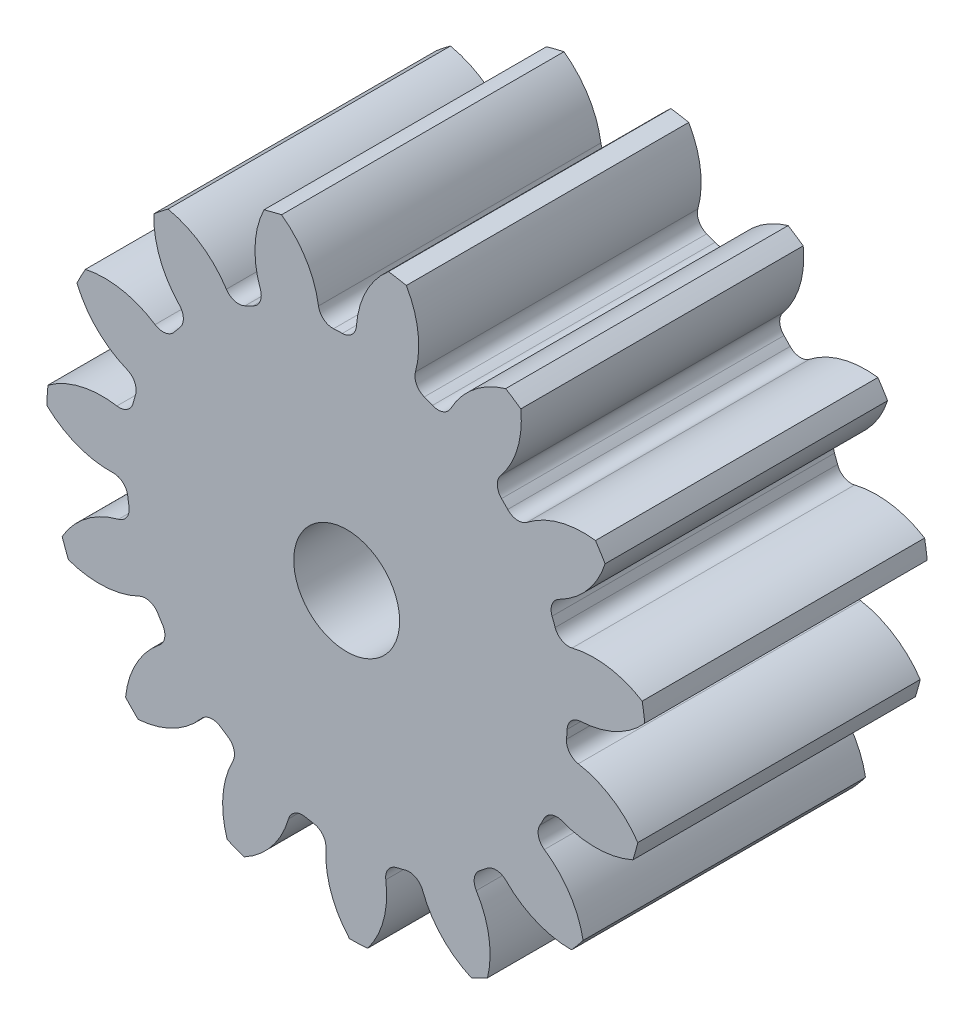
ISO-10303-21;
HEADER;
FILE_DESCRIPTION(('STEP AP214'),'2;1');
FILE_NAME('part.step','',(''),(''),'','','');
FILE_SCHEMA(('AUTOMOTIVE_DESIGN { 1 0 10303 214 1 1 1 1 }'));
ENDSEC;
DATA;
#1=APPLICATION_CONTEXT('core data for automotive mechanical design processes');
#2=APPLICATION_PROTOCOL_DEFINITION('international standard','automotive_design',2000,#1);
#3=PRODUCT_CONTEXT('',#1,'mechanical');
#4=PRODUCT('Part','Part','',(#3));
#5=PRODUCT_RELATED_PRODUCT_CATEGORY('part','',(#4));
#6=PRODUCT_DEFINITION_FORMATION('','',#4);
#7=PRODUCT_DEFINITION_CONTEXT('part definition',#1,'design');
#8=PRODUCT_DEFINITION('design','',#6,#7);
#9=PRODUCT_DEFINITION_SHAPE('','',#8);
#10=(LENGTH_UNIT() NAMED_UNIT(*) SI_UNIT(.MILLI.,.METRE.));
#11=(NAMED_UNIT(*) PLANE_ANGLE_UNIT() SI_UNIT($,.RADIAN.));
#12=(NAMED_UNIT(*) SI_UNIT($,.STERADIAN.) SOLID_ANGLE_UNIT());
#13=UNCERTAINTY_MEASURE_WITH_UNIT(LENGTH_MEASURE(1.E-05),#10,'distance_accuracy_value','');
#14=(GEOMETRIC_REPRESENTATION_CONTEXT(3) GLOBAL_UNCERTAINTY_ASSIGNED_CONTEXT((#13)) GLOBAL_UNIT_ASSIGNED_CONTEXT((#10,
#11,#12)) REPRESENTATION_CONTEXT('',''));
#15=CARTESIAN_POINT('',(0.,0.,0.));
#16=DIRECTION('',(0.,0.,1.));
#17=DIRECTION('',(1.,0.,0.));
#18=AXIS2_PLACEMENT_3D('',#15,#16,#17);
#19=CARTESIAN_POINT('',(0.,0.,101.6));
#20=DIRECTION('',(0.,0.,-1.));
#21=DIRECTION('',(-1.,0.,0.));
#22=AXIS2_PLACEMENT_3D('',#19,#20,#21);
#23=CYLINDRICAL_SURFACE('',#22,107.95);
#24=DIRECTION('',(0.,0.,-1.));
#25=VECTOR('',#24,1.);
#26=CARTESIAN_POINT('',(106.3119525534,18.7342265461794,50.8));
#27=LINE('',#26,#25);
#28=CARTESIAN_POINT('',(106.3119525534,18.7342265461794,101.6));
#29=VERTEX_POINT('',#28);
#30=CARTESIAN_POINT('',(106.3119525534,18.7342265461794,0.));
#31=VERTEX_POINT('',#30);
#32=EDGE_CURVE('E636',#29,#31,#27,.T.);
#33=ORIENTED_EDGE('',*,*,#32,.F.);
#34=CARTESIAN_POINT('',(0.,0.,101.6));
#35=DIRECTION('',(0.,0.,1.));
#36=DIRECTION('',(1.,0.,0.));
#37=AXIS2_PLACEMENT_3D('',#34,#35,#36);
#38=CIRCLE('',#37,107.95);
#39=CARTESIAN_POINT('',(107.24839433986,12.2875714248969,101.6));
#40=VERTEX_POINT('',#39);
#41=EDGE_CURVE('E1167',#40,#29,#38,.T.);
#42=ORIENTED_EDGE('',*,*,#41,.F.);
#43=DIRECTION('',(0.,0.,-1.));
#44=VECTOR('',#43,1.);
#45=CARTESIAN_POINT('',(107.24839433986,12.2875714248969,50.8));
#46=LINE('',#45,#44);
#47=CARTESIAN_POINT('',(107.24839433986,12.2875714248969,0.));
#48=VERTEX_POINT('',#47);
#49=EDGE_CURVE('E1161',#48,#40,#46,.F.);
#50=ORIENTED_EDGE('',*,*,#49,.F.);
#51=CARTESIAN_POINT('',(0.,0.,0.));
#52=DIRECTION('',(0.,0.,1.));
#53=DIRECTION('',(1.,0.,0.));
#54=AXIS2_PLACEMENT_3D('',#51,#52,#53);
#55=CIRCLE('',#54,107.95);
#56=EDGE_CURVE('E1172',#48,#31,#55,.T.);
#57=ORIENTED_EDGE('',*,*,#56,.T.);
#58=EDGE_LOOP('',(#33,#42,#50,#57));
#59=FACE_BOUND('',#58,.T.);
#60=ADVANCED_FACE('F33',(#59),#23,.T.);
#61=DIRECTION('',(0.,0.,-1.));
#62=VECTOR('',#61,1.);
#63=CARTESIAN_POINT('',(92.9784779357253,54.8471069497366,50.8));
#64=LINE('',#63,#62);
#65=CARTESIAN_POINT('',(92.9784779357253,54.8471069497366,0.));
#66=VERTEX_POINT('',#65);
#67=CARTESIAN_POINT('',(92.9784779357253,54.8471069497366,101.6));
#68=VERTEX_POINT('',#67);
#69=EDGE_CURVE('E607',#66,#68,#64,.F.);
#70=ORIENTED_EDGE('',*,*,#69,.F.);
#71=CARTESIAN_POINT('',(89.5009049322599,60.3555342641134,0.));
#72=VERTEX_POINT('',#71);
#73=EDGE_CURVE('E1175',#66,#72,#55,.T.);
#74=ORIENTED_EDGE('',*,*,#73,.T.);
#75=DIRECTION('',(0.,0.,-1.));
#76=VECTOR('',#75,1.);
#77=CARTESIAN_POINT('',(89.5009049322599,60.3555342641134,50.8));
#78=LINE('',#77,#76);
#79=CARTESIAN_POINT('',(89.5009049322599,60.3555342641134,101.6));
#80=VERTEX_POINT('',#79);
#81=EDGE_CURVE('E669',#80,#72,#78,.T.);
#82=ORIENTED_EDGE('',*,*,#81,.F.);
#83=EDGE_CURVE('E1170',#68,#80,#38,.T.);
#84=ORIENTED_EDGE('',*,*,#83,.F.);
#85=EDGE_LOOP('',(#70,#74,#82,#84));
#86=FACE_BOUND('',#85,.T.);
#87=ADVANCED_FACE('F1346',(#86),#23,.T.);
#88=CARTESIAN_POINT('',(0.,0.,101.6));
#89=DIRECTION('',(0.,0.,1.));
#90=DIRECTION('',(1.,0.,0.));
#91=AXIS2_PLACEMENT_3D('',#88,#89,#90);
#92=PLANE('',#91);
#93=CARTESIAN_POINT('',(0.,0.,101.599999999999));
#94=DIRECTION('',(0.,0.,1.));
#95=DIRECTION('',(1.,0.,0.));
#96=AXIS2_PLACEMENT_3D('',#93,#94,#95);
#97=CIRCLE('',#96,19.05);
#98=CARTESIAN_POINT('',(19.05,0.,101.599999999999));
#99=VERTEX_POINT('',#98);
#100=EDGE_CURVE('E624',#99,#99,#97,.T.);
#101=ORIENTED_EDGE('',*,*,#100,.F.);
#102=EDGE_LOOP('',(#101));
#103=FACE_BOUND('',#102,.T.);
#104=ORIENTED_EDGE('',*,*,#41,.T.);
#105=CARTESIAN_POINT('',(89.0202813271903,-9.30933974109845,101.6));
#106=DIRECTION('',(0.,0.,-1.));
#107=DIRECTION('',(0.913545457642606,0.406736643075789,0.));
#108=AXIS2_PLACEMENT_3D('',#105,#106,#107);
#109=CIRCLE('',#108,32.9460696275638);
#110=CARTESIAN_POINT('',(81.1191939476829,22.6752865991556,101.6));
#111=VERTEX_POINT('',#110);
#112=EDGE_CURVE('E616',#111,#29,#109,.T.);
#113=ORIENTED_EDGE('',*,*,#112,.F.);
#114=CARTESIAN_POINT('',(79.8795944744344,27.6933460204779,101.6));
#115=DIRECTION('',(0.,0.,1.));
#116=DIRECTION('',(-0.913545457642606,-0.406736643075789,0.));
#117=AXIS2_PLACEMENT_3D('',#114,#115,#116);
#118=CIRCLE('',#117,5.16889999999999);
#119=CARTESIAN_POINT('',(74.9958638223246,26.0002122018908,101.6));
#120=VERTEX_POINT('',#119);
#121=EDGE_CURVE('E614',#120,#111,#118,.T.);
#122=ORIENTED_EDGE('',*,*,#121,.F.);
#123=CARTESIAN_POINT('',(0.,0.,101.6));
#124=DIRECTION('',(0.,0.,-1.));
#125=DIRECTION('',(0.913545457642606,0.406736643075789,0.));
#126=AXIS2_PLACEMENT_3D('',#123,#124,#125);
#127=CIRCLE('',#126,79.375);
#128=CARTESIAN_POINT('',(73.8979463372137,28.9738529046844,101.6));
#129=VERTEX_POINT('',#128);
#130=EDGE_CURVE('E599',#129,#120,#127,.T.);
#131=ORIENTED_EDGE('',*,*,#130,.F.);
#132=CARTESIAN_POINT('',(78.710180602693,30.8606302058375,101.6));
#133=DIRECTION('',(0.,0.,1.));
#134=DIRECTION('',(-0.913545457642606,-0.406736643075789,0.));
#135=AXIS2_PLACEMENT_3D('',#132,#133,#134);
#136=CIRCLE('',#135,5.16889999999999);
#137=CARTESIAN_POINT('',(76.3913942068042,35.4802359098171,101.6));
#138=VERTEX_POINT('',#137);
#139=EDGE_CURVE('E591',#138,#129,#136,.T.);
#140=ORIENTED_EDGE('',*,*,#139,.F.);
#141=CARTESIAN_POINT('',(61.6116735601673,64.9251567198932,101.6));
#142=DIRECTION('',(0.,0.,-1.));
#143=DIRECTION('',(-0.913545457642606,-0.406736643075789,0.));
#144=AXIS2_PLACEMENT_3D('',#141,#142,#143);
#145=CIRCLE('',#144,32.9460696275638);
#146=EDGE_CURVE('E621',#68,#138,#145,.T.);
#147=ORIENTED_EDGE('',*,*,#146,.F.);
#148=ORIENTED_EDGE('',*,*,#83,.T.);
#149=CARTESIAN_POINT('',(85.1105232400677,27.7033053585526,101.6));
#150=DIRECTION('',(0.,0.,-1.));
#151=DIRECTION('',(0.669130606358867,0.743144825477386,0.));
#152=AXIS2_PLACEMENT_3D('',#149,#150,#151);
#153=CIRCLE('',#152,32.9460696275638);
#154=CARTESIAN_POINT('',(64.8832012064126,53.709053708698,101.6));
#155=VERTEX_POINT('',#154);
#156=EDGE_CURVE('E645',#155,#80,#153,.T.);
#157=ORIENTED_EDGE('',*,*,#156,.F.);
#158=CARTESIAN_POINT('',(61.7097420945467,57.7890885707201,101.6));
#159=DIRECTION('',(0.,0.,1.));
#160=DIRECTION('',(-0.669130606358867,-0.743144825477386,0.));
#161=AXIS2_PLACEMENT_3D('',#158,#159,#160);
#162=CIRCLE('',#161,5.16889999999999);
#163=CARTESIAN_POINT('',(57.9368917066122,54.2559416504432,101.6));
#164=VERTEX_POINT('',#163);
#165=EDGE_CURVE('E643',#164,#155,#162,.T.);
#166=ORIENTED_EDGE('',*,*,#165,.F.);
#167=CARTESIAN_POINT('',(0.,0.,101.6));
#168=DIRECTION('',(0.,0.,-1.));
#169=DIRECTION('',(0.669130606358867,0.743144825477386,0.));
#170=AXIS2_PLACEMENT_3D('',#167,#168,#169);
#171=CIRCLE('',#170,79.375);
#172=CARTESIAN_POINT('',(55.7244055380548,56.5259343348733,101.6));
#173=VERTEX_POINT('',#172);
#174=EDGE_CURVE('E640',#173,#164,#171,.T.);
#175=ORIENTED_EDGE('',*,*,#174,.F.);
#176=CARTESIAN_POINT('',(59.3531788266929,60.2069031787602,101.6));
#177=DIRECTION('',(0.,0.,1.));
#178=DIRECTION('',(-0.669130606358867,-0.743144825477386,0.));
#179=AXIS2_PLACEMENT_3D('',#176,#177,#178);
#180=CIRCLE('',#179,5.16889999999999);
#181=CARTESIAN_POINT('',(55.3558991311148,63.483987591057,101.6));
#182=VERTEX_POINT('',#181);
#183=EDGE_CURVE('E638',#182,#173,#180,.T.);
#184=ORIENTED_EDGE('',*,*,#183,.F.);
#185=CARTESIAN_POINT('',(29.8776242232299,84.3718072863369,101.6));
#186=DIRECTION('',(0.,0.,-1.));
#187=DIRECTION('',(-0.669130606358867,-0.743144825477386,0.));
#188=AXIS2_PLACEMENT_3D('',#185,#186,#187);
#189=CIRCLE('',#188,32.9460696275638);
#190=CARTESIAN_POINT('',(62.6317380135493,87.9230794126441,101.6));
#191=VERTEX_POINT('',#190);
#192=EDGE_CURVE('E648',#191,#182,#189,.T.);
#193=ORIENTED_EDGE('',*,*,#192,.F.);
#194=CARTESIAN_POINT('',(57.2143377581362,91.540821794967,101.6));
#195=VERTEX_POINT('',#194);
#196=EDGE_CURVE('E1213',#191,#195,#38,.T.);
#197=ORIENTED_EDGE('',*,*,#196,.T.);
#198=CARTESIAN_POINT('',(66.4843824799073,59.9257972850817,101.6));
#199=DIRECTION('',(0.,0.,-1.));
#200=DIRECTION('',(0.309016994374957,0.95105651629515,0.));
#201=AXIS2_PLACEMENT_3D('',#198,#199,#200);
#202=CIRCLE('',#201,32.9460696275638);
#203=CARTESIAN_POINT('',(37.4283135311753,75.4560375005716,101.6));
#204=VERTEX_POINT('',#203);
#205=EDGE_CURVE('E680',#204,#195,#202,.T.);
#206=ORIENTED_EDGE('',*,*,#205,.F.);
#207=CARTESIAN_POINT('',(32.8697146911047,77.8925727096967,101.6));
#208=DIRECTION('',(0.,0.,1.));
#209=DIRECTION('',(-0.309016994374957,-0.95105651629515,0.));
#210=AXIS2_PLACEMENT_3D('',#207,#208,#209);
#211=CIRCLE('',#210,5.16889999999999);
#212=CARTESIAN_POINT('',(30.8601046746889,73.130325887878,101.6));
#213=VERTEX_POINT('',#212);
#214=EDGE_CURVE('E678',#213,#204,#211,.T.);
#215=ORIENTED_EDGE('',*,*,#214,.F.);
#216=CARTESIAN_POINT('',(0.,0.,101.6));
#217=DIRECTION('',(0.,0.,-1.));
#218=DIRECTION('',(0.309016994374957,0.95105651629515,0.));
#219=AXIS2_PLACEMENT_3D('',#216,#217,#218);
#220=CIRCLE('',#219,79.375);
#221=CARTESIAN_POINT('',(27.9156087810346,74.3041681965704,101.6));
#222=VERTEX_POINT('',#221);
#223=EDGE_CURVE('E675',#222,#213,#220,.T.);
#224=ORIENTED_EDGE('',*,*,#223,.F.);
#225=CARTESIAN_POINT('',(29.7334732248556,79.1428556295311,101.6));
#226=DIRECTION('',(0.,0.,1.));
#227=DIRECTION('',(-0.309016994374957,-0.95105651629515,0.));
#228=AXIS2_PLACEMENT_3D('',#225,#226,#227);
#229=CIRCLE('',#228,5.16889999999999);
#230=CARTESIAN_POINT('',(24.7488662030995,80.5107810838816,101.6));
#231=VERTEX_POINT('',#230);
#232=EDGE_CURVE('E673',#231,#222,#229,.T.);
#233=ORIENTED_EDGE('',*,*,#232,.F.);
#234=CARTESIAN_POINT('',(-7.02253777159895,89.2298058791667,101.6));
#235=DIRECTION('',(0.,0.,-1.));
#236=DIRECTION('',(-0.309016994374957,-0.95105651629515,0.));
#237=AXIS2_PLACEMENT_3D('',#234,#235,#236);
#238=CIRCLE('',#237,32.9460696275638);
#239=CARTESIAN_POINT('',(21.4554015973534,105.796352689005,101.6));
#240=VERTEX_POINT('',#239);
#241=EDGE_CURVE('E683',#240,#231,#238,.T.);
#242=ORIENTED_EDGE('',*,*,#241,.F.);
#243=CARTESIAN_POINT('',(15.0348918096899,106.897869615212,101.6));
#244=VERTEX_POINT('',#243);
#245=EDGE_CURVE('E1328',#240,#244,#38,.T.);
#246=ORIENTED_EDGE('',*,*,#245,.T.);
#247=CARTESIAN_POINT('',(36.3624879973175,81.7865744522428,101.6));
#248=DIRECTION('',(0.,0.,-1.));
#249=DIRECTION('',(-0.104528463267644,0.994521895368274,0.));
#250=AXIS2_PLACEMENT_3D('',#247,#248,#249);
#251=CIRCLE('',#250,32.9460696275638);
#252=CARTESIAN_POINT('',(3.5017304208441,84.1559869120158,101.6));
#253=VERTEX_POINT('',#252);
#254=EDGE_CURVE('E718',#253,#244,#251,.T.);
#255=ORIENTED_EDGE('',*,*,#254,.F.);
#256=CARTESIAN_POINT('',(-1.65378499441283,84.5277233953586,101.6));
#257=DIRECTION('',(0.,0.,1.));
#258=DIRECTION('',(0.104528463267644,-0.994521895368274,0.));
#259=AXIS2_PLACEMENT_3D('',#256,#257,#258);
#260=CIRCLE('',#259,5.16889999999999);
#261=CARTESIAN_POINT('',(-1.55267481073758,79.3598124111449,101.6));
#262=VERTEX_POINT('',#261);
#263=EDGE_CURVE('E716',#262,#253,#260,.T.);
#264=ORIENTED_EDGE('',*,*,#263,.F.);
#265=CARTESIAN_POINT('',(0.,0.,101.6));
#266=DIRECTION('',(0.,0.,-1.));
#267=DIRECTION('',(-0.104528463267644,0.994521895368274,0.));
#268=AXIS2_PLACEMENT_3D('',#265,#266,#267);
#269=CIRCLE('',#268,79.375);
#270=CARTESIAN_POINT('',(-4.72005033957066,79.2345363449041,101.6));
#271=VERTEX_POINT('',#270);
#272=EDGE_CURVE('E713',#271,#262,#269,.T.);
#273=ORIENTED_EDGE('',*,*,#272,.F.);
#274=CARTESIAN_POINT('',(-5.02742001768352,84.3942893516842,101.6));
#275=DIRECTION('',(0.,0.,1.));
#276=DIRECTION('',(0.104528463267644,-0.994521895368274,0.));
#277=AXIS2_PLACEMENT_3D('',#274,#275,#276);
#278=CIRCLE('',#277,5.16889999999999);
#279=CARTESIAN_POINT('',(-10.1374705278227,83.6165291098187,101.6));
#280=VERTEX_POINT('',#279);
#281=EDGE_CURVE('E711',#280,#271,#278,.T.);
#282=ORIENTED_EDGE('',*,*,#281,.F.);
#283=CARTESIAN_POINT('',(-42.7084391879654,78.6591604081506,101.6));
#284=DIRECTION('',(0.,0.,-1.));
#285=DIRECTION('',(0.104528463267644,-0.994521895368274,0.));
#286=AXIS2_PLACEMENT_3D('',#283,#284,#285);
#287=CIRCLE('',#286,32.9460696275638);
#288=CARTESIAN_POINT('',(-23.4307686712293,105.376475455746,101.6));
#289=VERTEX_POINT('',#288);
#290=EDGE_CURVE('E721',#289,#280,#287,.T.);
#291=ORIENTED_EDGE('',*,*,#290,.F.);
#292=CARTESIAN_POINT('',(-29.7442235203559,103.771304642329,101.6));
#293=VERTEX_POINT('',#292);
#294=EDGE_CURVE('E1324',#289,#293,#38,.T.);
#295=ORIENTED_EDGE('',*,*,#294,.T.);
#296=CARTESIAN_POINT('',(-0.0468110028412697,89.5057098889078,101.6));
#297=DIRECTION('',(0.,0.,-1.));
#298=DIRECTION('',(-0.499999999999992,0.866025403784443,0.));
#299=AXIS2_PLACEMENT_3D('',#296,#297,#298);
#300=CIRCLE('',#299,32.9460696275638);
#301=CARTESIAN_POINT('',(-31.0303336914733,78.3046016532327,101.6));
#302=VERTEX_POINT('',#301);
#303=EDGE_CURVE('E756',#302,#293,#300,.T.);
#304=ORIENTED_EDGE('',*,*,#303,.F.);
#305=CARTESIAN_POINT('',(-35.8913302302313,76.5472627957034,101.6));
#306=DIRECTION('',(0.,0.,1.));
#307=DIRECTION('',(0.499999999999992,-0.866025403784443,0.));
#308=AXIS2_PLACEMENT_3D('',#305,#306,#307);
#309=CIRCLE('',#308,5.16889999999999);
#310=CARTESIAN_POINT('',(-33.6969827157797,71.8672664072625,101.6));
#311=VERTEX_POINT('',#310);
#312=EDGE_CURVE('E754',#311,#302,#309,.T.);
#313=ORIENTED_EDGE('',*,*,#312,.F.);
#314=CARTESIAN_POINT('',(0.,0.,101.6));
#315=DIRECTION('',(0.,0.,-1.));
#316=DIRECTION('',(-0.499999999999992,0.866025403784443,0.));
#317=AXIS2_PLACEMENT_3D('',#314,#315,#316);
#318=CIRCLE('',#317,79.375);
#319=CARTESIAN_POINT('',(-36.539569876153,70.4645333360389,101.6));
#320=VERTEX_POINT('',#319);
#321=EDGE_CURVE('E751',#320,#311,#318,.T.);
#322=ORIENTED_EDGE('',*,*,#321,.F.);
#323=CARTESIAN_POINT('',(-38.9190266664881,75.0531837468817,101.6));
#324=DIRECTION('',(0.,0.,1.));
#325=DIRECTION('',(0.499999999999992,-0.866025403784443,0.));
#326=AXIS2_PLACEMENT_3D('',#323,#324,#325);
#327=CIRCLE('',#326,5.16889999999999);
#328=CARTESIAN_POINT('',(-43.2709465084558,72.2642196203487,101.6));
#329=VERTEX_POINT('',#328);
#330=EDGE_CURVE('E749',#329,#320,#327,.T.);
#331=ORIENTED_EDGE('',*,*,#330,.F.);
#332=CARTESIAN_POINT('',(-71.0096634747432,54.4876315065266,101.6));
#333=DIRECTION('',(0.,0.,-1.));
#334=DIRECTION('',(0.499999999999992,-0.866025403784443,0.));
#335=AXIS2_PLACEMENT_3D('',#332,#333,#334);
#336=CIRCLE('',#335,32.9460696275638);
#337=CARTESIAN_POINT('',(-64.2655461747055,86.7360483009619,101.6));
#338=VERTEX_POINT('',#337);
#339=EDGE_CURVE('E759',#338,#329,#336,.T.);
#340=ORIENTED_EDGE('',*,*,#339,.F.);
#341=CARTESIAN_POINT('',(-69.3802923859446,82.7017383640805,101.6));
#342=VERTEX_POINT('',#341);
#343=EDGE_CURVE('E1320',#338,#342,#38,.T.);
#344=ORIENTED_EDGE('',*,*,#343,.T.);
#345=CARTESIAN_POINT('',(-36.4480159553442,81.7484949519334,101.6));
#346=DIRECTION('',(0.,0.,-1.));
#347=DIRECTION('',(-0.809016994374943,0.58778525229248,0.));
#348=AXIS2_PLACEMENT_3D('',#345,#346,#347);
#349=CIRCLE('',#348,32.9460696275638);
#350=CARTESIAN_POINT('',(-60.1969712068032,58.9136393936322,101.6));
#351=VERTEX_POINT('',#350);
#352=EDGE_CURVE('E794',#351,#342,#349,.T.);
#353=ORIENTED_EDGE('',*,*,#352,.F.);
#354=CARTESIAN_POINT('',(-63.922938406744,55.33108504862,101.6));
#355=DIRECTION('',(0.,0.,1.));
#356=DIRECTION('',(0.809016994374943,-0.58778525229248,0.));
#357=AXIS2_PLACEMENT_3D('',#354,#355,#356);
#358=CIRCLE('',#357,5.16889999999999);
#359=CARTESIAN_POINT('',(-60.0147761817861,51.9482171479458,101.6));
#360=VERTEX_POINT('',#359);
#361=EDGE_CURVE('E792',#360,#351,#358,.T.);
#362=ORIENTED_EDGE('',*,*,#361,.F.);
#363=CARTESIAN_POINT('',(0.,0.,101.6));
#364=DIRECTION('',(0.,0.,-1.));
#365=DIRECTION('',(-0.809016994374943,0.58778525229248,0.));
#366=AXIS2_PLACEMENT_3D('',#363,#364,#365);
#367=CIRCLE('',#366,79.375);
#368=CARTESIAN_POINT('',(-62.0410658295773,49.5105723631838,101.6));
#369=VERTEX_POINT('',#368);
#370=EDGE_CURVE('E789',#369,#360,#367,.T.);
#371=ORIENTED_EDGE('',*,*,#370,.F.);
#372=CARTESIAN_POINT('',(-66.0811800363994,52.7347008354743,101.6));
#373=DIRECTION('',(0.,0.,1.));
#374=DIRECTION('',(0.809016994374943,-0.58778525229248,0.));
#375=AXIS2_PLACEMENT_3D('',#372,#373,#374);
#376=CIRCLE('',#375,5.16889999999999);
#377=CARTESIAN_POINT('',(-68.9224827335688,48.416770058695,101.6));
#378=VERTEX_POINT('',#377);
#379=EDGE_CURVE('E787',#378,#369,#376,.T.);
#380=ORIENTED_EDGE('',*,*,#379,.F.);
#381=CARTESIAN_POINT('',(-87.0326718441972,20.8946961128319,101.6));
#382=DIRECTION('',(0.,0.,-1.));
#383=DIRECTION('',(0.809016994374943,-0.58778525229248,0.));
#384=AXIS2_PLACEMENT_3D('',#381,#382,#383);
#385=CIRCLE('',#384,32.9460696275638);
#386=CARTESIAN_POINT('',(-93.9882269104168,53.0981704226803,101.6));
#387=VERTEX_POINT('',#386);
#388=EDGE_CURVE('E797',#387,#378,#385,.T.);
#389=ORIENTED_EDGE('',*,*,#388,.F.);
#390=CARTESIAN_POINT('',(-97.0198783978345,47.3322902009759,101.6));
#391=VERTEX_POINT('',#390);
#392=EDGE_CURVE('E1316',#387,#391,#38,.T.);
#393=ORIENTED_EDGE('',*,*,#392,.T.);
#394=CARTESIAN_POINT('',(-66.5470278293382,59.8562225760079,101.6));
#395=DIRECTION('',(0.,0.,-1.));
#396=DIRECTION('',(-0.978147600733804,0.207911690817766,0.));
#397=AXIS2_PLACEMENT_3D('',#394,#395,#396);
#398=CIRCLE('',#397,32.9460696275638);
#399=CARTESIAN_POINT('',(-78.9550055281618,29.3359736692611,101.6));
#400=VERTEX_POINT('',#399);
#401=EDGE_CURVE('E832',#400,#391,#398,.T.);
#402=ORIENTED_EDGE('',*,*,#401,.F.);
#403=CARTESIAN_POINT('',(-80.901689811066,24.547660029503,101.6));
#404=DIRECTION('',(0.,0.,1.));
#405=DIRECTION('',(0.978147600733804,-0.207911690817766,0.));
#406=AXIS2_PLACEMENT_3D('',#403,#404,#405);
#407=CIRCLE('',#406,5.16889999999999);
#408=CARTESIAN_POINT('',(-75.9554696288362,23.0468492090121,101.6));
#409=VERTEX_POINT('',#408);
#410=EDGE_CURVE('E830',#409,#400,#407,.T.);
#411=ORIENTED_EDGE('',*,*,#410,.F.);
#412=CARTESIAN_POINT('',(0.,0.,101.6));
#413=DIRECTION('',(0.,0.,-1.));
#414=DIRECTION('',(-0.978147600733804,0.207911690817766,0.));
#415=AXIS2_PLACEMENT_3D('',#412,#413,#414);
#416=CIRCLE('',#415,79.375);
#417=CARTESIAN_POINT('',(-76.8150978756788,19.9957836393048,101.6));
#418=VERTEX_POINT('',#417);
#419=EDGE_CURVE('E827',#418,#409,#416,.T.);
#420=ORIENTED_EDGE('',*,*,#419,.F.);
#421=CARTESIAN_POINT('',(-81.817297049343,21.2979090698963,101.6));
#422=DIRECTION('',(0.,0.,1.));
#423=DIRECTION('',(0.978147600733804,-0.207911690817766,0.));
#424=AXIS2_PLACEMENT_3D('',#421,#422,#423);
#425=CIRCLE('',#424,5.16889999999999);
#426=CARTESIAN_POINT('',(-82.6566955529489,16.1976211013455,101.6));
#427=VERTEX_POINT('',#426);
#428=EDGE_CURVE('E825',#427,#418,#425,.T.);
#429=ORIENTED_EDGE('',*,*,#428,.F.);
#430=CARTESIAN_POINT('',(-88.0069405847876,-16.3111220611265,101.6));
#431=DIRECTION('',(0.,0.,-1.));
#432=DIRECTION('',(0.978147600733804,-0.207911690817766,0.));
#433=AXIS2_PLACEMENT_3D('',#430,#431,#432);
#434=CIRCLE('',#433,32.9460696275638);
#435=CARTESIAN_POINT('',(-107.459489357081,10.2791364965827,101.6));
#436=VERTEX_POINT('',#435);
#437=EDGE_CURVE('E835',#436,#427,#434,.T.);
#438=ORIENTED_EDGE('',*,*,#437,.F.);
#439=CARTESIAN_POINT('',(-107.883846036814,3.77865906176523,101.6));
#440=VERTEX_POINT('',#439);
#441=EDGE_CURVE('E1312',#436,#440,#38,.T.);
#442=ORIENTED_EDGE('',*,*,#441,.T.);
#443=CARTESIAN_POINT('',(-85.1394540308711,27.6142655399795,101.6));
#444=DIRECTION('',(0.,0.,-1.));
#445=DIRECTION('',(-0.978147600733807,-0.207911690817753,0.));
#446=AXIS2_PLACEMENT_3D('',#443,#444,#445);
#447=CIRCLE('',#446,32.9460696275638);
#448=CARTESIAN_POINT('',(-84.0610021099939,-5.31414841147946,101.6));
#449=VERTEX_POINT('',#448);
#450=EDGE_CURVE('E870',#449,#440,#447,.T.);
#451=ORIENTED_EDGE('',*,*,#450,.F.);
#452=CARTESIAN_POINT('',(-83.8918040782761,-10.4802784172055,101.6));
#453=DIRECTION('',(0.,0.,1.));
#454=DIRECTION('',(0.978147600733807,0.207911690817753,0.));
#455=AXIS2_PLACEMENT_3D('',#452,#453,#454);
#456=CIRCLE('',#455,5.16889999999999);
#457=CARTESIAN_POINT('',(-78.7627723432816,-9.83952833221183,101.6));
#458=VERTEX_POINT('',#457);
#459=EDGE_CURVE('E868',#458,#449,#456,.T.);
#460=ORIENTED_EDGE('',*,*,#459,.F.);
#461=CARTESIAN_POINT('',(0.,0.,101.6));
#462=DIRECTION('',(0.,0.,-1.));
#463=DIRECTION('',(-0.978147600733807,-0.207911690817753,0.));
#464=AXIS2_PLACEMENT_3D('',#461,#462,#463);
#465=CIRCLE('',#464,79.375);
#466=CARTESIAN_POINT('',(-78.307101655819,-12.9764577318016,101.6));
#467=VERTEX_POINT('',#466);
#468=EDGE_CURVE('E865',#467,#458,#465,.T.);
#469=ORIENTED_EDGE('',*,*,#468,.F.);
#470=CARTESIAN_POINT('',(-83.4064601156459,-13.8214846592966,101.6));
#471=DIRECTION('',(0.,0.,1.));
#472=DIRECTION('',(0.978147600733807,0.207911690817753,0.));
#473=AXIS2_PLACEMENT_3D('',#470,#471,#472);
#474=CIRCLE('',#473,5.16889999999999);
#475=CARTESIAN_POINT('',(-82.0988147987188,-18.8222436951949,101.6));
#476=VERTEX_POINT('',#475);
#477=EDGE_CURVE('E863',#476,#467,#474,.T.);
#478=ORIENTED_EDGE('',*,*,#477,.F.);
#479=CARTESIAN_POINT('',(-73.7640097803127,-50.6965990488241,101.6));
#480=DIRECTION('',(0.,0.,-1.));
#481=DIRECTION('',(0.978147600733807,0.207911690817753,0.));
#482=AXIS2_PLACEMENT_3D('',#479,#480,#481);
#483=CIRCLE('',#482,32.9460696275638);
#484=CARTESIAN_POINT('',(-102.350029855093,-34.3172535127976,101.6));
#485=VERTEX_POINT('',#484);
#486=EDGE_CURVE('E873',#485,#476,#483,.T.);
#487=ORIENTED_EDGE('',*,*,#486,.F.);
#488=CARTESIAN_POINT('',(-100.093716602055,-40.4283365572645,101.6));
#489=VERTEX_POINT('',#488);
#490=EDGE_CURVE('E1308',#485,#489,#38,.T.);
#491=ORIENTED_EDGE('',*,*,#490,.T.);
#492=CARTESIAN_POINT('',(-89.0104951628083,-9.40244887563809,101.6));
#493=DIRECTION('',(0.,0.,-1.));
#494=DIRECTION('',(-0.80901699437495,-0.587785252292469,0.));
#495=AXIS2_PLACEMENT_3D('',#492,#493,#494);
#496=CIRCLE('',#495,32.9460696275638);
#497=CARTESIAN_POINT('',(-74.6320877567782,-39.0454059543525,101.6));
#498=VERTEX_POINT('',#497);
#499=EDGE_CURVE('E908',#498,#489,#496,.T.);
#500=ORIENTED_EDGE('',*,*,#499,.F.);
#501=CARTESIAN_POINT('',(-72.3762632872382,-43.6960815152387,101.6));
#502=DIRECTION('',(0.,0.,1.));
#503=DIRECTION('',(0.80901699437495,0.587785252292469,0.));
#504=AXIS2_PLACEMENT_3D('',#501,#502,#503);
#505=CIRCLE('',#504,5.16889999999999);
#506=CARTESIAN_POINT('',(-67.9512761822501,-41.0245620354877,101.6));
#507=VERTEX_POINT('',#506);
#508=EDGE_CURVE('E906',#507,#498,#505,.T.);
#509=ORIENTED_EDGE('',*,*,#508,.F.);
#510=CARTESIAN_POINT('',(0.,0.,101.6));
#511=DIRECTION('',(0.,0.,-1.));
#512=DIRECTION('',(-0.80901699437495,-0.587785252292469,0.));
#513=AXIS2_PLACEMENT_3D('',#510,#511,#512);
#514=CIRCLE('',#513,79.375);
#515=CARTESIAN_POINT('',(-66.2590961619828,-43.7049516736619,101.6));
#516=VERTEX_POINT('',#515);
#517=EDGE_CURVE('E903',#516,#507,#514,.T.);
#518=ORIENTED_EDGE('',*,*,#517,.F.);
#519=CARTESIAN_POINT('',(-70.5738885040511,-46.5510181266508,101.6));
#520=DIRECTION('',(0.,0.,1.));
#521=DIRECTION('',(0.80901699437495,0.587785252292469,0.));
#522=AXIS2_PLACEMENT_3D('',#519,#520,#521);
#523=CIRCLE('',#522,5.16889999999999);
#524=CARTESIAN_POINT('',(-67.3453031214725,-50.5875715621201,101.6));
#525=VERTEX_POINT('',#524);
#526=EDGE_CURVE('E901',#525,#516,#523,.T.);
#527=ORIENTED_EDGE('',*,*,#526,.F.);
#528=CARTESIAN_POINT('',(-46.7666115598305,-76.3161734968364,101.6));
#529=DIRECTION('',(0.,0.,-1.));
#530=DIRECTION('',(0.80901699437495,0.587785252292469,0.));
#531=AXIS2_PLACEMENT_3D('',#528,#529,#530);
#532=CIRCLE('',#531,32.9460696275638);
#533=CARTESIAN_POINT('',(-79.543320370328,-72.9798786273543,101.6));
#534=VERTEX_POINT('',#533);
#535=EDGE_CURVE('E911',#534,#525,#532,.T.);
#536=ORIENTED_EDGE('',*,*,#535,.F.);
#537=CARTESIAN_POINT('',(-74.9964742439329,-77.6449055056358,101.6));
#538=VERTEX_POINT('',#537);
#539=EDGE_CURVE('E1304',#534,#538,#38,.T.);
#540=ORIENTED_EDGE('',*,*,#539,.T.);
#541=CARTESIAN_POINT('',(-77.4908130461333,-44.7933944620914,101.6));
#542=DIRECTION('',(0.,0.,-1.));
#543=DIRECTION('',(-0.500000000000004,-0.866025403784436,0.));
#544=AXIS2_PLACEMENT_3D('',#541,#542,#543);
#545=CIRCLE('',#544,32.9460696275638);
#546=CARTESIAN_POINT('',(-52.2986074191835,-66.0253580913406,101.6));
#547=VERTEX_POINT('',#546);
#548=EDGE_CURVE('E946',#547,#538,#545,.T.);
#549=ORIENTED_EDGE('',*,*,#548,.F.);
#550=CARTESIAN_POINT('',(-48.3462090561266,-69.3564351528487,101.6));
#551=DIRECTION('',(0.,0.,1.));
#552=DIRECTION('',(0.500000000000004,0.866025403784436,0.));
#553=AXIS2_PLACEMENT_3D('',#550,#551,#552);
#554=CIRCLE('',#553,5.16889999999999);
#555=CARTESIAN_POINT('',(-45.3903870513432,-65.1160762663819,101.6));
#556=VERTEX_POINT('',#555);
#557=EDGE_CURVE('E944',#556,#547,#554,.T.);
#558=ORIENTED_EDGE('',*,*,#557,.F.);
#559=CARTESIAN_POINT('',(0.,0.,101.6));
#560=DIRECTION('',(0.,0.,-1.));
#561=DIRECTION('',(-0.500000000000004,-0.866025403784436,0.));
#562=AXIS2_PLACEMENT_3D('',#559,#560,#561);
#563=CIRCLE('',#562,79.375);
#564=CARTESIAN_POINT('',(-42.7542909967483,-66.8764624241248,101.6));
#565=VERTEX_POINT('',#564);
#566=EDGE_CURVE('E941',#565,#556,#563,.T.);
#567=ORIENTED_EDGE('',*,*,#566,.F.);
#568=CARTESIAN_POINT('',(-45.5384504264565,-71.2314576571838,101.6));
#569=DIRECTION('',(0.,0.,1.));
#570=DIRECTION('',(0.500000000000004,0.866025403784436,0.));
#571=AXIS2_PLACEMENT_3D('',#568,#569,#570);
#572=CIRCLE('',#571,5.16889999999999);
#573=CARTESIAN_POINT('',(-40.9471767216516,-73.6058487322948,101.6));
#574=VERTEX_POINT('',#573);
#575=EDGE_CURVE('E939',#574,#565,#572,.T.);
#576=ORIENTED_EDGE('',*,*,#575,.F.);
#577=CARTESIAN_POINT('',(-11.6828413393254,-88.7399882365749,101.6));
#578=DIRECTION('',(0.,0.,-1.));
#579=DIRECTION('',(0.500000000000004,0.866025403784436,0.));
#580=AXIS2_PLACEMENT_3D('',#577,#578,#579);
#581=CIRCLE('',#580,32.9460696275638);
#582=CARTESIAN_POINT('',(-42.9828481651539,-99.0236197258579,101.6));
#583=VERTEX_POINT('',#582);
#584=EDGE_CURVE('E949',#583,#574,#581,.T.);
#585=ORIENTED_EDGE('',*,*,#584,.F.);
#586=CARTESIAN_POINT('',(-36.9316601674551,-101.435964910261,101.6));
#587=VERTEX_POINT('',#586);
#588=EDGE_CURVE('E1300',#583,#587,#38,.T.);
#589=ORIENTED_EDGE('',*,*,#588,.T.);
#590=CARTESIAN_POINT('',(-52.5722653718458,-72.4391552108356,101.6));
#591=DIRECTION('',(0.,0.,-1.));
#592=DIRECTION('',(-0.104528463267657,-0.994521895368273,0.));
#593=AXIS2_PLACEMENT_3D('',#590,#591,#592);
#594=CIRCLE('',#593,32.9460696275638);
#595=CARTESIAN_POINT('',(-20.9222227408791,-81.5889259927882,101.6));
#596=VERTEX_POINT('',#595);
#597=EDGE_CURVE('E984',#596,#587,#594,.T.);
#598=ORIENTED_EDGE('',*,*,#597,.F.);
#599=CARTESIAN_POINT('',(-15.9566560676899,-83.0244310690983,101.6));
#600=DIRECTION('',(0.,0.,1.));
#601=DIRECTION('',(0.104528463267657,0.994521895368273,0.));
#602=AXIS2_PLACEMENT_3D('',#599,#600,#601);
#603=CIRCLE('',#602,5.16889999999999);
#604=CARTESIAN_POINT('',(-14.9810876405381,-77.9484293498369,101.6));
#605=VERTEX_POINT('',#604);
#606=EDGE_CURVE('E982',#605,#596,#603,.T.);
#607=ORIENTED_EDGE('',*,*,#606,.F.);
#608=CARTESIAN_POINT('',(0.,0.,101.6));
#609=DIRECTION('',(0.,0.,-1.));
#610=DIRECTION('',(-0.104528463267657,-0.994521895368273,0.));
#611=AXIS2_PLACEMENT_3D('',#608,#609,#610);
#612=CIRCLE('',#611,79.375);
#613=CARTESIAN_POINT('',(-11.8568805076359,-78.4844252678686,101.6));
#614=VERTEX_POINT('',#613);
#615=EDGE_CURVE('E979',#614,#605,#612,.T.);
#616=ORIENTED_EDGE('',*,*,#615,.F.);
#617=CARTESIAN_POINT('',(-12.6290005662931,-83.5953310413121,101.6));
#618=DIRECTION('',(0.,0.,1.));
#619=DIRECTION('',(0.104528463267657,0.994521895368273,0.));
#620=AXIS2_PLACEMENT_3D('',#617,#618,#619);
#621=CIRCLE('',#620,5.16889999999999);
#622=CARTESIAN_POINT('',(-7.46891147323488,-83.8970059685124,101.6));
#623=VERTEX_POINT('',#622);
#624=EDGE_CURVE('E977',#623,#614,#621,.T.);
#625=ORIENTED_EDGE('',*,*,#624,.F.);
#626=CARTESIAN_POINT('',(25.4209982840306,-85.8198528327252,101.6));
#627=DIRECTION('',(0.,0.,-1.));
#628=DIRECTION('',(0.104528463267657,0.994521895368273,0.));
#629=AXIS2_PLACEMENT_3D('',#626,#627,#628);
#630=CIRCLE('',#629,32.9460696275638);
#631=CARTESIAN_POINT('',(1.00974897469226,-107.945277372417,101.6));
#632=VERTEX_POINT('',#631);
#633=EDGE_CURVE('E987',#632,#623,#630,.T.);
#634=ORIENTED_EDGE('',*,*,#633,.F.);
#635=CARTESIAN_POINT('',(7.51897346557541,-107.68782446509,101.6));
#636=VERTEX_POINT('',#635);
#637=EDGE_CURVE('E1296',#632,#636,#38,.T.);
#638=ORIENTED_EDGE('',*,*,#637,.T.);
#639=CARTESIAN_POINT('',(-18.5634954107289,-87.5595279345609,101.6));
#640=DIRECTION('',(0.,0.,-1.));
#641=DIRECTION('',(0.309016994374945,-0.951056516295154,0.));
#642=AXIS2_PLACEMENT_3D('',#639,#640,#641);
#643=CIRCLE('',#642,32.9460696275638);
#644=CARTESIAN_POINT('',(14.0718043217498,-83.0450273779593,101.6));
#645=VERTEX_POINT('',#644);
#646=EDGE_CURVE('E1022',#645,#636,#643,.T.);
#647=ORIENTED_EDGE('',*,*,#646,.F.);
#648=CARTESIAN_POINT('',(19.19194771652,-82.3367486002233,101.6));
#649=DIRECTION('',(0.,0.,1.));
#650=DIRECTION('',(-0.309016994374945,0.951056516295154,0.));
#651=AXIS2_PLACEMENT_3D('',#648,#649,#650);
#652=CIRCLE('',#651,5.16889999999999);
#653=CARTESIAN_POINT('',(18.0185779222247,-77.3027908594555,101.6));
#654=VERTEX_POINT('',#653);
#655=EDGE_CURVE('E1020',#654,#645,#652,.T.);
#656=ORIENTED_EDGE('',*,*,#655,.F.);
#657=CARTESIAN_POINT('',(0.,0.,101.6));
#658=DIRECTION('',(0.,0.,-1.));
#659=DIRECTION('',(0.309016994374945,-0.951056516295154,0.));
#660=AXIS2_PLACEMENT_3D('',#657,#658,#659);
#661=CIRCLE('',#660,79.375);
#662=CARTESIAN_POINT('',(21.0906923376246,-76.5217179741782,101.6));
#663=VERTEX_POINT('',#662);
#664=EDGE_CURVE('E1017',#663,#654,#661,.T.);
#665=ORIENTED_EDGE('',*,*,#664,.F.);
#666=CARTESIAN_POINT('',(22.4641182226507,-81.5048122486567,101.6));
#667=DIRECTION('',(0.,0.,1.));
#668=DIRECTION('',(-0.309016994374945,0.951056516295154,0.));
#669=AXIS2_PLACEMENT_3D('',#666,#667,#668);
#670=CIRCLE('',#669,5.16889999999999);
#671=CARTESIAN_POINT('',(27.3007964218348,-79.6816086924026,101.6));
#672=VERTEX_POINT('',#671);
#673=EDGE_CURVE('E1015',#672,#663,#670,.T.);
#674=ORIENTED_EDGE('',*,*,#673,.F.);
#675=CARTESIAN_POINT('',(58.1293163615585,-68.0606852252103,101.6));
#676=DIRECTION('',(0.,0.,-1.));
#677=DIRECTION('',(-0.309016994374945,0.951056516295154,0.));
#678=AXIS2_PLACEMENT_3D('',#675,#676,#677);
#679=CIRCLE('',#678,32.9460696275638);
#680=CARTESIAN_POINT('',(44.8277513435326,-98.2022159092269,101.6));
#681=VERTEX_POINT('',#680);
#682=EDGE_CURVE('E1025',#681,#672,#679,.T.);
#683=ORIENTED_EDGE('',*,*,#682,.F.);
#684=CARTESIAN_POINT('',(50.6695082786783,-95.3194808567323,101.6));
#685=VERTEX_POINT('',#684);
#686=EDGE_CURVE('E1292',#681,#685,#38,.T.);
#687=ORIENTED_EDGE('',*,*,#686,.T.);
#688=CARTESIAN_POINT('',(18.6550715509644,-87.5400628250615,101.6));
#689=DIRECTION('',(0.,0.,-1.));
#690=DIRECTION('',(0.669130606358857,-0.743144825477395,0.));
#691=AXIS2_PLACEMENT_3D('',#688,#689,#690);
#692=CIRCLE('',#691,32.9460696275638);
#693=CARTESIAN_POINT('',(46.6326885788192,-70.1418890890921,101.6));
#694=VERTEX_POINT('',#693);
#695=EDGE_CURVE('E1060',#694,#685,#692,.T.);
#696=ORIENTED_EDGE('',*,*,#695,.F.);
#697=CARTESIAN_POINT('',(51.0220893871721,-67.4122942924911,101.6));
#698=DIRECTION('',(0.,0.,1.));
#699=DIRECTION('',(-0.669130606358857,0.743144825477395,0.));
#700=AXIS2_PLACEMENT_3D('',#697,#698,#699);
#701=CIRCLE('',#700,5.16889999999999);
#702=CARTESIAN_POINT('',(47.9026676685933,-63.2907975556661,101.6));
#703=VERTEX_POINT('',#702);
#704=EDGE_CURVE('E1058',#703,#694,#701,.T.);
#705=ORIENTED_EDGE('',*,*,#704,.F.);
#706=CARTESIAN_POINT('',(0.,0.,101.6));
#707=DIRECTION('',(0.,0.,-1.));
#708=DIRECTION('',(0.669130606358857,-0.743144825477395,0.));
#709=AXIS2_PLACEMENT_3D('',#706,#707,#708);
#710=CIRCLE('',#709,79.375);
#711=CARTESIAN_POINT('',(50.391492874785,-61.3277104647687,101.6));
#712=VERTEX_POINT('',#711);
#713=EDGE_CURVE('E1055',#712,#703,#710,.T.);
#714=ORIENTED_EDGE('',*,*,#713,.F.);
#715=CARTESIAN_POINT('',(53.672986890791,-65.3213709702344,101.6));
#716=DIRECTION('',(0.,0.,1.));
#717=DIRECTION('',(-0.669130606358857,0.743144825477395,0.));
#718=AXIS2_PLACEMENT_3D('',#715,#716,#717);
#719=CIRCLE('',#718,5.16889999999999);
#720=CARTESIAN_POINT('',(57.3499485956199,-61.6885373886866,101.6));
#721=VERTEX_POINT('',#720);
#722=EDGE_CURVE('E1053',#721,#712,#719,.T.);
#723=ORIENTED_EDGE('',*,*,#722,.F.);
#724=CARTESIAN_POINT('',(80.7865475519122,-38.5332068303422,101.6));
#725=DIRECTION('',(0.,0.,-1.));
#726=DIRECTION('',(-0.669130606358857,0.743144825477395,0.));
#727=AXIS2_PLACEMENT_3D('',#724,#725,#726);
#728=CIRCLE('',#727,32.9460696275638);
#729=CARTESIAN_POINT('',(80.8946282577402,-71.4790991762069,101.6));
#730=VERTEX_POINT('',#729);
#731=EDGE_CURVE('E1063',#730,#721,#728,.T.);
#732=ORIENTED_EDGE('',*,*,#731,.F.);
#733=CARTESIAN_POINT('',(85.0588247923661,-66.4695330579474,101.6));
#734=VERTEX_POINT('',#733);
#735=EDGE_CURVE('E1291',#730,#734,#38,.T.);
#736=ORIENTED_EDGE('',*,*,#735,.T.);
#737=CARTESIAN_POINT('',(52.6480071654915,-72.3841255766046,101.6));
#738=DIRECTION('',(0.,0.,-1.));
#739=DIRECTION('',(0.913545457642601,-0.406736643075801,0.));
#740=AXIS2_PLACEMENT_3D('',#737,#738,#739);
#741=CIRCLE('',#740,32.9460696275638);
#742=CARTESIAN_POINT('',(71.1303573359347,-45.110580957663,101.6));
#743=VERTEX_POINT('',#742);
#744=EDGE_CURVE('E1098',#743,#734,#741,.T.);
#745=ORIENTED_EDGE('',*,*,#744,.F.);
#746=CARTESIAN_POINT('',(74.0300482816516,-40.8316418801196,101.6));
#747=DIRECTION('',(0.,0.,1.));
#748=DIRECTION('',(-0.913545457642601,0.406736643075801,0.));
#749=AXIS2_PLACEMENT_3D('',#746,#747,#748);
#750=CIRCLE('',#749,5.16889999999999);
#751=CARTESIAN_POINT('',(69.5039509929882,-38.3352503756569,101.6));
#752=VERTEX_POINT('',#751);
#753=EDGE_CURVE('E1096',#752,#743,#750,.T.);
#754=ORIENTED_EDGE('',*,*,#753,.F.);
#755=CARTESIAN_POINT('',(0.,0.,101.6));
#756=DIRECTION('',(0.,0.,-1.));
#757=DIRECTION('',(0.913545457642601,-0.406736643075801,0.));
#758=AXIS2_PLACEMENT_3D('',#755,#756,#757);
#759=CIRCLE('',#758,79.375);
#760=CARTESIAN_POINT('',(70.979146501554,-35.5295846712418,101.6));
#761=VERTEX_POINT('',#760);
#762=EDGE_CURVE('E1093',#761,#752,#759,.T.);
#763=ORIENTED_EDGE('',*,*,#762,.F.);
#764=CARTESIAN_POINT('',(75.6013085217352,-37.8432712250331,101.6));
#765=DIRECTION('',(0.,0.,1.));
#766=DIRECTION('',(-0.913545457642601,0.406736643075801,0.));
#767=AXIS2_PLACEMENT_3D('',#764,#765,#766);
#768=CIRCLE('',#767,5.16889999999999);
#769=CARTESIAN_POINT('',(77.4827736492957,-33.0289575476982,101.6));
#770=VERTEX_POINT('',#769);
#771=EDGE_CURVE('E1091',#770,#761,#768,.T.);
#772=ORIENTED_EDGE('',*,*,#771,.F.);
#773=CARTESIAN_POINT('',(89.4750507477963,-2.34298691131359,101.6));
#774=DIRECTION('',(0.,0.,-1.));
#775=DIRECTION('',(-0.913545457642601,0.406736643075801,0.));
#776=AXIS2_PLACEMENT_3D('',#773,#774,#775);
#777=CIRCLE('',#776,32.9460696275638);
#778=CARTESIAN_POINT('',(102.974089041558,-32.3965968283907,101.6));
#779=VERTEX_POINT('',#778);
#780=EDGE_CURVE('E1101',#779,#770,#777,.T.);
#781=ORIENTED_EDGE('',*,*,#780,.F.);
#782=CARTESIAN_POINT('',(104.740697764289,-26.1263991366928,101.6));
#783=VERTEX_POINT('',#782);
#784=EDGE_CURVE('E1171',#779,#783,#38,.T.);
#785=ORIENTED_EDGE('',*,*,#784,.T.);
#786=CARTESIAN_POINT('',(77.5376240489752,-44.712315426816,101.6));
#787=DIRECTION('',(0.,0.,-1.));
#788=DIRECTION('',(1.,0.,0.));
#789=AXIS2_PLACEMENT_3D('',#786,#787,#788);
#790=CIRCLE('',#789,32.9460696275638);
#791=CARTESIAN_POINT('',(83.3289411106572,-12.2792435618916,101.6));
#792=VERTEX_POINT('',#791);
#793=EDGE_CURVE('E1136',#792,#783,#790,.T.);
#794=ORIENTED_EDGE('',*,*,#793,.F.);
#795=CARTESIAN_POINT('',(84.2375392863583,-7.19082764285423,101.6));
#796=DIRECTION('',(0.,0.,1.));
#797=DIRECTION('',(-1.,0.,0.));
#798=AXIS2_PLACEMENT_3D('',#795,#796,#797);
#799=CIRCLE('',#798,5.16889999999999);
#800=CARTESIAN_POINT('',(79.0873697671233,-6.75119014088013,101.6));
#801=VERTEX_POINT('',#800);
#802=EDGE_CURVE('E1134',#801,#792,#799,.T.);
#803=ORIENTED_EDGE('',*,*,#802,.F.);
#804=CARTESIAN_POINT('',(0.,0.,101.6));
#805=DIRECTION('',(0.,0.,-1.));
#806=DIRECTION('',(1.,0.,0.));
#807=AXIS2_PLACEMENT_3D('',#804,#805,#806);
#808=CIRCLE('',#807,79.375);
#809=CARTESIAN_POINT('',(79.2938608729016,-3.5880709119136,101.6));
#810=VERTEX_POINT('',#809);
#811=EDGE_CURVE('E1131',#810,#801,#808,.T.);
#812=ORIENTED_EDGE('',*,*,#811,.F.);
#813=CARTESIAN_POINT('',(84.457477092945,-3.82172608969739,101.6));
#814=DIRECTION('',(0.,0.,1.));
#815=DIRECTION('',(-1.,0.,0.));
#816=AXIS2_PLACEMENT_3D('',#813,#814,#815);
#817=CIRCLE('',#816,5.16889999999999);
#818=CARTESIAN_POINT('',(84.2181232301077,1.34162911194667,101.6));
#819=VERTEX_POINT('',#818);
#820=EDGE_CURVE('E1129',#819,#810,#817,.T.);
#821=ORIENTED_EDGE('',*,*,#820,.F.);
#822=CARTESIAN_POINT('',(82.6925048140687,34.252356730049,101.6));
#823=DIRECTION('',(0.,0.,-1.));
#824=DIRECTION('',(-1.,0.,0.));
#825=AXIS2_PLACEMENT_3D('',#822,#823,#824);
#826=CIRCLE('',#825,32.9460696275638);
#827=EDGE_CURVE('E1139',#40,#819,#826,.T.);
#828=ORIENTED_EDGE('',*,*,#827,.F.);
#829=EDGE_LOOP('',(#104,#113,#122,#131,#140,#147,#148,#157,#166,#175,#184,#193,#197,#206,#215,
#224,#233,#242,#246,#255,#264,#273,#282,#291,#295,#304,#313,#322,#331,#340,#344,#353,#362,#371,
#380,#389,#393,#402,#411,#420,#429,#438,#442,#451,#460,#469,#478,#487,#491,#500,#509,#518,#527,
#536,#540,#549,#558,#567,#576,#585,#589,#598,#607,#616,#625,#634,#638,#647,#656,#665,#674,#683,
#687,#696,#705,#714,#723,#732,#736,#745,#754,#763,#772,#781,#785,#794,#803,#812,#821,#828));
#830=FACE_BOUND('',#829,.T.);
#831=ADVANCED_FACE('F612',(#103,#830),#92,.T.);
#832=CARTESIAN_POINT('',(0.,0.,0.));
#833=DIRECTION('',(0.,0.,1.));
#834=DIRECTION('',(1.,0.,0.));
#835=AXIS2_PLACEMENT_3D('',#832,#833,#834);
#836=PLANE('',#835);
#837=CARTESIAN_POINT('',(0.,0.,0.));
#838=DIRECTION('',(0.,0.,1.));
#839=DIRECTION('',(1.,0.,0.));
#840=AXIS2_PLACEMENT_3D('',#837,#838,#839);
#841=CIRCLE('',#840,19.05);
#842=CARTESIAN_POINT('',(19.05,0.,-1.77635683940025E-12));
#843=VERTEX_POINT('',#842);
#844=EDGE_CURVE('E36',#843,#843,#841,.T.);
#845=ORIENTED_EDGE('',*,*,#844,.T.);
#846=EDGE_LOOP('',(#845));
#847=FACE_BOUND('',#846,.T.);
#848=CARTESIAN_POINT('',(89.0202813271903,-9.30933974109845,0.));
#849=DIRECTION('',(0.,0.,-1.));
#850=DIRECTION('',(0.913545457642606,0.406736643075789,0.));
#851=AXIS2_PLACEMENT_3D('',#848,#849,#850);
#852=CIRCLE('',#851,32.9460696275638);
#853=CARTESIAN_POINT('',(81.1191939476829,22.6752865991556,0.));
#854=VERTEX_POINT('',#853);
#855=EDGE_CURVE('E600',#854,#31,#852,.T.);
#856=ORIENTED_EDGE('',*,*,#855,.T.);
#857=ORIENTED_EDGE('',*,*,#56,.F.);
#858=CARTESIAN_POINT('',(82.6925048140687,34.252356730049,0.));
#859=DIRECTION('',(0.,0.,1.));
#860=DIRECTION('',(1.,0.,0.));
#861=AXIS2_PLACEMENT_3D('',#858,#859,#860);
#862=CIRCLE('',#861,32.9460696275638);
#863=CARTESIAN_POINT('',(84.2181232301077,1.34162911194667,0.));
#864=VERTEX_POINT('',#863);
#865=EDGE_CURVE('E1169',#864,#48,#862,.T.);
#866=ORIENTED_EDGE('',*,*,#865,.F.);
#867=CARTESIAN_POINT('',(84.457477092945,-3.82172608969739,0.));
#868=DIRECTION('',(0.,0.,1.));
#869=DIRECTION('',(-1.,0.,0.));
#870=AXIS2_PLACEMENT_3D('',#867,#868,#869);
#871=CIRCLE('',#870,5.16889999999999);
#872=CARTESIAN_POINT('',(79.2938608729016,-3.5880709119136,0.));
#873=VERTEX_POINT('',#872);
#874=EDGE_CURVE('E1128',#864,#873,#871,.T.);
#875=ORIENTED_EDGE('',*,*,#874,.T.);
#876=CARTESIAN_POINT('',(0.,0.,0.));
#877=DIRECTION('',(0.,0.,-1.));
#878=DIRECTION('',(1.,0.,0.));
#879=AXIS2_PLACEMENT_3D('',#876,#877,#878);
#880=CIRCLE('',#879,79.375);
#881=CARTESIAN_POINT('',(79.0873697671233,-6.75119014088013,0.));
#882=VERTEX_POINT('',#881);
#883=EDGE_CURVE('E1144',#873,#882,#880,.T.);
#884=ORIENTED_EDGE('',*,*,#883,.T.);
#885=CARTESIAN_POINT('',(84.2375392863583,-7.19082764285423,0.));
#886=DIRECTION('',(0.,0.,1.));
#887=DIRECTION('',(-1.,0.,0.));
#888=AXIS2_PLACEMENT_3D('',#885,#886,#887);
#889=CIRCLE('',#888,5.16889999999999);
#890=CARTESIAN_POINT('',(83.3289411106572,-12.2792435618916,0.));
#891=VERTEX_POINT('',#890);
#892=EDGE_CURVE('E1147',#882,#891,#889,.T.);
#893=ORIENTED_EDGE('',*,*,#892,.T.);
#894=CARTESIAN_POINT('',(77.5376240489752,-44.712315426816,0.));
#895=DIRECTION('',(0.,0.,-1.));
#896=DIRECTION('',(1.,0.,0.));
#897=AXIS2_PLACEMENT_3D('',#894,#895,#896);
#898=CIRCLE('',#897,32.9460696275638);
#899=CARTESIAN_POINT('',(104.740697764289,-26.1263991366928,0.));
#900=VERTEX_POINT('',#899);
#901=EDGE_CURVE('E1132',#891,#900,#898,.T.);
#902=ORIENTED_EDGE('',*,*,#901,.T.);
#903=CARTESIAN_POINT('',(102.974089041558,-32.3965968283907,0.));
#904=VERTEX_POINT('',#903);
#905=EDGE_CURVE('E1166',#904,#900,#55,.T.);
#906=ORIENTED_EDGE('',*,*,#905,.F.);
#907=CARTESIAN_POINT('',(89.4750507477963,-2.34298691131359,0.));
#908=DIRECTION('',(0.,0.,1.));
#909=DIRECTION('',(1.,0.,0.));
#910=AXIS2_PLACEMENT_3D('',#907,#908,#909);
#911=CIRCLE('',#910,32.9460696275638);
#912=CARTESIAN_POINT('',(77.4827736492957,-33.0289575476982,0.));
#913=VERTEX_POINT('',#912);
#914=EDGE_CURVE('E1177',#913,#904,#911,.T.);
#915=ORIENTED_EDGE('',*,*,#914,.F.);
#916=CARTESIAN_POINT('',(75.6013085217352,-37.8432712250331,0.));
#917=DIRECTION('',(0.,0.,1.));
#918=DIRECTION('',(-0.913545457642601,0.406736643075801,0.));
#919=AXIS2_PLACEMENT_3D('',#916,#917,#918);
#920=CIRCLE('',#919,5.16889999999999);
#921=CARTESIAN_POINT('',(70.979146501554,-35.5295846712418,0.));
#922=VERTEX_POINT('',#921);
#923=EDGE_CURVE('E1090',#913,#922,#920,.T.);
#924=ORIENTED_EDGE('',*,*,#923,.T.);
#925=CARTESIAN_POINT('',(0.,0.,0.));
#926=DIRECTION('',(0.,0.,-1.));
#927=DIRECTION('',(0.913545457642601,-0.406736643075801,0.));
#928=AXIS2_PLACEMENT_3D('',#925,#926,#927);
#929=CIRCLE('',#928,79.375);
#930=CARTESIAN_POINT('',(69.5039509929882,-38.3352503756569,0.));
#931=VERTEX_POINT('',#930);
#932=EDGE_CURVE('E1106',#922,#931,#929,.T.);
#933=ORIENTED_EDGE('',*,*,#932,.T.);
#934=CARTESIAN_POINT('',(74.0300482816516,-40.8316418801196,0.));
#935=DIRECTION('',(0.,0.,1.));
#936=DIRECTION('',(-0.913545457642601,0.406736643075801,0.));
#937=AXIS2_PLACEMENT_3D('',#934,#935,#936);
#938=CIRCLE('',#937,5.16889999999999);
#939=CARTESIAN_POINT('',(71.1303573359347,-45.110580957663,0.));
#940=VERTEX_POINT('',#939);
#941=EDGE_CURVE('E1109',#931,#940,#938,.T.);
#942=ORIENTED_EDGE('',*,*,#941,.T.);
#943=CARTESIAN_POINT('',(52.6480071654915,-72.3841255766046,0.));
#944=DIRECTION('',(0.,0.,-1.));
#945=DIRECTION('',(0.913545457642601,-0.406736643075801,0.));
#946=AXIS2_PLACEMENT_3D('',#943,#944,#945);
#947=CIRCLE('',#946,32.9460696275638);
#948=CARTESIAN_POINT('',(85.0588247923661,-66.4695330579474,0.));
#949=VERTEX_POINT('',#948);
#950=EDGE_CURVE('E1094',#940,#949,#947,.T.);
#951=ORIENTED_EDGE('',*,*,#950,.T.);
#952=CARTESIAN_POINT('',(80.8946282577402,-71.4790991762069,0.));
#953=VERTEX_POINT('',#952);
#954=EDGE_CURVE('E1262',#953,#949,#55,.T.);
#955=ORIENTED_EDGE('',*,*,#954,.F.);
#956=CARTESIAN_POINT('',(80.7865475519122,-38.5332068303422,0.));
#957=DIRECTION('',(0.,0.,1.));
#958=DIRECTION('',(1.,0.,0.));
#959=AXIS2_PLACEMENT_3D('',#956,#957,#958);
#960=CIRCLE('',#959,32.9460696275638);
#961=CARTESIAN_POINT('',(57.3499485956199,-61.6885373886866,0.));
#962=VERTEX_POINT('',#961);
#963=EDGE_CURVE('E1179',#962,#953,#960,.T.);
#964=ORIENTED_EDGE('',*,*,#963,.F.);
#965=CARTESIAN_POINT('',(53.672986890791,-65.3213709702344,0.));
#966=DIRECTION('',(0.,0.,1.));
#967=DIRECTION('',(-0.669130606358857,0.743144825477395,0.));
#968=AXIS2_PLACEMENT_3D('',#965,#966,#967);
#969=CIRCLE('',#968,5.16889999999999);
#970=CARTESIAN_POINT('',(50.391492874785,-61.3277104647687,0.));
#971=VERTEX_POINT('',#970);
#972=EDGE_CURVE('E1052',#962,#971,#969,.T.);
#973=ORIENTED_EDGE('',*,*,#972,.T.);
#974=CARTESIAN_POINT('',(0.,0.,0.));
#975=DIRECTION('',(0.,0.,-1.));
#976=DIRECTION('',(0.669130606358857,-0.743144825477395,0.));
#977=AXIS2_PLACEMENT_3D('',#974,#975,#976);
#978=CIRCLE('',#977,79.375);
#979=CARTESIAN_POINT('',(47.9026676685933,-63.2907975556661,0.));
#980=VERTEX_POINT('',#979);
#981=EDGE_CURVE('E1068',#971,#980,#978,.T.);
#982=ORIENTED_EDGE('',*,*,#981,.T.);
#983=CARTESIAN_POINT('',(51.0220893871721,-67.4122942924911,0.));
#984=DIRECTION('',(0.,0.,1.));
#985=DIRECTION('',(-0.669130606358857,0.743144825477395,0.));
#986=AXIS2_PLACEMENT_3D('',#983,#984,#985);
#987=CIRCLE('',#986,5.16889999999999);
#988=CARTESIAN_POINT('',(46.6326885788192,-70.1418890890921,0.));
#989=VERTEX_POINT('',#988);
#990=EDGE_CURVE('E1071',#980,#989,#987,.T.);
#991=ORIENTED_EDGE('',*,*,#990,.T.);
#992=CARTESIAN_POINT('',(18.6550715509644,-87.5400628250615,0.));
#993=DIRECTION('',(0.,0.,-1.));
#994=DIRECTION('',(0.669130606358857,-0.743144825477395,0.));
#995=AXIS2_PLACEMENT_3D('',#992,#993,#994);
#996=CIRCLE('',#995,32.9460696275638);
#997=CARTESIAN_POINT('',(50.6695082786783,-95.3194808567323,0.));
#998=VERTEX_POINT('',#997);
#999=EDGE_CURVE('E1056',#989,#998,#996,.T.);
#1000=ORIENTED_EDGE('',*,*,#999,.T.);
#1001=CARTESIAN_POINT('',(44.8277513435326,-98.2022159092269,0.));
#1002=VERTEX_POINT('',#1001);
#1003=EDGE_CURVE('E1257',#1002,#998,#55,.T.);
#1004=ORIENTED_EDGE('',*,*,#1003,.F.);
#1005=CARTESIAN_POINT('',(58.1293163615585,-68.0606852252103,0.));
#1006=DIRECTION('',(0.,0.,1.));
#1007=DIRECTION('',(1.,0.,0.));
#1008=AXIS2_PLACEMENT_3D('',#1005,#1006,#1007);
#1009=CIRCLE('',#1008,32.9460696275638);
#1010=CARTESIAN_POINT('',(27.3007964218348,-79.6816086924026,0.));
#1011=VERTEX_POINT('',#1010);
#1012=EDGE_CURVE('E1181',#1011,#1002,#1009,.T.);
#1013=ORIENTED_EDGE('',*,*,#1012,.F.);
#1014=CARTESIAN_POINT('',(22.4641182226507,-81.5048122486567,0.));
#1015=DIRECTION('',(0.,0.,1.));
#1016=DIRECTION('',(-0.309016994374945,0.951056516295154,0.));
#1017=AXIS2_PLACEMENT_3D('',#1014,#1015,#1016);
#1018=CIRCLE('',#1017,5.16889999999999);
#1019=CARTESIAN_POINT('',(21.0906923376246,-76.5217179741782,0.));
#1020=VERTEX_POINT('',#1019);
#1021=EDGE_CURVE('E1014',#1011,#1020,#1018,.T.);
#1022=ORIENTED_EDGE('',*,*,#1021,.T.);
#1023=CARTESIAN_POINT('',(0.,0.,0.));
#1024=DIRECTION('',(0.,0.,-1.));
#1025=DIRECTION('',(0.309016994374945,-0.951056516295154,0.));
#1026=AXIS2_PLACEMENT_3D('',#1023,#1024,#1025);
#1027=CIRCLE('',#1026,79.375);
#1028=CARTESIAN_POINT('',(18.0185779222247,-77.3027908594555,0.));
#1029=VERTEX_POINT('',#1028);
#1030=EDGE_CURVE('E1030',#1020,#1029,#1027,.T.);
#1031=ORIENTED_EDGE('',*,*,#1030,.T.);
#1032=CARTESIAN_POINT('',(19.19194771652,-82.3367486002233,0.));
#1033=DIRECTION('',(0.,0.,1.));
#1034=DIRECTION('',(-0.309016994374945,0.951056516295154,0.));
#1035=AXIS2_PLACEMENT_3D('',#1032,#1033,#1034);
#1036=CIRCLE('',#1035,5.16889999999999);
#1037=CARTESIAN_POINT('',(14.0718043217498,-83.0450273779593,0.));
#1038=VERTEX_POINT('',#1037);
#1039=EDGE_CURVE('E1033',#1029,#1038,#1036,.T.);
#1040=ORIENTED_EDGE('',*,*,#1039,.T.);
#1041=CARTESIAN_POINT('',(-18.5634954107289,-87.5595279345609,0.));
#1042=DIRECTION('',(0.,0.,-1.));
#1043=DIRECTION('',(0.309016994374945,-0.951056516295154,0.));
#1044=AXIS2_PLACEMENT_3D('',#1041,#1042,#1043);
#1045=CIRCLE('',#1044,32.9460696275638);
#1046=CARTESIAN_POINT('',(7.51897346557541,-107.68782446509,0.));
#1047=VERTEX_POINT('',#1046);
#1048=EDGE_CURVE('E1018',#1038,#1047,#1045,.T.);
#1049=ORIENTED_EDGE('',*,*,#1048,.T.);
#1050=CARTESIAN_POINT('',(1.00974897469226,-107.945277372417,0.));
#1051=VERTEX_POINT('',#1050);
#1052=EDGE_CURVE('E1252',#1051,#1047,#55,.T.);
#1053=ORIENTED_EDGE('',*,*,#1052,.F.);
#1054=CARTESIAN_POINT('',(25.4209982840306,-85.8198528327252,0.));
#1055=DIRECTION('',(0.,0.,1.));
#1056=DIRECTION('',(1.,0.,0.));
#1057=AXIS2_PLACEMENT_3D('',#1054,#1055,#1056);
#1058=CIRCLE('',#1057,32.9460696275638);
#1059=CARTESIAN_POINT('',(-7.46891147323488,-83.8970059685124,0.));
#1060=VERTEX_POINT('',#1059);
#1061=EDGE_CURVE('E1183',#1060,#1051,#1058,.T.);
#1062=ORIENTED_EDGE('',*,*,#1061,.F.);
#1063=CARTESIAN_POINT('',(-12.6290005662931,-83.5953310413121,0.));
#1064=DIRECTION('',(0.,0.,1.));
#1065=DIRECTION('',(0.104528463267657,0.994521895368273,0.));
#1066=AXIS2_PLACEMENT_3D('',#1063,#1064,#1065);
#1067=CIRCLE('',#1066,5.16889999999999);
#1068=CARTESIAN_POINT('',(-11.8568805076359,-78.4844252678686,0.));
#1069=VERTEX_POINT('',#1068);
#1070=EDGE_CURVE('E976',#1060,#1069,#1067,.T.);
#1071=ORIENTED_EDGE('',*,*,#1070,.T.);
#1072=CARTESIAN_POINT('',(0.,0.,0.));
#1073=DIRECTION('',(0.,0.,-1.));
#1074=DIRECTION('',(-0.104528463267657,-0.994521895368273,0.));
#1075=AXIS2_PLACEMENT_3D('',#1072,#1073,#1074);
#1076=CIRCLE('',#1075,79.375);
#1077=CARTESIAN_POINT('',(-14.9810876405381,-77.9484293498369,0.));
#1078=VERTEX_POINT('',#1077);
#1079=EDGE_CURVE('E992',#1069,#1078,#1076,.T.);
#1080=ORIENTED_EDGE('',*,*,#1079,.T.);
#1081=CARTESIAN_POINT('',(-15.9566560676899,-83.0244310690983,0.));
#1082=DIRECTION('',(0.,0.,1.));
#1083=DIRECTION('',(0.104528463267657,0.994521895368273,0.));
#1084=AXIS2_PLACEMENT_3D('',#1081,#1082,#1083);
#1085=CIRCLE('',#1084,5.16889999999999);
#1086=CARTESIAN_POINT('',(-20.9222227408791,-81.5889259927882,0.));
#1087=VERTEX_POINT('',#1086);
#1088=EDGE_CURVE('E995',#1078,#1087,#1085,.T.);
#1089=ORIENTED_EDGE('',*,*,#1088,.T.);
#1090=CARTESIAN_POINT('',(-52.5722653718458,-72.4391552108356,0.));
#1091=DIRECTION('',(0.,0.,-1.));
#1092=DIRECTION('',(-0.104528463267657,-0.994521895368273,0.));
#1093=AXIS2_PLACEMENT_3D('',#1090,#1091,#1092);
#1094=CIRCLE('',#1093,32.9460696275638);
#1095=CARTESIAN_POINT('',(-36.9316601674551,-101.435964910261,0.));
#1096=VERTEX_POINT('',#1095);
#1097=EDGE_CURVE('E980',#1087,#1096,#1094,.T.);
#1098=ORIENTED_EDGE('',*,*,#1097,.T.);
#1099=CARTESIAN_POINT('',(-42.9828481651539,-99.0236197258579,0.));
#1100=VERTEX_POINT('',#1099);
#1101=EDGE_CURVE('E1247',#1100,#1096,#55,.T.);
#1102=ORIENTED_EDGE('',*,*,#1101,.F.);
#1103=CARTESIAN_POINT('',(-11.6828413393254,-88.7399882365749,0.));
#1104=DIRECTION('',(0.,0.,1.));
#1105=DIRECTION('',(1.,0.,0.));
#1106=AXIS2_PLACEMENT_3D('',#1103,#1104,#1105);
#1107=CIRCLE('',#1106,32.9460696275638);
#1108=CARTESIAN_POINT('',(-40.9471767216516,-73.6058487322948,0.));
#1109=VERTEX_POINT('',#1108);
#1110=EDGE_CURVE('E1185',#1109,#1100,#1107,.T.);
#1111=ORIENTED_EDGE('',*,*,#1110,.F.);
#1112=CARTESIAN_POINT('',(-45.5384504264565,-71.2314576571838,0.));
#1113=DIRECTION('',(0.,0.,1.));
#1114=DIRECTION('',(0.500000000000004,0.866025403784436,0.));
#1115=AXIS2_PLACEMENT_3D('',#1112,#1113,#1114);
#1116=CIRCLE('',#1115,5.16889999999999);
#1117=CARTESIAN_POINT('',(-42.7542909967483,-66.8764624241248,0.));
#1118=VERTEX_POINT('',#1117);
#1119=EDGE_CURVE('E938',#1109,#1118,#1116,.T.);
#1120=ORIENTED_EDGE('',*,*,#1119,.T.);
#1121=CARTESIAN_POINT('',(0.,0.,0.));
#1122=DIRECTION('',(0.,0.,-1.));
#1123=DIRECTION('',(-0.500000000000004,-0.866025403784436,0.));
#1124=AXIS2_PLACEMENT_3D('',#1121,#1122,#1123);
#1125=CIRCLE('',#1124,79.375);
#1126=CARTESIAN_POINT('',(-45.3903870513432,-65.1160762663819,0.));
#1127=VERTEX_POINT('',#1126);
#1128=EDGE_CURVE('E954',#1118,#1127,#1125,.T.);
#1129=ORIENTED_EDGE('',*,*,#1128,.T.);
#1130=CARTESIAN_POINT('',(-48.3462090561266,-69.3564351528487,0.));
#1131=DIRECTION('',(0.,0.,1.));
#1132=DIRECTION('',(0.500000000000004,0.866025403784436,0.));
#1133=AXIS2_PLACEMENT_3D('',#1130,#1131,#1132);
#1134=CIRCLE('',#1133,5.16889999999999);
#1135=CARTESIAN_POINT('',(-52.2986074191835,-66.0253580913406,0.));
#1136=VERTEX_POINT('',#1135);
#1137=EDGE_CURVE('E957',#1127,#1136,#1134,.T.);
#1138=ORIENTED_EDGE('',*,*,#1137,.T.);
#1139=CARTESIAN_POINT('',(-77.4908130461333,-44.7933944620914,0.));
#1140=DIRECTION('',(0.,0.,-1.));
#1141=DIRECTION('',(-0.500000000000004,-0.866025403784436,0.));
#1142=AXIS2_PLACEMENT_3D('',#1139,#1140,#1141);
#1143=CIRCLE('',#1142,32.9460696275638);
#1144=CARTESIAN_POINT('',(-74.9964742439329,-77.6449055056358,0.));
#1145=VERTEX_POINT('',#1144);
#1146=EDGE_CURVE('E942',#1136,#1145,#1143,.T.);
#1147=ORIENTED_EDGE('',*,*,#1146,.T.);
#1148=CARTESIAN_POINT('',(-79.543320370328,-72.9798786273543,0.));
#1149=VERTEX_POINT('',#1148);
#1150=EDGE_CURVE('E1242',#1149,#1145,#55,.T.);
#1151=ORIENTED_EDGE('',*,*,#1150,.F.);
#1152=CARTESIAN_POINT('',(-46.7666115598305,-76.3161734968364,0.));
#1153=DIRECTION('',(0.,0.,1.));
#1154=DIRECTION('',(1.,0.,0.));
#1155=AXIS2_PLACEMENT_3D('',#1152,#1153,#1154);
#1156=CIRCLE('',#1155,32.9460696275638);
#1157=CARTESIAN_POINT('',(-67.3453031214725,-50.5875715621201,0.));
#1158=VERTEX_POINT('',#1157);
#1159=EDGE_CURVE('E1187',#1158,#1149,#1156,.T.);
#1160=ORIENTED_EDGE('',*,*,#1159,.F.);
#1161=CARTESIAN_POINT('',(-70.5738885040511,-46.5510181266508,0.));
#1162=DIRECTION('',(0.,0.,1.));
#1163=DIRECTION('',(0.80901699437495,0.587785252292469,0.));
#1164=AXIS2_PLACEMENT_3D('',#1161,#1162,#1163);
#1165=CIRCLE('',#1164,5.16889999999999);
#1166=CARTESIAN_POINT('',(-66.2590961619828,-43.7049516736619,0.));
#1167=VERTEX_POINT('',#1166);
#1168=EDGE_CURVE('E900',#1158,#1167,#1165,.T.);
#1169=ORIENTED_EDGE('',*,*,#1168,.T.);
#1170=CARTESIAN_POINT('',(0.,0.,0.));
#1171=DIRECTION('',(0.,0.,-1.));
#1172=DIRECTION('',(-0.80901699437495,-0.587785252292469,0.));
#1173=AXIS2_PLACEMENT_3D('',#1170,#1171,#1172);
#1174=CIRCLE('',#1173,79.375);
#1175=CARTESIAN_POINT('',(-67.9512761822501,-41.0245620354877,0.));
#1176=VERTEX_POINT('',#1175);
#1177=EDGE_CURVE('E916',#1167,#1176,#1174,.T.);
#1178=ORIENTED_EDGE('',*,*,#1177,.T.);
#1179=CARTESIAN_POINT('',(-72.3762632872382,-43.6960815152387,0.));
#1180=DIRECTION('',(0.,0.,1.));
#1181=DIRECTION('',(0.80901699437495,0.587785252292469,0.));
#1182=AXIS2_PLACEMENT_3D('',#1179,#1180,#1181);
#1183=CIRCLE('',#1182,5.16889999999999);
#1184=CARTESIAN_POINT('',(-74.6320877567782,-39.0454059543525,0.));
#1185=VERTEX_POINT('',#1184);
#1186=EDGE_CURVE('E919',#1176,#1185,#1183,.T.);
#1187=ORIENTED_EDGE('',*,*,#1186,.T.);
#1188=CARTESIAN_POINT('',(-89.0104951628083,-9.40244887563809,0.));
#1189=DIRECTION('',(0.,0.,-1.));
#1190=DIRECTION('',(-0.80901699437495,-0.587785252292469,0.));
#1191=AXIS2_PLACEMENT_3D('',#1188,#1189,#1190);
#1192=CIRCLE('',#1191,32.9460696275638);
#1193=CARTESIAN_POINT('',(-100.093716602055,-40.4283365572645,0.));
#1194=VERTEX_POINT('',#1193);
#1195=EDGE_CURVE('E904',#1185,#1194,#1192,.T.);
#1196=ORIENTED_EDGE('',*,*,#1195,.T.);
#1197=CARTESIAN_POINT('',(-102.350029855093,-34.3172535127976,0.));
#1198=VERTEX_POINT('',#1197);
#1199=EDGE_CURVE('E1237',#1198,#1194,#55,.T.);
#1200=ORIENTED_EDGE('',*,*,#1199,.F.);
#1201=CARTESIAN_POINT('',(-73.7640097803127,-50.6965990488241,0.));
#1202=DIRECTION('',(0.,0.,1.));
#1203=DIRECTION('',(1.,0.,0.));
#1204=AXIS2_PLACEMENT_3D('',#1201,#1202,#1203);
#1205=CIRCLE('',#1204,32.9460696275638);
#1206=CARTESIAN_POINT('',(-82.0988147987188,-18.8222436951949,0.));
#1207=VERTEX_POINT('',#1206);
#1208=EDGE_CURVE('E1189',#1207,#1198,#1205,.T.);
#1209=ORIENTED_EDGE('',*,*,#1208,.F.);
#1210=CARTESIAN_POINT('',(-83.4064601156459,-13.8214846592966,0.));
#1211=DIRECTION('',(0.,0.,1.));
#1212=DIRECTION('',(0.978147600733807,0.207911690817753,0.));
#1213=AXIS2_PLACEMENT_3D('',#1210,#1211,#1212);
#1214=CIRCLE('',#1213,5.16889999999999);
#1215=CARTESIAN_POINT('',(-78.307101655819,-12.9764577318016,0.));
#1216=VERTEX_POINT('',#1215);
#1217=EDGE_CURVE('E862',#1207,#1216,#1214,.T.);
#1218=ORIENTED_EDGE('',*,*,#1217,.T.);
#1219=CARTESIAN_POINT('',(0.,0.,0.));
#1220=DIRECTION('',(0.,0.,-1.));
#1221=DIRECTION('',(-0.978147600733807,-0.207911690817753,0.));
#1222=AXIS2_PLACEMENT_3D('',#1219,#1220,#1221);
#1223=CIRCLE('',#1222,79.375);
#1224=CARTESIAN_POINT('',(-78.7627723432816,-9.83952833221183,0.));
#1225=VERTEX_POINT('',#1224);
#1226=EDGE_CURVE('E878',#1216,#1225,#1223,.T.);
#1227=ORIENTED_EDGE('',*,*,#1226,.T.);
#1228=CARTESIAN_POINT('',(-83.8918040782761,-10.4802784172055,0.));
#1229=DIRECTION('',(0.,0.,1.));
#1230=DIRECTION('',(0.978147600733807,0.207911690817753,0.));
#1231=AXIS2_PLACEMENT_3D('',#1228,#1229,#1230);
#1232=CIRCLE('',#1231,5.16889999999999);
#1233=CARTESIAN_POINT('',(-84.0610021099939,-5.31414841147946,0.));
#1234=VERTEX_POINT('',#1233);
#1235=EDGE_CURVE('E881',#1225,#1234,#1232,.T.);
#1236=ORIENTED_EDGE('',*,*,#1235,.T.);
#1237=CARTESIAN_POINT('',(-85.1394540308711,27.6142655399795,0.));
#1238=DIRECTION('',(0.,0.,-1.));
#1239=DIRECTION('',(-0.978147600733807,-0.207911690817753,0.));
#1240=AXIS2_PLACEMENT_3D('',#1237,#1238,#1239);
#1241=CIRCLE('',#1240,32.9460696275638);
#1242=CARTESIAN_POINT('',(-107.883846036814,3.77865906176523,0.));
#1243=VERTEX_POINT('',#1242);
#1244=EDGE_CURVE('E866',#1234,#1243,#1241,.T.);
#1245=ORIENTED_EDGE('',*,*,#1244,.T.);
#1246=CARTESIAN_POINT('',(-107.459489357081,10.2791364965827,0.));
#1247=VERTEX_POINT('',#1246);
#1248=EDGE_CURVE('E1232',#1247,#1243,#55,.T.);
#1249=ORIENTED_EDGE('',*,*,#1248,.F.);
#1250=CARTESIAN_POINT('',(-88.0069405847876,-16.3111220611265,0.));
#1251=DIRECTION('',(0.,0.,1.));
#1252=DIRECTION('',(1.,0.,0.));
#1253=AXIS2_PLACEMENT_3D('',#1250,#1251,#1252);
#1254=CIRCLE('',#1253,32.9460696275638);
#1255=CARTESIAN_POINT('',(-82.6566955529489,16.1976211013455,0.));
#1256=VERTEX_POINT('',#1255);
#1257=EDGE_CURVE('E1191',#1256,#1247,#1254,.T.);
#1258=ORIENTED_EDGE('',*,*,#1257,.F.);
#1259=CARTESIAN_POINT('',(-81.817297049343,21.2979090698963,0.));
#1260=DIRECTION('',(0.,0.,1.));
#1261=DIRECTION('',(0.978147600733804,-0.207911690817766,0.));
#1262=AXIS2_PLACEMENT_3D('',#1259,#1260,#1261);
#1263=CIRCLE('',#1262,5.16889999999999);
#1264=CARTESIAN_POINT('',(-76.8150978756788,19.9957836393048,0.));
#1265=VERTEX_POINT('',#1264);
#1266=EDGE_CURVE('E824',#1256,#1265,#1263,.T.);
#1267=ORIENTED_EDGE('',*,*,#1266,.T.);
#1268=CARTESIAN_POINT('',(0.,0.,0.));
#1269=DIRECTION('',(0.,0.,-1.));
#1270=DIRECTION('',(-0.978147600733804,0.207911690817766,0.));
#1271=AXIS2_PLACEMENT_3D('',#1268,#1269,#1270);
#1272=CIRCLE('',#1271,79.375);
#1273=CARTESIAN_POINT('',(-75.9554696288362,23.0468492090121,0.));
#1274=VERTEX_POINT('',#1273);
#1275=EDGE_CURVE('E840',#1265,#1274,#1272,.T.);
#1276=ORIENTED_EDGE('',*,*,#1275,.T.);
#1277=CARTESIAN_POINT('',(-80.901689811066,24.547660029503,0.));
#1278=DIRECTION('',(0.,0.,1.));
#1279=DIRECTION('',(0.978147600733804,-0.207911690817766,0.));
#1280=AXIS2_PLACEMENT_3D('',#1277,#1278,#1279);
#1281=CIRCLE('',#1280,5.16889999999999);
#1282=CARTESIAN_POINT('',(-78.9550055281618,29.3359736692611,0.));
#1283=VERTEX_POINT('',#1282);
#1284=EDGE_CURVE('E843',#1274,#1283,#1281,.T.);
#1285=ORIENTED_EDGE('',*,*,#1284,.T.);
#1286=CARTESIAN_POINT('',(-66.5470278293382,59.8562225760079,0.));
#1287=DIRECTION('',(0.,0.,-1.));
#1288=DIRECTION('',(-0.978147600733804,0.207911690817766,0.));
#1289=AXIS2_PLACEMENT_3D('',#1286,#1287,#1288);
#1290=CIRCLE('',#1289,32.9460696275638);
#1291=CARTESIAN_POINT('',(-97.0198783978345,47.3322902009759,0.));
#1292=VERTEX_POINT('',#1291);
#1293=EDGE_CURVE('E828',#1283,#1292,#1290,.T.);
#1294=ORIENTED_EDGE('',*,*,#1293,.T.);
#1295=CARTESIAN_POINT('',(-93.9882269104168,53.0981704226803,0.));
#1296=VERTEX_POINT('',#1295);
#1297=EDGE_CURVE('E1227',#1296,#1292,#55,.T.);
#1298=ORIENTED_EDGE('',*,*,#1297,.F.);
#1299=CARTESIAN_POINT('',(-87.0326718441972,20.8946961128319,0.));
#1300=DIRECTION('',(0.,0.,1.));
#1301=DIRECTION('',(1.,0.,0.));
#1302=AXIS2_PLACEMENT_3D('',#1299,#1300,#1301);
#1303=CIRCLE('',#1302,32.9460696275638);
#1304=CARTESIAN_POINT('',(-68.9224827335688,48.416770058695,0.));
#1305=VERTEX_POINT('',#1304);
#1306=EDGE_CURVE('E1193',#1305,#1296,#1303,.T.);
#1307=ORIENTED_EDGE('',*,*,#1306,.F.);
#1308=CARTESIAN_POINT('',(-66.0811800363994,52.7347008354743,0.));
#1309=DIRECTION('',(0.,0.,1.));
#1310=DIRECTION('',(0.809016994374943,-0.58778525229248,0.));
#1311=AXIS2_PLACEMENT_3D('',#1308,#1309,#1310);
#1312=CIRCLE('',#1311,5.16889999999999);
#1313=CARTESIAN_POINT('',(-62.0410658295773,49.5105723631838,0.));
#1314=VERTEX_POINT('',#1313);
#1315=EDGE_CURVE('E786',#1305,#1314,#1312,.T.);
#1316=ORIENTED_EDGE('',*,*,#1315,.T.);
#1317=CARTESIAN_POINT('',(0.,0.,0.));
#1318=DIRECTION('',(0.,0.,-1.));
#1319=DIRECTION('',(-0.809016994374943,0.58778525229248,0.));
#1320=AXIS2_PLACEMENT_3D('',#1317,#1318,#1319);
#1321=CIRCLE('',#1320,79.375);
#1322=CARTESIAN_POINT('',(-60.0147761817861,51.9482171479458,0.));
#1323=VERTEX_POINT('',#1322);
#1324=EDGE_CURVE('E802',#1314,#1323,#1321,.T.);
#1325=ORIENTED_EDGE('',*,*,#1324,.T.);
#1326=CARTESIAN_POINT('',(-63.922938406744,55.33108504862,0.));
#1327=DIRECTION('',(0.,0.,1.));
#1328=DIRECTION('',(0.809016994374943,-0.58778525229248,0.));
#1329=AXIS2_PLACEMENT_3D('',#1326,#1327,#1328);
#1330=CIRCLE('',#1329,5.16889999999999);
#1331=CARTESIAN_POINT('',(-60.1969712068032,58.9136393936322,0.));
#1332=VERTEX_POINT('',#1331);
#1333=EDGE_CURVE('E805',#1323,#1332,#1330,.T.);
#1334=ORIENTED_EDGE('',*,*,#1333,.T.);
#1335=CARTESIAN_POINT('',(-36.4480159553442,81.7484949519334,0.));
#1336=DIRECTION('',(0.,0.,-1.));
#1337=DIRECTION('',(-0.809016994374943,0.58778525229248,0.));
#1338=AXIS2_PLACEMENT_3D('',#1335,#1336,#1337);
#1339=CIRCLE('',#1338,32.9460696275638);
#1340=CARTESIAN_POINT('',(-69.3802923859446,82.7017383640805,0.));
#1341=VERTEX_POINT('',#1340);
#1342=EDGE_CURVE('E790',#1332,#1341,#1339,.T.);
#1343=ORIENTED_EDGE('',*,*,#1342,.T.);
#1344=CARTESIAN_POINT('',(-64.2655461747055,86.7360483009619,0.));
#1345=VERTEX_POINT('',#1344);
#1346=EDGE_CURVE('E1222',#1345,#1341,#55,.T.);
#1347=ORIENTED_EDGE('',*,*,#1346,.F.);
#1348=CARTESIAN_POINT('',(-71.0096634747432,54.4876315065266,0.));
#1349=DIRECTION('',(0.,0.,1.));
#1350=DIRECTION('',(1.,0.,0.));
#1351=AXIS2_PLACEMENT_3D('',#1348,#1349,#1350);
#1352=CIRCLE('',#1351,32.9460696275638);
#1353=CARTESIAN_POINT('',(-43.2709465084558,72.2642196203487,0.));
#1354=VERTEX_POINT('',#1353);
#1355=EDGE_CURVE('E1195',#1354,#1345,#1352,.T.);
#1356=ORIENTED_EDGE('',*,*,#1355,.F.);
#1357=CARTESIAN_POINT('',(-38.9190266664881,75.0531837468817,0.));
#1358=DIRECTION('',(0.,0.,1.));
#1359=DIRECTION('',(0.499999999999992,-0.866025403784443,0.));
#1360=AXIS2_PLACEMENT_3D('',#1357,#1358,#1359);
#1361=CIRCLE('',#1360,5.16889999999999);
#1362=CARTESIAN_POINT('',(-36.539569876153,70.4645333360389,0.));
#1363=VERTEX_POINT('',#1362);
#1364=EDGE_CURVE('E748',#1354,#1363,#1361,.T.);
#1365=ORIENTED_EDGE('',*,*,#1364,.T.);
#1366=CARTESIAN_POINT('',(0.,0.,0.));
#1367=DIRECTION('',(0.,0.,-1.));
#1368=DIRECTION('',(-0.499999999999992,0.866025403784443,0.));
#1369=AXIS2_PLACEMENT_3D('',#1366,#1367,#1368);
#1370=CIRCLE('',#1369,79.375);
#1371=CARTESIAN_POINT('',(-33.6969827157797,71.8672664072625,0.));
#1372=VERTEX_POINT('',#1371);
#1373=EDGE_CURVE('E764',#1363,#1372,#1370,.T.);
#1374=ORIENTED_EDGE('',*,*,#1373,.T.);
#1375=CARTESIAN_POINT('',(-35.8913302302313,76.5472627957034,0.));
#1376=DIRECTION('',(0.,0.,1.));
#1377=DIRECTION('',(0.499999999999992,-0.866025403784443,0.));
#1378=AXIS2_PLACEMENT_3D('',#1375,#1376,#1377);
#1379=CIRCLE('',#1378,5.16889999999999);
#1380=CARTESIAN_POINT('',(-31.0303336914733,78.3046016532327,0.));
#1381=VERTEX_POINT('',#1380);
#1382=EDGE_CURVE('E767',#1372,#1381,#1379,.T.);
#1383=ORIENTED_EDGE('',*,*,#1382,.T.);
#1384=CARTESIAN_POINT('',(-0.0468110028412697,89.5057098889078,0.));
#1385=DIRECTION('',(0.,0.,-1.));
#1386=DIRECTION('',(-0.499999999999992,0.866025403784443,0.));
#1387=AXIS2_PLACEMENT_3D('',#1384,#1385,#1386);
#1388=CIRCLE('',#1387,32.9460696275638);
#1389=CARTESIAN_POINT('',(-29.7442235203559,103.771304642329,0.));
#1390=VERTEX_POINT('',#1389);
#1391=EDGE_CURVE('E752',#1381,#1390,#1388,.T.);
#1392=ORIENTED_EDGE('',*,*,#1391,.T.);
#1393=CARTESIAN_POINT('',(-23.4307686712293,105.376475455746,0.));
#1394=VERTEX_POINT('',#1393);
#1395=EDGE_CURVE('E1217',#1394,#1390,#55,.T.);
#1396=ORIENTED_EDGE('',*,*,#1395,.F.);
#1397=CARTESIAN_POINT('',(-42.7084391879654,78.6591604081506,0.));
#1398=DIRECTION('',(0.,0.,1.));
#1399=DIRECTION('',(1.,0.,0.));
#1400=AXIS2_PLACEMENT_3D('',#1397,#1398,#1399);
#1401=CIRCLE('',#1400,32.9460696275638);
#1402=CARTESIAN_POINT('',(-10.1374705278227,83.6165291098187,0.));
#1403=VERTEX_POINT('',#1402);
#1404=EDGE_CURVE('E1197',#1403,#1394,#1401,.T.);
#1405=ORIENTED_EDGE('',*,*,#1404,.F.);
#1406=CARTESIAN_POINT('',(-5.02742001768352,84.3942893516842,0.));
#1407=DIRECTION('',(0.,0.,1.));
#1408=DIRECTION('',(0.104528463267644,-0.994521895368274,0.));
#1409=AXIS2_PLACEMENT_3D('',#1406,#1407,#1408);
#1410=CIRCLE('',#1409,5.16889999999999);
#1411=CARTESIAN_POINT('',(-4.72005033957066,79.2345363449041,0.));
#1412=VERTEX_POINT('',#1411);
#1413=EDGE_CURVE('E710',#1403,#1412,#1410,.T.);
#1414=ORIENTED_EDGE('',*,*,#1413,.T.);
#1415=CARTESIAN_POINT('',(0.,0.,0.));
#1416=DIRECTION('',(0.,0.,-1.));
#1417=DIRECTION('',(-0.104528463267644,0.994521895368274,0.));
#1418=AXIS2_PLACEMENT_3D('',#1415,#1416,#1417);
#1419=CIRCLE('',#1418,79.375);
#1420=CARTESIAN_POINT('',(-1.55267481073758,79.3598124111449,0.));
#1421=VERTEX_POINT('',#1420);
#1422=EDGE_CURVE('E726',#1412,#1421,#1419,.T.);
#1423=ORIENTED_EDGE('',*,*,#1422,.T.);
#1424=CARTESIAN_POINT('',(-1.65378499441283,84.5277233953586,0.));
#1425=DIRECTION('',(0.,0.,1.));
#1426=DIRECTION('',(0.104528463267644,-0.994521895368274,0.));
#1427=AXIS2_PLACEMENT_3D('',#1424,#1425,#1426);
#1428=CIRCLE('',#1427,5.16889999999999);
#1429=CARTESIAN_POINT('',(3.5017304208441,84.1559869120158,0.));
#1430=VERTEX_POINT('',#1429);
#1431=EDGE_CURVE('E729',#1421,#1430,#1428,.T.);
#1432=ORIENTED_EDGE('',*,*,#1431,.T.);
#1433=CARTESIAN_POINT('',(36.3624879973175,81.7865744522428,0.));
#1434=DIRECTION('',(0.,0.,-1.));
#1435=DIRECTION('',(-0.104528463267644,0.994521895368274,0.));
#1436=AXIS2_PLACEMENT_3D('',#1433,#1434,#1435);
#1437=CIRCLE('',#1436,32.9460696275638);
#1438=CARTESIAN_POINT('',(15.0348918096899,106.897869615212,0.));
#1439=VERTEX_POINT('',#1438);
#1440=EDGE_CURVE('E714',#1430,#1439,#1437,.T.);
#1441=ORIENTED_EDGE('',*,*,#1440,.T.);
#1442=CARTESIAN_POINT('',(21.4554015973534,105.796352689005,0.));
#1443=VERTEX_POINT('',#1442);
#1444=EDGE_CURVE('E1216',#1443,#1439,#55,.T.);
#1445=ORIENTED_EDGE('',*,*,#1444,.F.);
#1446=CARTESIAN_POINT('',(-7.02253777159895,89.2298058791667,0.));
#1447=DIRECTION('',(0.,0.,1.));
#1448=DIRECTION('',(1.,0.,0.));
#1449=AXIS2_PLACEMENT_3D('',#1446,#1447,#1448);
#1450=CIRCLE('',#1449,32.9460696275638);
#1451=CARTESIAN_POINT('',(24.7488662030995,80.5107810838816,0.));
#1452=VERTEX_POINT('',#1451);
#1453=EDGE_CURVE('E1199',#1452,#1443,#1450,.T.);
#1454=ORIENTED_EDGE('',*,*,#1453,.F.);
#1455=CARTESIAN_POINT('',(29.7334732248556,79.1428556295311,0.));
#1456=DIRECTION('',(0.,0.,1.));
#1457=DIRECTION('',(-0.309016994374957,-0.95105651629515,0.));
#1458=AXIS2_PLACEMENT_3D('',#1455,#1456,#1457);
#1459=CIRCLE('',#1458,5.16889999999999);
#1460=CARTESIAN_POINT('',(27.9156087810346,74.3041681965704,0.));
#1461=VERTEX_POINT('',#1460);
#1462=EDGE_CURVE('E672',#1452,#1461,#1459,.T.);
#1463=ORIENTED_EDGE('',*,*,#1462,.T.);
#1464=CARTESIAN_POINT('',(0.,0.,0.));
#1465=DIRECTION('',(0.,0.,-1.));
#1466=DIRECTION('',(0.309016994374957,0.95105651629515,0.));
#1467=AXIS2_PLACEMENT_3D('',#1464,#1465,#1466);
#1468=CIRCLE('',#1467,79.375);
#1469=CARTESIAN_POINT('',(30.8601046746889,73.130325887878,0.));
#1470=VERTEX_POINT('',#1469);
#1471=EDGE_CURVE('E688',#1461,#1470,#1468,.T.);
#1472=ORIENTED_EDGE('',*,*,#1471,.T.);
#1473=CARTESIAN_POINT('',(32.8697146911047,77.8925727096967,0.));
#1474=DIRECTION('',(0.,0.,1.));
#1475=DIRECTION('',(-0.309016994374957,-0.95105651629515,0.));
#1476=AXIS2_PLACEMENT_3D('',#1473,#1474,#1475);
#1477=CIRCLE('',#1476,5.16889999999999);
#1478=CARTESIAN_POINT('',(37.4283135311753,75.4560375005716,0.));
#1479=VERTEX_POINT('',#1478);
#1480=EDGE_CURVE('E691',#1470,#1479,#1477,.T.);
#1481=ORIENTED_EDGE('',*,*,#1480,.T.);
#1482=CARTESIAN_POINT('',(66.4843824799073,59.9257972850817,0.));
#1483=DIRECTION('',(0.,0.,-1.));
#1484=DIRECTION('',(0.309016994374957,0.95105651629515,0.));
#1485=AXIS2_PLACEMENT_3D('',#1482,#1483,#1484);
#1486=CIRCLE('',#1485,32.9460696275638);
#1487=CARTESIAN_POINT('',(57.2143377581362,91.540821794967,0.));
#1488=VERTEX_POINT('',#1487);
#1489=EDGE_CURVE('E676',#1479,#1488,#1486,.T.);
#1490=ORIENTED_EDGE('',*,*,#1489,.T.);
#1491=CARTESIAN_POINT('',(62.6317380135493,87.9230794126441,0.));
#1492=VERTEX_POINT('',#1491);
#1493=EDGE_CURVE('E1212',#1492,#1488,#55,.T.);
#1494=ORIENTED_EDGE('',*,*,#1493,.F.);
#1495=CARTESIAN_POINT('',(29.8776242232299,84.3718072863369,0.));
#1496=DIRECTION('',(0.,0.,1.));
#1497=DIRECTION('',(1.,0.,0.));
#1498=AXIS2_PLACEMENT_3D('',#1495,#1496,#1497);
#1499=CIRCLE('',#1498,32.9460696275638);
#1500=CARTESIAN_POINT('',(55.3558991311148,63.483987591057,0.));
#1501=VERTEX_POINT('',#1500);
#1502=EDGE_CURVE('E41',#1501,#1492,#1499,.T.);
#1503=ORIENTED_EDGE('',*,*,#1502,.F.);
#1504=CARTESIAN_POINT('',(59.3531788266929,60.2069031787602,0.));
#1505=DIRECTION('',(0.,0.,1.));
#1506=DIRECTION('',(-0.669130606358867,-0.743144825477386,0.));
#1507=AXIS2_PLACEMENT_3D('',#1504,#1505,#1506);
#1508=CIRCLE('',#1507,5.16889999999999);
#1509=CARTESIAN_POINT('',(55.7244055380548,56.5259343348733,0.));
#1510=VERTEX_POINT('',#1509);
#1511=EDGE_CURVE('E56',#1501,#1510,#1508,.T.);
#1512=ORIENTED_EDGE('',*,*,#1511,.T.);
#1513=CARTESIAN_POINT('',(0.,0.,0.));
#1514=DIRECTION('',(0.,0.,-1.));
#1515=DIRECTION('',(0.669130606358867,0.743144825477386,0.));
#1516=AXIS2_PLACEMENT_3D('',#1513,#1514,#1515);
#1517=CIRCLE('',#1516,79.375);
#1518=CARTESIAN_POINT('',(57.9368917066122,54.2559416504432,0.));
#1519=VERTEX_POINT('',#1518);
#1520=EDGE_CURVE('E652',#1510,#1519,#1517,.T.);
#1521=ORIENTED_EDGE('',*,*,#1520,.T.);
#1522=CARTESIAN_POINT('',(61.7097420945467,57.7890885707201,0.));
#1523=DIRECTION('',(0.,0.,1.));
#1524=DIRECTION('',(-0.669130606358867,-0.743144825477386,0.));
#1525=AXIS2_PLACEMENT_3D('',#1522,#1523,#1524);
#1526=CIRCLE('',#1525,5.16889999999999);
#1527=CARTESIAN_POINT('',(64.8832012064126,53.709053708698,0.));
#1528=VERTEX_POINT('',#1527);
#1529=EDGE_CURVE('E655',#1519,#1528,#1526,.T.);
#1530=ORIENTED_EDGE('',*,*,#1529,.T.);
#1531=CARTESIAN_POINT('',(85.1105232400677,27.7033053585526,0.));
#1532=DIRECTION('',(0.,0.,-1.));
#1533=DIRECTION('',(0.669130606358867,0.743144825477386,0.));
#1534=AXIS2_PLACEMENT_3D('',#1531,#1532,#1533);
#1535=CIRCLE('',#1534,32.9460696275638);
#1536=EDGE_CURVE('E641',#1528,#72,#1535,.T.);
#1537=ORIENTED_EDGE('',*,*,#1536,.T.);
#1538=ORIENTED_EDGE('',*,*,#73,.F.);
#1539=CARTESIAN_POINT('',(61.6116735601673,64.9251567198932,0.));
#1540=DIRECTION('',(0.,0.,1.));
#1541=DIRECTION('',(1.,0.,0.));
#1542=AXIS2_PLACEMENT_3D('',#1539,#1540,#1541);
#1543=CIRCLE('',#1542,32.9460696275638);
#1544=CARTESIAN_POINT('',(76.3913942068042,35.4802359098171,0.));
#1545=VERTEX_POINT('',#1544);
#1546=EDGE_CURVE('E11',#1545,#66,#1543,.T.);
#1547=ORIENTED_EDGE('',*,*,#1546,.F.);
#1548=CARTESIAN_POINT('',(78.710180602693,30.8606302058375,0.));
#1549=DIRECTION('',(0.,0.,1.));
#1550=DIRECTION('',(-0.913545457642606,-0.406736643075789,0.));
#1551=AXIS2_PLACEMENT_3D('',#1548,#1549,#1550);
#1552=CIRCLE('',#1551,5.16889999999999);
#1553=CARTESIAN_POINT('',(73.8979463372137,28.9738529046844,0.));
#1554=VERTEX_POINT('',#1553);
#1555=EDGE_CURVE('E48',#1545,#1554,#1552,.T.);
#1556=ORIENTED_EDGE('',*,*,#1555,.T.);
#1557=CARTESIAN_POINT('',(0.,0.,0.));
#1558=DIRECTION('',(0.,0.,-1.));
#1559=DIRECTION('',(0.913545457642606,0.406736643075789,0.));
#1560=AXIS2_PLACEMENT_3D('',#1557,#1558,#1559);
#1561=CIRCLE('',#1560,79.375);
#1562=CARTESIAN_POINT('',(74.9958638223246,26.0002122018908,0.));
#1563=VERTEX_POINT('',#1562);
#1564=EDGE_CURVE('E606',#1554,#1563,#1561,.T.);
#1565=ORIENTED_EDGE('',*,*,#1564,.T.);
#1566=CARTESIAN_POINT('',(79.8795944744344,27.6933460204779,0.));
#1567=DIRECTION('',(0.,0.,1.));
#1568=DIRECTION('',(-0.913545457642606,-0.406736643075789,0.));
#1569=AXIS2_PLACEMENT_3D('',#1566,#1567,#1568);
#1570=CIRCLE('',#1569,5.16889999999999);
#1571=EDGE_CURVE('E626',#1563,#854,#1570,.T.);
#1572=ORIENTED_EDGE('',*,*,#1571,.T.);
#1573=EDGE_LOOP('',(#856,#857,#866,#875,#884,#893,#902,#906,#915,#924,#933,#942,#951,#955,#964,
#973,#982,#991,#1000,#1004,#1013,#1022,#1031,#1040,#1049,#1053,#1062,#1071,#1080,#1089,#1098,
#1102,#1111,#1120,#1129,#1138,#1147,#1151,#1160,#1169,#1178,#1187,#1196,#1200,#1209,#1218,#1227,
#1236,#1245,#1249,#1258,#1267,#1276,#1285,#1294,#1298,#1307,#1316,#1325,#1334,#1343,#1347,#1356,
#1365,#1374,#1383,#1392,#1396,#1405,#1414,#1423,#1432,#1441,#1445,#1454,#1463,#1472,#1481,#1490,
#1494,#1503,#1512,#1521,#1530,#1537,#1538,#1547,#1556,#1565,#1572));
#1574=FACE_BOUND('',#1573,.T.);
#1575=ADVANCED_FACE('F1214',(#847,#1574),#836,.F.);
#1576=DIRECTION('',(0.,0.,-1.));
#1577=VECTOR('',#1576,1.);
#1578=CARTESIAN_POINT('',(62.6317380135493,87.9230794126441,50.8));
#1579=LINE('',#1578,#1577);
#1580=EDGE_CURVE('E667',#1492,#191,#1579,.F.);
#1581=ORIENTED_EDGE('',*,*,#1580,.F.);
#1582=ORIENTED_EDGE('',*,*,#1493,.T.);
#1583=DIRECTION('',(0.,0.,-1.));
#1584=VECTOR('',#1583,1.);
#1585=CARTESIAN_POINT('',(57.2143377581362,91.540821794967,50.8));
#1586=LINE('',#1585,#1584);
#1587=EDGE_CURVE('E707',#195,#1488,#1586,.T.);
#1588=ORIENTED_EDGE('',*,*,#1587,.F.);
#1589=ORIENTED_EDGE('',*,*,#196,.F.);
#1590=EDGE_LOOP('',(#1581,#1582,#1588,#1589));
#1591=FACE_BOUND('',#1590,.T.);
#1592=ADVANCED_FACE('F1210',(#1591),#23,.T.);
#1593=DIRECTION('',(0.,0.,-1.));
#1594=VECTOR('',#1593,1.);
#1595=CARTESIAN_POINT('',(21.4554015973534,105.796352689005,50.8));
#1596=LINE('',#1595,#1594);
#1597=EDGE_CURVE('E705',#1443,#240,#1596,.F.);
#1598=ORIENTED_EDGE('',*,*,#1597,.F.);
#1599=ORIENTED_EDGE('',*,*,#1444,.T.);
#1600=DIRECTION('',(0.,0.,-1.));
#1601=VECTOR('',#1600,1.);
#1602=CARTESIAN_POINT('',(15.0348918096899,106.897869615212,50.8));
#1603=LINE('',#1602,#1601);
#1604=EDGE_CURVE('E745',#244,#1439,#1603,.T.);
#1605=ORIENTED_EDGE('',*,*,#1604,.F.);
#1606=ORIENTED_EDGE('',*,*,#245,.F.);
#1607=EDGE_LOOP('',(#1598,#1599,#1605,#1606));
#1608=FACE_BOUND('',#1607,.T.);
#1609=ADVANCED_FACE('F1444',(#1608),#23,.T.);
#1610=DIRECTION('',(0.,0.,-1.));
#1611=VECTOR('',#1610,1.);
#1612=CARTESIAN_POINT('',(-23.4307686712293,105.376475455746,50.8));
#1613=LINE('',#1612,#1611);
#1614=EDGE_CURVE('E743',#1394,#289,#1613,.F.);
#1615=ORIENTED_EDGE('',*,*,#1614,.F.);
#1616=ORIENTED_EDGE('',*,*,#1395,.T.);
#1617=DIRECTION('',(0.,0.,-1.));
#1618=VECTOR('',#1617,1.);
#1619=CARTESIAN_POINT('',(-29.7442235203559,103.771304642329,50.8));
#1620=LINE('',#1619,#1618);
#1621=EDGE_CURVE('E783',#293,#1390,#1620,.T.);
#1622=ORIENTED_EDGE('',*,*,#1621,.F.);
#1623=ORIENTED_EDGE('',*,*,#294,.F.);
#1624=EDGE_LOOP('',(#1615,#1616,#1622,#1623));
#1625=FACE_BOUND('',#1624,.T.);
#1626=ADVANCED_FACE('F1532',(#1625),#23,.T.);
#1627=DIRECTION('',(0.,0.,-1.));
#1628=VECTOR('',#1627,1.);
#1629=CARTESIAN_POINT('',(-64.2655461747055,86.7360483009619,50.8));
#1630=LINE('',#1629,#1628);
#1631=EDGE_CURVE('E781',#1345,#338,#1630,.F.);
#1632=ORIENTED_EDGE('',*,*,#1631,.F.);
#1633=ORIENTED_EDGE('',*,*,#1346,.T.);
#1634=DIRECTION('',(0.,0.,-1.));
#1635=VECTOR('',#1634,1.);
#1636=CARTESIAN_POINT('',(-69.3802923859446,82.7017383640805,50.8));
#1637=LINE('',#1636,#1635);
#1638=EDGE_CURVE('E821',#342,#1341,#1637,.T.);
#1639=ORIENTED_EDGE('',*,*,#1638,.F.);
#1640=ORIENTED_EDGE('',*,*,#343,.F.);
#1641=EDGE_LOOP('',(#1632,#1633,#1639,#1640));
#1642=FACE_BOUND('',#1641,.T.);
#1643=ADVANCED_FACE('F1539',(#1642),#23,.T.);
#1644=DIRECTION('',(0.,0.,-1.));
#1645=VECTOR('',#1644,1.);
#1646=CARTESIAN_POINT('',(-93.9882269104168,53.0981704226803,50.8));
#1647=LINE('',#1646,#1645);
#1648=EDGE_CURVE('E819',#1296,#387,#1647,.F.);
#1649=ORIENTED_EDGE('',*,*,#1648,.F.);
#1650=ORIENTED_EDGE('',*,*,#1297,.T.);
#1651=DIRECTION('',(0.,0.,-1.));
#1652=VECTOR('',#1651,1.);
#1653=CARTESIAN_POINT('',(-97.0198783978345,47.3322902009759,50.8));
#1654=LINE('',#1653,#1652);
#1655=EDGE_CURVE('E859',#391,#1292,#1654,.T.);
#1656=ORIENTED_EDGE('',*,*,#1655,.F.);
#1657=ORIENTED_EDGE('',*,*,#392,.F.);
#1658=EDGE_LOOP('',(#1649,#1650,#1656,#1657));
#1659=FACE_BOUND('',#1658,.T.);
#1660=ADVANCED_FACE('F1546',(#1659),#23,.T.);
#1661=DIRECTION('',(0.,0.,-1.));
#1662=VECTOR('',#1661,1.);
#1663=CARTESIAN_POINT('',(-107.459489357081,10.2791364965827,50.8));
#1664=LINE('',#1663,#1662);
#1665=EDGE_CURVE('E857',#1247,#436,#1664,.F.);
#1666=ORIENTED_EDGE('',*,*,#1665,.F.);
#1667=ORIENTED_EDGE('',*,*,#1248,.T.);
#1668=DIRECTION('',(0.,0.,-1.));
#1669=VECTOR('',#1668,1.);
#1670=CARTESIAN_POINT('',(-107.883846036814,3.77865906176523,50.8));
#1671=LINE('',#1670,#1669);
#1672=EDGE_CURVE('E897',#440,#1243,#1671,.T.);
#1673=ORIENTED_EDGE('',*,*,#1672,.F.);
#1674=ORIENTED_EDGE('',*,*,#441,.F.);
#1675=EDGE_LOOP('',(#1666,#1667,#1673,#1674));
#1676=FACE_BOUND('',#1675,.T.);
#1677=ADVANCED_FACE('F1553',(#1676),#23,.T.);
#1678=DIRECTION('',(0.,0.,-1.));
#1679=VECTOR('',#1678,1.);
#1680=CARTESIAN_POINT('',(-102.350029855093,-34.3172535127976,50.8));
#1681=LINE('',#1680,#1679);
#1682=EDGE_CURVE('E895',#1198,#485,#1681,.F.);
#1683=ORIENTED_EDGE('',*,*,#1682,.F.);
#1684=ORIENTED_EDGE('',*,*,#1199,.T.);
#1685=DIRECTION('',(0.,0.,-1.));
#1686=VECTOR('',#1685,1.);
#1687=CARTESIAN_POINT('',(-100.093716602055,-40.4283365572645,50.8));
#1688=LINE('',#1687,#1686);
#1689=EDGE_CURVE('E935',#489,#1194,#1688,.T.);
#1690=ORIENTED_EDGE('',*,*,#1689,.F.);
#1691=ORIENTED_EDGE('',*,*,#490,.F.);
#1692=EDGE_LOOP('',(#1683,#1684,#1690,#1691));
#1693=FACE_BOUND('',#1692,.T.);
#1694=ADVANCED_FACE('F1560',(#1693),#23,.T.);
#1695=DIRECTION('',(0.,0.,-1.));
#1696=VECTOR('',#1695,1.);
#1697=CARTESIAN_POINT('',(-79.543320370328,-72.9798786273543,50.8));
#1698=LINE('',#1697,#1696);
#1699=EDGE_CURVE('E933',#1149,#534,#1698,.F.);
#1700=ORIENTED_EDGE('',*,*,#1699,.F.);
#1701=ORIENTED_EDGE('',*,*,#1150,.T.);
#1702=DIRECTION('',(0.,0.,-1.));
#1703=VECTOR('',#1702,1.);
#1704=CARTESIAN_POINT('',(-74.9964742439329,-77.6449055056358,50.8));
#1705=LINE('',#1704,#1703);
#1706=EDGE_CURVE('E973',#538,#1145,#1705,.T.);
#1707=ORIENTED_EDGE('',*,*,#1706,.F.);
#1708=ORIENTED_EDGE('',*,*,#539,.F.);
#1709=EDGE_LOOP('',(#1700,#1701,#1707,#1708));
#1710=FACE_BOUND('',#1709,.T.);
#1711=ADVANCED_FACE('F1567',(#1710),#23,.T.);
#1712=DIRECTION('',(0.,0.,-1.));
#1713=VECTOR('',#1712,1.);
#1714=CARTESIAN_POINT('',(-42.9828481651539,-99.0236197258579,50.8));
#1715=LINE('',#1714,#1713);
#1716=EDGE_CURVE('E971',#1100,#583,#1715,.F.);
#1717=ORIENTED_EDGE('',*,*,#1716,.F.);
#1718=ORIENTED_EDGE('',*,*,#1101,.T.);
#1719=DIRECTION('',(0.,0.,-1.));
#1720=VECTOR('',#1719,1.);
#1721=CARTESIAN_POINT('',(-36.9316601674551,-101.435964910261,50.8));
#1722=LINE('',#1721,#1720);
#1723=EDGE_CURVE('E1011',#587,#1096,#1722,.T.);
#1724=ORIENTED_EDGE('',*,*,#1723,.F.);
#1725=ORIENTED_EDGE('',*,*,#588,.F.);
#1726=EDGE_LOOP('',(#1717,#1718,#1724,#1725));
#1727=FACE_BOUND('',#1726,.T.);
#1728=ADVANCED_FACE('F1574',(#1727),#23,.T.);
#1729=DIRECTION('',(0.,0.,-1.));
#1730=VECTOR('',#1729,1.);
#1731=CARTESIAN_POINT('',(1.00974897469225,-107.945277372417,50.8));
#1732=LINE('',#1731,#1730);
#1733=EDGE_CURVE('E1009',#1051,#632,#1732,.F.);
#1734=ORIENTED_EDGE('',*,*,#1733,.F.);
#1735=ORIENTED_EDGE('',*,*,#1052,.T.);
#1736=DIRECTION('',(0.,0.,-1.));
#1737=VECTOR('',#1736,1.);
#1738=CARTESIAN_POINT('',(7.5189734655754,-107.68782446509,50.8));
#1739=LINE('',#1738,#1737);
#1740=EDGE_CURVE('E1049',#636,#1047,#1739,.T.);
#1741=ORIENTED_EDGE('',*,*,#1740,.F.);
#1742=ORIENTED_EDGE('',*,*,#637,.F.);
#1743=EDGE_LOOP('',(#1734,#1735,#1741,#1742));
#1744=FACE_BOUND('',#1743,.T.);
#1745=ADVANCED_FACE('F1386',(#1744),#23,.T.);
#1746=DIRECTION('',(0.,0.,-1.));
#1747=VECTOR('',#1746,1.);
#1748=CARTESIAN_POINT('',(44.8277513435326,-98.2022159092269,50.8));
#1749=LINE('',#1748,#1747);
#1750=EDGE_CURVE('E1047',#1002,#681,#1749,.F.);
#1751=ORIENTED_EDGE('',*,*,#1750,.F.);
#1752=ORIENTED_EDGE('',*,*,#1003,.T.);
#1753=DIRECTION('',(0.,0.,-1.));
#1754=VECTOR('',#1753,1.);
#1755=CARTESIAN_POINT('',(50.6695082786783,-95.3194808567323,50.8));
#1756=LINE('',#1755,#1754);
#1757=EDGE_CURVE('E1087',#685,#998,#1756,.T.);
#1758=ORIENTED_EDGE('',*,*,#1757,.F.);
#1759=ORIENTED_EDGE('',*,*,#686,.F.);
#1760=EDGE_LOOP('',(#1751,#1752,#1758,#1759));
#1761=FACE_BOUND('',#1760,.T.);
#1762=ADVANCED_FACE('F1382',(#1761),#23,.T.);
#1763=DIRECTION('',(0.,0.,-1.));
#1764=VECTOR('',#1763,1.);
#1765=CARTESIAN_POINT('',(80.8946282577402,-71.4790991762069,50.8));
#1766=LINE('',#1765,#1764);
#1767=EDGE_CURVE('E1085',#953,#730,#1766,.F.);
#1768=ORIENTED_EDGE('',*,*,#1767,.F.);
#1769=ORIENTED_EDGE('',*,*,#954,.T.);
#1770=DIRECTION('',(0.,0.,-1.));
#1771=VECTOR('',#1770,1.);
#1772=CARTESIAN_POINT('',(85.0588247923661,-66.4695330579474,50.8));
#1773=LINE('',#1772,#1771);
#1774=EDGE_CURVE('E1125',#734,#949,#1773,.T.);
#1775=ORIENTED_EDGE('',*,*,#1774,.F.);
#1776=ORIENTED_EDGE('',*,*,#735,.F.);
#1777=EDGE_LOOP('',(#1768,#1769,#1775,#1776));
#1778=FACE_BOUND('',#1777,.T.);
#1779=ADVANCED_FACE('F1375',(#1778),#23,.T.);
#1780=DIRECTION('',(0.,0.,-1.));
#1781=VECTOR('',#1780,1.);
#1782=CARTESIAN_POINT('',(102.974089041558,-32.3965968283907,50.8));
#1783=LINE('',#1782,#1781);
#1784=EDGE_CURVE('E1123',#904,#779,#1783,.F.);
#1785=ORIENTED_EDGE('',*,*,#1784,.F.);
#1786=ORIENTED_EDGE('',*,*,#905,.T.);
#1787=DIRECTION('',(0.,0.,-1.));
#1788=VECTOR('',#1787,1.);
#1789=CARTESIAN_POINT('',(104.740697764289,-26.1263991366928,50.8));
#1790=LINE('',#1789,#1788);
#1791=EDGE_CURVE('E1163',#783,#900,#1790,.T.);
#1792=ORIENTED_EDGE('',*,*,#1791,.F.);
#1793=ORIENTED_EDGE('',*,*,#784,.F.);
#1794=EDGE_LOOP('',(#1785,#1786,#1792,#1793));
#1795=FACE_BOUND('',#1794,.T.);
#1796=ADVANCED_FACE('F1275',(#1795),#23,.T.);
#1797=CARTESIAN_POINT('',(77.5376240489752,-44.712315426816,101.6));
#1798=DIRECTION('',(0.,0.,-1.));
#1799=DIRECTION('',(-1.,0.,0.));
#1800=AXIS2_PLACEMENT_3D('',#1797,#1798,#1799);
#1801=CYLINDRICAL_SURFACE('',#1800,32.9460696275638);
#1802=ORIENTED_EDGE('',*,*,#1791,.T.);
#1803=ORIENTED_EDGE('',*,*,#901,.F.);
#1804=DIRECTION('',(0.,0.,-1.));
#1805=VECTOR('',#1804,1.);
#1806=CARTESIAN_POINT('',(83.3289411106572,-12.2792435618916,101.6));
#1807=LINE('',#1806,#1805);
#1808=EDGE_CURVE('E1154',#792,#891,#1807,.T.);
#1809=ORIENTED_EDGE('',*,*,#1808,.F.);
#1810=ORIENTED_EDGE('',*,*,#793,.T.);
#1811=EDGE_LOOP('',(#1802,#1803,#1809,#1810));
#1812=FACE_BOUND('',#1811,.T.);
#1813=ADVANCED_FACE('F1280',(#1812),#1801,.T.);
#1814=CARTESIAN_POINT('',(82.6925048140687,34.252356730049,101.6));
#1815=DIRECTION('',(0.,0.,-1.));
#1816=DIRECTION('',(-1.,0.,0.));
#1817=AXIS2_PLACEMENT_3D('',#1814,#1815,#1816);
#1818=CYLINDRICAL_SURFACE('',#1817,32.9460696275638);
#1819=ORIENTED_EDGE('',*,*,#49,.T.);
#1820=ORIENTED_EDGE('',*,*,#827,.T.);
#1821=DIRECTION('',(0.,0.,-1.));
#1822=VECTOR('',#1821,1.);
#1823=CARTESIAN_POINT('',(84.2181232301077,1.34162911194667,101.6));
#1824=LINE('',#1823,#1822);
#1825=EDGE_CURVE('E1141',#819,#864,#1824,.T.);
#1826=ORIENTED_EDGE('',*,*,#1825,.T.);
#1827=ORIENTED_EDGE('',*,*,#865,.T.);
#1828=EDGE_LOOP('',(#1819,#1820,#1826,#1827));
#1829=FACE_BOUND('',#1828,.T.);
#1830=ADVANCED_FACE('F1380',(#1829),#1818,.T.);
#1831=CARTESIAN_POINT('',(84.457477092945,-3.82172608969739,101.6));
#1832=DIRECTION('',(0.,0.,-1.));
#1833=DIRECTION('',(-1.,0.,0.));
#1834=AXIS2_PLACEMENT_3D('',#1831,#1832,#1833);
#1835=CYLINDRICAL_SURFACE('',#1834,5.16889999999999);
#1836=ORIENTED_EDGE('',*,*,#874,.F.);
#1837=ORIENTED_EDGE('',*,*,#1825,.F.);
#1838=ORIENTED_EDGE('',*,*,#820,.T.);
#1839=DIRECTION('',(0.,0.,-1.));
#1840=VECTOR('',#1839,1.);
#1841=CARTESIAN_POINT('',(79.2938608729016,-3.5880709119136,101.6));
#1842=LINE('',#1841,#1840);
#1843=EDGE_CURVE('E1158',#810,#873,#1842,.T.);
#1844=ORIENTED_EDGE('',*,*,#1843,.T.);
#1845=EDGE_LOOP('',(#1836,#1837,#1838,#1844));
#1846=FACE_BOUND('',#1845,.T.);
#1847=ADVANCED_FACE('F1425',(#1846),#1835,.F.);
#1848=CARTESIAN_POINT('',(0.,0.,101.6));
#1849=DIRECTION('',(0.,0.,-1.));
#1850=DIRECTION('',(-1.,0.,0.));
#1851=AXIS2_PLACEMENT_3D('',#1848,#1849,#1850);
#1852=CYLINDRICAL_SURFACE('',#1851,79.375);
#1853=ORIENTED_EDGE('',*,*,#883,.F.);
#1854=ORIENTED_EDGE('',*,*,#1843,.F.);
#1855=ORIENTED_EDGE('',*,*,#811,.T.);
#1856=DIRECTION('',(0.,0.,-1.));
#1857=VECTOR('',#1856,1.);
#1858=CARTESIAN_POINT('',(79.0873697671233,-6.75119014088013,101.6));
#1859=LINE('',#1858,#1857);
#1860=EDGE_CURVE('E1156',#801,#882,#1859,.T.);
#1861=ORIENTED_EDGE('',*,*,#1860,.T.);
#1862=EDGE_LOOP('',(#1853,#1854,#1855,#1861));
#1863=FACE_BOUND('',#1862,.T.);
#1864=ADVANCED_FACE('F1430',(#1863),#1852,.T.);
#1865=CARTESIAN_POINT('',(84.2375392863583,-7.19082764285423,101.6));
#1866=DIRECTION('',(0.,0.,-1.));
#1867=DIRECTION('',(-1.,0.,0.));
#1868=AXIS2_PLACEMENT_3D('',#1865,#1866,#1867);
#1869=CYLINDRICAL_SURFACE('',#1868,5.16889999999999);
#1870=ORIENTED_EDGE('',*,*,#892,.F.);
#1871=ORIENTED_EDGE('',*,*,#1860,.F.);
#1872=ORIENTED_EDGE('',*,*,#802,.T.);
#1873=ORIENTED_EDGE('',*,*,#1808,.T.);
#1874=EDGE_LOOP('',(#1870,#1871,#1872,#1873));
#1875=FACE_BOUND('',#1874,.T.);
#1876=ADVANCED_FACE('F1286',(#1875),#1869,.F.);
#1877=CARTESIAN_POINT('',(52.6480071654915,-72.3841255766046,101.6));
#1878=DIRECTION('',(0.,0.,-1.));
#1879=DIRECTION('',(-1.,0.,0.));
#1880=AXIS2_PLACEMENT_3D('',#1877,#1878,#1879);
#1881=CYLINDRICAL_SURFACE('',#1880,32.9460696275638);
#1882=ORIENTED_EDGE('',*,*,#1774,.T.);
#1883=ORIENTED_EDGE('',*,*,#950,.F.);
#1884=DIRECTION('',(0.,0.,-1.));
#1885=VECTOR('',#1884,1.);
#1886=CARTESIAN_POINT('',(71.1303573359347,-45.110580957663,101.6));
#1887=LINE('',#1886,#1885);
#1888=EDGE_CURVE('E1116',#743,#940,#1887,.T.);
#1889=ORIENTED_EDGE('',*,*,#1888,.F.);
#1890=ORIENTED_EDGE('',*,*,#744,.T.);
#1891=EDGE_LOOP('',(#1882,#1883,#1889,#1890));
#1892=FACE_BOUND('',#1891,.T.);
#1893=ADVANCED_FACE('F1393',(#1892),#1881,.T.);
#1894=CARTESIAN_POINT('',(89.4750507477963,-2.34298691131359,101.6));
#1895=DIRECTION('',(0.,0.,-1.));
#1896=DIRECTION('',(-1.,0.,0.));
#1897=AXIS2_PLACEMENT_3D('',#1894,#1895,#1896);
#1898=CYLINDRICAL_SURFACE('',#1897,32.9460696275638);
#1899=ORIENTED_EDGE('',*,*,#1784,.T.);
#1900=ORIENTED_EDGE('',*,*,#780,.T.);
#1901=DIRECTION('',(0.,0.,-1.));
#1902=VECTOR('',#1901,1.);
#1903=CARTESIAN_POINT('',(77.4827736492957,-33.0289575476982,101.6));
#1904=LINE('',#1903,#1902);
#1905=EDGE_CURVE('E1103',#770,#913,#1904,.T.);
#1906=ORIENTED_EDGE('',*,*,#1905,.T.);
#1907=ORIENTED_EDGE('',*,*,#914,.T.);
#1908=EDGE_LOOP('',(#1899,#1900,#1906,#1907));
#1909=FACE_BOUND('',#1908,.T.);
#1910=ADVANCED_FACE('F1406',(#1909),#1898,.T.);
#1911=CARTESIAN_POINT('',(75.6013085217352,-37.8432712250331,101.6));
#1912=DIRECTION('',(0.,0.,-1.));
#1913=DIRECTION('',(-1.,0.,0.));
#1914=AXIS2_PLACEMENT_3D('',#1911,#1912,#1913);
#1915=CYLINDRICAL_SURFACE('',#1914,5.16889999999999);
#1916=ORIENTED_EDGE('',*,*,#923,.F.);
#1917=ORIENTED_EDGE('',*,*,#1905,.F.);
#1918=ORIENTED_EDGE('',*,*,#771,.T.);
#1919=DIRECTION('',(0.,0.,-1.));
#1920=VECTOR('',#1919,1.);
#1921=CARTESIAN_POINT('',(70.979146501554,-35.5295846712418,101.6));
#1922=LINE('',#1921,#1920);
#1923=EDGE_CURVE('E1120',#761,#922,#1922,.T.);
#1924=ORIENTED_EDGE('',*,*,#1923,.T.);
#1925=EDGE_LOOP('',(#1916,#1917,#1918,#1924));
#1926=FACE_BOUND('',#1925,.T.);
#1927=ADVANCED_FACE('F1403',(#1926),#1915,.F.);
#1928=CARTESIAN_POINT('',(0.,0.,101.6));
#1929=DIRECTION('',(0.,0.,-1.));
#1930=DIRECTION('',(-1.,0.,0.));
#1931=AXIS2_PLACEMENT_3D('',#1928,#1929,#1930);
#1932=CYLINDRICAL_SURFACE('',#1931,79.375);
#1933=ORIENTED_EDGE('',*,*,#932,.F.);
#1934=ORIENTED_EDGE('',*,*,#1923,.F.);
#1935=ORIENTED_EDGE('',*,*,#762,.T.);
#1936=DIRECTION('',(0.,0.,-1.));
#1937=VECTOR('',#1936,1.);
#1938=CARTESIAN_POINT('',(69.5039509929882,-38.3352503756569,101.6));
#1939=LINE('',#1938,#1937);
#1940=EDGE_CURVE('E1118',#752,#931,#1939,.T.);
#1941=ORIENTED_EDGE('',*,*,#1940,.T.);
#1942=EDGE_LOOP('',(#1933,#1934,#1935,#1941));
#1943=FACE_BOUND('',#1942,.T.);
#1944=ADVANCED_FACE('F1400',(#1943),#1932,.T.);
#1945=CARTESIAN_POINT('',(74.0300482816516,-40.8316418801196,101.6));
#1946=DIRECTION('',(0.,0.,-1.));
#1947=DIRECTION('',(-1.,0.,0.));
#1948=AXIS2_PLACEMENT_3D('',#1945,#1946,#1947);
#1949=CYLINDRICAL_SURFACE('',#1948,5.16889999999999);
#1950=ORIENTED_EDGE('',*,*,#941,.F.);
#1951=ORIENTED_EDGE('',*,*,#1940,.F.);
#1952=ORIENTED_EDGE('',*,*,#753,.T.);
#1953=ORIENTED_EDGE('',*,*,#1888,.T.);
#1954=EDGE_LOOP('',(#1950,#1951,#1952,#1953));
#1955=FACE_BOUND('',#1954,.T.);
#1956=ADVANCED_FACE('F1398',(#1955),#1949,.F.);
#1957=CARTESIAN_POINT('',(18.6550715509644,-87.5400628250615,101.6));
#1958=DIRECTION('',(0.,0.,-1.));
#1959=DIRECTION('',(-1.,0.,0.));
#1960=AXIS2_PLACEMENT_3D('',#1957,#1958,#1959);
#1961=CYLINDRICAL_SURFACE('',#1960,32.9460696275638);
#1962=ORIENTED_EDGE('',*,*,#1757,.T.);
#1963=ORIENTED_EDGE('',*,*,#999,.F.);
#1964=DIRECTION('',(0.,0.,-1.));
#1965=VECTOR('',#1964,1.);
#1966=CARTESIAN_POINT('',(46.6326885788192,-70.1418890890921,101.6));
#1967=LINE('',#1966,#1965);
#1968=EDGE_CURVE('E1078',#694,#989,#1967,.T.);
#1969=ORIENTED_EDGE('',*,*,#1968,.F.);
#1970=ORIENTED_EDGE('',*,*,#695,.T.);
#1971=EDGE_LOOP('',(#1962,#1963,#1969,#1970));
#1972=FACE_BOUND('',#1971,.T.);
#1973=ADVANCED_FACE('F1421',(#1972),#1961,.T.);
#1974=CARTESIAN_POINT('',(80.7865475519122,-38.5332068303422,101.6));
#1975=DIRECTION('',(0.,0.,-1.));
#1976=DIRECTION('',(-1.,0.,0.));
#1977=AXIS2_PLACEMENT_3D('',#1974,#1975,#1976);
#1978=CYLINDRICAL_SURFACE('',#1977,32.9460696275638);
#1979=ORIENTED_EDGE('',*,*,#1767,.T.);
#1980=ORIENTED_EDGE('',*,*,#731,.T.);
#1981=DIRECTION('',(0.,0.,-1.));
#1982=VECTOR('',#1981,1.);
#1983=CARTESIAN_POINT('',(57.3499485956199,-61.6885373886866,101.6));
#1984=LINE('',#1983,#1982);
#1985=EDGE_CURVE('E1065',#721,#962,#1984,.T.);
#1986=ORIENTED_EDGE('',*,*,#1985,.T.);
#1987=ORIENTED_EDGE('',*,*,#963,.T.);
#1988=EDGE_LOOP('',(#1979,#1980,#1986,#1987));
#1989=FACE_BOUND('',#1988,.T.);
#1990=ADVANCED_FACE('F1664',(#1989),#1978,.T.);
#1991=CARTESIAN_POINT('',(53.672986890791,-65.3213709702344,101.6));
#1992=DIRECTION('',(0.,0.,-1.));
#1993=DIRECTION('',(-1.,0.,0.));
#1994=AXIS2_PLACEMENT_3D('',#1991,#1992,#1993);
#1995=CYLINDRICAL_SURFACE('',#1994,5.16889999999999);
#1996=ORIENTED_EDGE('',*,*,#972,.F.);
#1997=ORIENTED_EDGE('',*,*,#1985,.F.);
#1998=ORIENTED_EDGE('',*,*,#722,.T.);
#1999=DIRECTION('',(0.,0.,-1.));
#2000=VECTOR('',#1999,1.);
#2001=CARTESIAN_POINT('',(50.391492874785,-61.3277104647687,101.6));
#2002=LINE('',#2001,#2000);
#2003=EDGE_CURVE('E1082',#712,#971,#2002,.T.);
#2004=ORIENTED_EDGE('',*,*,#2003,.T.);
#2005=EDGE_LOOP('',(#1996,#1997,#1998,#2004));
#2006=FACE_BOUND('',#2005,.T.);
#2007=ADVANCED_FACE('F1416',(#2006),#1995,.F.);
#2008=CARTESIAN_POINT('',(0.,0.,101.6));
#2009=DIRECTION('',(0.,0.,-1.));
#2010=DIRECTION('',(-1.,0.,0.));
#2011=AXIS2_PLACEMENT_3D('',#2008,#2009,#2010);
#2012=CYLINDRICAL_SURFACE('',#2011,79.375);
#2013=ORIENTED_EDGE('',*,*,#981,.F.);
#2014=ORIENTED_EDGE('',*,*,#2003,.F.);
#2015=ORIENTED_EDGE('',*,*,#713,.T.);
#2016=DIRECTION('',(0.,0.,-1.));
#2017=VECTOR('',#2016,1.);
#2018=CARTESIAN_POINT('',(47.9026676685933,-63.2907975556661,101.6));
#2019=LINE('',#2018,#2017);
#2020=EDGE_CURVE('E1080',#703,#980,#2019,.T.);
#2021=ORIENTED_EDGE('',*,*,#2020,.T.);
#2022=EDGE_LOOP('',(#2013,#2014,#2015,#2021));
#2023=FACE_BOUND('',#2022,.T.);
#2024=ADVANCED_FACE('F1682',(#2023),#2012,.T.);
#2025=CARTESIAN_POINT('',(51.0220893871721,-67.4122942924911,101.6));
#2026=DIRECTION('',(0.,0.,-1.));
#2027=DIRECTION('',(-1.,0.,0.));
#2028=AXIS2_PLACEMENT_3D('',#2025,#2026,#2027);
#2029=CYLINDRICAL_SURFACE('',#2028,5.16889999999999);
#2030=ORIENTED_EDGE('',*,*,#990,.F.);
#2031=ORIENTED_EDGE('',*,*,#2020,.F.);
#2032=ORIENTED_EDGE('',*,*,#704,.T.);
#2033=ORIENTED_EDGE('',*,*,#1968,.T.);
#2034=EDGE_LOOP('',(#2030,#2031,#2032,#2033));
#2035=FACE_BOUND('',#2034,.T.);
#2036=ADVANCED_FACE('F1691',(#2035),#2029,.F.);
#2037=CARTESIAN_POINT('',(-18.5634954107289,-87.5595279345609,101.6));
#2038=DIRECTION('',(0.,0.,-1.));
#2039=DIRECTION('',(-1.,0.,0.));
#2040=AXIS2_PLACEMENT_3D('',#2037,#2038,#2039);
#2041=CYLINDRICAL_SURFACE('',#2040,32.9460696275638);
#2042=ORIENTED_EDGE('',*,*,#1740,.T.);
#2043=ORIENTED_EDGE('',*,*,#1048,.F.);
#2044=DIRECTION('',(0.,0.,-1.));
#2045=VECTOR('',#2044,1.);
#2046=CARTESIAN_POINT('',(14.0718043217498,-83.0450273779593,101.6));
#2047=LINE('',#2046,#2045);
#2048=EDGE_CURVE('E1040',#645,#1038,#2047,.T.);
#2049=ORIENTED_EDGE('',*,*,#2048,.F.);
#2050=ORIENTED_EDGE('',*,*,#646,.T.);
#2051=EDGE_LOOP('',(#2042,#2043,#2049,#2050));
#2052=FACE_BOUND('',#2051,.T.);
#2053=ADVANCED_FACE('F1700',(#2052),#2041,.T.);
#2054=CARTESIAN_POINT('',(58.1293163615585,-68.0606852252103,101.6));
#2055=DIRECTION('',(0.,0.,-1.));
#2056=DIRECTION('',(-1.,0.,0.));
#2057=AXIS2_PLACEMENT_3D('',#2054,#2055,#2056);
#2058=CYLINDRICAL_SURFACE('',#2057,32.9460696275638);
#2059=ORIENTED_EDGE('',*,*,#1750,.T.);
#2060=ORIENTED_EDGE('',*,*,#682,.T.);
#2061=DIRECTION('',(0.,0.,-1.));
#2062=VECTOR('',#2061,1.);
#2063=CARTESIAN_POINT('',(27.3007964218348,-79.6816086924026,101.6));
#2064=LINE('',#2063,#2062);
#2065=EDGE_CURVE('E1027',#672,#1011,#2064,.T.);
#2066=ORIENTED_EDGE('',*,*,#2065,.T.);
#2067=ORIENTED_EDGE('',*,*,#1012,.T.);
#2068=EDGE_LOOP('',(#2059,#2060,#2066,#2067));
#2069=FACE_BOUND('',#2068,.T.);
#2070=ADVANCED_FACE('F1710',(#2069),#2058,.T.);
#2071=CARTESIAN_POINT('',(22.4641182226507,-81.5048122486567,101.6));
#2072=DIRECTION('',(0.,0.,-1.));
#2073=DIRECTION('',(-1.,0.,0.));
#2074=AXIS2_PLACEMENT_3D('',#2071,#2072,#2073);
#2075=CYLINDRICAL_SURFACE('',#2074,5.16889999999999);
#2076=ORIENTED_EDGE('',*,*,#1021,.F.);
#2077=ORIENTED_EDGE('',*,*,#2065,.F.);
#2078=ORIENTED_EDGE('',*,*,#673,.T.);
#2079=DIRECTION('',(0.,0.,-1.));
#2080=VECTOR('',#2079,1.);
#2081=CARTESIAN_POINT('',(21.0906923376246,-76.5217179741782,101.6));
#2082=LINE('',#2081,#2080);
#2083=EDGE_CURVE('E1044',#663,#1020,#2082,.T.);
#2084=ORIENTED_EDGE('',*,*,#2083,.T.);
#2085=EDGE_LOOP('',(#2076,#2077,#2078,#2084));
#2086=FACE_BOUND('',#2085,.T.);
#2087=ADVANCED_FACE('F1720',(#2086),#2075,.F.);
#2088=CARTESIAN_POINT('',(0.,0.,101.6));
#2089=DIRECTION('',(0.,0.,-1.));
#2090=DIRECTION('',(-1.,0.,0.));
#2091=AXIS2_PLACEMENT_3D('',#2088,#2089,#2090);
#2092=CYLINDRICAL_SURFACE('',#2091,79.375);
#2093=ORIENTED_EDGE('',*,*,#1030,.F.);
#2094=ORIENTED_EDGE('',*,*,#2083,.F.);
#2095=ORIENTED_EDGE('',*,*,#664,.T.);
#2096=DIRECTION('',(0.,0.,-1.));
#2097=VECTOR('',#2096,1.);
#2098=CARTESIAN_POINT('',(18.0185779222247,-77.3027908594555,101.6));
#2099=LINE('',#2098,#2097);
#2100=EDGE_CURVE('E1042',#654,#1029,#2099,.T.);
#2101=ORIENTED_EDGE('',*,*,#2100,.T.);
#2102=EDGE_LOOP('',(#2093,#2094,#2095,#2101));
#2103=FACE_BOUND('',#2102,.T.);
#2104=ADVANCED_FACE('F1730',(#2103),#2092,.T.);
#2105=CARTESIAN_POINT('',(19.19194771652,-82.3367486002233,101.6));
#2106=DIRECTION('',(0.,0.,-1.));
#2107=DIRECTION('',(-1.,0.,0.));
#2108=AXIS2_PLACEMENT_3D('',#2105,#2106,#2107);
#2109=CYLINDRICAL_SURFACE('',#2108,5.16889999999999);
#2110=ORIENTED_EDGE('',*,*,#1039,.F.);
#2111=ORIENTED_EDGE('',*,*,#2100,.F.);
#2112=ORIENTED_EDGE('',*,*,#655,.T.);
#2113=ORIENTED_EDGE('',*,*,#2048,.T.);
#2114=EDGE_LOOP('',(#2110,#2111,#2112,#2113));
#2115=FACE_BOUND('',#2114,.T.);
#2116=ADVANCED_FACE('F1740',(#2115),#2109,.F.);
#2117=CARTESIAN_POINT('',(-52.5722653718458,-72.4391552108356,101.6));
#2118=DIRECTION('',(0.,0.,-1.));
#2119=DIRECTION('',(-1.,0.,0.));
#2120=AXIS2_PLACEMENT_3D('',#2117,#2118,#2119);
#2121=CYLINDRICAL_SURFACE('',#2120,32.9460696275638);
#2122=ORIENTED_EDGE('',*,*,#1723,.T.);
#2123=ORIENTED_EDGE('',*,*,#1097,.F.);
#2124=DIRECTION('',(0.,0.,-1.));
#2125=VECTOR('',#2124,1.);
#2126=CARTESIAN_POINT('',(-20.9222227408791,-81.5889259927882,101.6));
#2127=LINE('',#2126,#2125);
#2128=EDGE_CURVE('E1002',#596,#1087,#2127,.T.);
#2129=ORIENTED_EDGE('',*,*,#2128,.F.);
#2130=ORIENTED_EDGE('',*,*,#597,.T.);
#2131=EDGE_LOOP('',(#2122,#2123,#2129,#2130));
#2132=FACE_BOUND('',#2131,.T.);
#2133=ADVANCED_FACE('F1750',(#2132),#2121,.T.);
#2134=CARTESIAN_POINT('',(25.4209982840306,-85.8198528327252,101.6));
#2135=DIRECTION('',(0.,0.,-1.));
#2136=DIRECTION('',(-1.,0.,0.));
#2137=AXIS2_PLACEMENT_3D('',#2134,#2135,#2136);
#2138=CYLINDRICAL_SURFACE('',#2137,32.9460696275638);
#2139=ORIENTED_EDGE('',*,*,#1733,.T.);
#2140=ORIENTED_EDGE('',*,*,#633,.T.);
#2141=DIRECTION('',(0.,0.,-1.));
#2142=VECTOR('',#2141,1.);
#2143=CARTESIAN_POINT('',(-7.46891147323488,-83.8970059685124,101.6));
#2144=LINE('',#2143,#2142);
#2145=EDGE_CURVE('E989',#623,#1060,#2144,.T.);
#2146=ORIENTED_EDGE('',*,*,#2145,.T.);
#2147=ORIENTED_EDGE('',*,*,#1061,.T.);
#2148=EDGE_LOOP('',(#2139,#2140,#2146,#2147));
#2149=FACE_BOUND('',#2148,.T.);
#2150=ADVANCED_FACE('F1760',(#2149),#2138,.T.);
#2151=CARTESIAN_POINT('',(-12.6290005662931,-83.5953310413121,101.6));
#2152=DIRECTION('',(0.,0.,-1.));
#2153=DIRECTION('',(-1.,0.,0.));
#2154=AXIS2_PLACEMENT_3D('',#2151,#2152,#2153);
#2155=CYLINDRICAL_SURFACE('',#2154,5.16889999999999);
#2156=ORIENTED_EDGE('',*,*,#1070,.F.);
#2157=ORIENTED_EDGE('',*,*,#2145,.F.);
#2158=ORIENTED_EDGE('',*,*,#624,.T.);
#2159=DIRECTION('',(0.,0.,-1.));
#2160=VECTOR('',#2159,1.);
#2161=CARTESIAN_POINT('',(-11.8568805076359,-78.4844252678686,101.6));
#2162=LINE('',#2161,#2160);
#2163=EDGE_CURVE('E1006',#614,#1069,#2162,.T.);
#2164=ORIENTED_EDGE('',*,*,#2163,.T.);
#2165=EDGE_LOOP('',(#2156,#2157,#2158,#2164));
#2166=FACE_BOUND('',#2165,.T.);
#2167=ADVANCED_FACE('F1770',(#2166),#2155,.F.);
#2168=CARTESIAN_POINT('',(0.,0.,101.6));
#2169=DIRECTION('',(0.,0.,-1.));
#2170=DIRECTION('',(-1.,0.,0.));
#2171=AXIS2_PLACEMENT_3D('',#2168,#2169,#2170);
#2172=CYLINDRICAL_SURFACE('',#2171,79.375);
#2173=ORIENTED_EDGE('',*,*,#1079,.F.);
#2174=ORIENTED_EDGE('',*,*,#2163,.F.);
#2175=ORIENTED_EDGE('',*,*,#615,.T.);
#2176=DIRECTION('',(0.,0.,-1.));
#2177=VECTOR('',#2176,1.);
#2178=CARTESIAN_POINT('',(-14.9810876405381,-77.9484293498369,101.6));
#2179=LINE('',#2178,#2177);
#2180=EDGE_CURVE('E1004',#605,#1078,#2179,.T.);
#2181=ORIENTED_EDGE('',*,*,#2180,.T.);
#2182=EDGE_LOOP('',(#2173,#2174,#2175,#2181));
#2183=FACE_BOUND('',#2182,.T.);
#2184=ADVANCED_FACE('F1780',(#2183),#2172,.T.);
#2185=CARTESIAN_POINT('',(-15.9566560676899,-83.0244310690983,101.6));
#2186=DIRECTION('',(0.,0.,-1.));
#2187=DIRECTION('',(-1.,0.,0.));
#2188=AXIS2_PLACEMENT_3D('',#2185,#2186,#2187);
#2189=CYLINDRICAL_SURFACE('',#2188,5.16889999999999);
#2190=ORIENTED_EDGE('',*,*,#1088,.F.);
#2191=ORIENTED_EDGE('',*,*,#2180,.F.);
#2192=ORIENTED_EDGE('',*,*,#606,.T.);
#2193=ORIENTED_EDGE('',*,*,#2128,.T.);
#2194=EDGE_LOOP('',(#2190,#2191,#2192,#2193));
#2195=FACE_BOUND('',#2194,.T.);
#2196=ADVANCED_FACE('F1790',(#2195),#2189,.F.);
#2197=CARTESIAN_POINT('',(-77.4908130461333,-44.7933944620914,101.6));
#2198=DIRECTION('',(0.,0.,-1.));
#2199=DIRECTION('',(-1.,0.,0.));
#2200=AXIS2_PLACEMENT_3D('',#2197,#2198,#2199);
#2201=CYLINDRICAL_SURFACE('',#2200,32.9460696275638);
#2202=ORIENTED_EDGE('',*,*,#1706,.T.);
#2203=ORIENTED_EDGE('',*,*,#1146,.F.);
#2204=DIRECTION('',(0.,0.,-1.));
#2205=VECTOR('',#2204,1.);
#2206=CARTESIAN_POINT('',(-52.2986074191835,-66.0253580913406,101.6));
#2207=LINE('',#2206,#2205);
#2208=EDGE_CURVE('E964',#547,#1136,#2207,.T.);
#2209=ORIENTED_EDGE('',*,*,#2208,.F.);
#2210=ORIENTED_EDGE('',*,*,#548,.T.);
#2211=EDGE_LOOP('',(#2202,#2203,#2209,#2210));
#2212=FACE_BOUND('',#2211,.T.);
#2213=ADVANCED_FACE('F1800',(#2212),#2201,.T.);
#2214=CARTESIAN_POINT('',(-11.6828413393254,-88.7399882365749,101.6));
#2215=DIRECTION('',(0.,0.,-1.));
#2216=DIRECTION('',(-1.,0.,0.));
#2217=AXIS2_PLACEMENT_3D('',#2214,#2215,#2216);
#2218=CYLINDRICAL_SURFACE('',#2217,32.9460696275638);
#2219=ORIENTED_EDGE('',*,*,#1716,.T.);
#2220=ORIENTED_EDGE('',*,*,#584,.T.);
#2221=DIRECTION('',(0.,0.,-1.));
#2222=VECTOR('',#2221,1.);
#2223=CARTESIAN_POINT('',(-40.9471767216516,-73.6058487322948,101.6));
#2224=LINE('',#2223,#2222);
#2225=EDGE_CURVE('E951',#574,#1109,#2224,.T.);
#2226=ORIENTED_EDGE('',*,*,#2225,.T.);
#2227=ORIENTED_EDGE('',*,*,#1110,.T.);
#2228=EDGE_LOOP('',(#2219,#2220,#2226,#2227));
#2229=FACE_BOUND('',#2228,.T.);
#2230=ADVANCED_FACE('F1810',(#2229),#2218,.T.);
#2231=CARTESIAN_POINT('',(-45.5384504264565,-71.2314576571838,101.6));
#2232=DIRECTION('',(0.,0.,-1.));
#2233=DIRECTION('',(-1.,0.,0.));
#2234=AXIS2_PLACEMENT_3D('',#2231,#2232,#2233);
#2235=CYLINDRICAL_SURFACE('',#2234,5.16889999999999);
#2236=ORIENTED_EDGE('',*,*,#1119,.F.);
#2237=ORIENTED_EDGE('',*,*,#2225,.F.);
#2238=ORIENTED_EDGE('',*,*,#575,.T.);
#2239=DIRECTION('',(0.,0.,-1.));
#2240=VECTOR('',#2239,1.);
#2241=CARTESIAN_POINT('',(-42.7542909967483,-66.8764624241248,101.6));
#2242=LINE('',#2241,#2240);
#2243=EDGE_CURVE('E968',#565,#1118,#2242,.T.);
#2244=ORIENTED_EDGE('',*,*,#2243,.T.);
#2245=EDGE_LOOP('',(#2236,#2237,#2238,#2244));
#2246=FACE_BOUND('',#2245,.T.);
#2247=ADVANCED_FACE('F1820',(#2246),#2235,.F.);
#2248=CARTESIAN_POINT('',(0.,0.,101.6));
#2249=DIRECTION('',(0.,0.,-1.));
#2250=DIRECTION('',(-1.,0.,0.));
#2251=AXIS2_PLACEMENT_3D('',#2248,#2249,#2250);
#2252=CYLINDRICAL_SURFACE('',#2251,79.375);
#2253=ORIENTED_EDGE('',*,*,#1128,.F.);
#2254=ORIENTED_EDGE('',*,*,#2243,.F.);
#2255=ORIENTED_EDGE('',*,*,#566,.T.);
#2256=DIRECTION('',(0.,0.,-1.));
#2257=VECTOR('',#2256,1.);
#2258=CARTESIAN_POINT('',(-45.3903870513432,-65.1160762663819,101.6));
#2259=LINE('',#2258,#2257);
#2260=EDGE_CURVE('E966',#556,#1127,#2259,.T.);
#2261=ORIENTED_EDGE('',*,*,#2260,.T.);
#2262=EDGE_LOOP('',(#2253,#2254,#2255,#2261));
#2263=FACE_BOUND('',#2262,.T.);
#2264=ADVANCED_FACE('F1830',(#2263),#2252,.T.);
#2265=CARTESIAN_POINT('',(-48.3462090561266,-69.3564351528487,101.6));
#2266=DIRECTION('',(0.,0.,-1.));
#2267=DIRECTION('',(-1.,0.,0.));
#2268=AXIS2_PLACEMENT_3D('',#2265,#2266,#2267);
#2269=CYLINDRICAL_SURFACE('',#2268,5.16889999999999);
#2270=ORIENTED_EDGE('',*,*,#1137,.F.);
#2271=ORIENTED_EDGE('',*,*,#2260,.F.);
#2272=ORIENTED_EDGE('',*,*,#557,.T.);
#2273=ORIENTED_EDGE('',*,*,#2208,.T.);
#2274=EDGE_LOOP('',(#2270,#2271,#2272,#2273));
#2275=FACE_BOUND('',#2274,.T.);
#2276=ADVANCED_FACE('F1840',(#2275),#2269,.F.);
#2277=CARTESIAN_POINT('',(-89.0104951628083,-9.40244887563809,101.6));
#2278=DIRECTION('',(0.,0.,-1.));
#2279=DIRECTION('',(-1.,0.,0.));
#2280=AXIS2_PLACEMENT_3D('',#2277,#2278,#2279);
#2281=CYLINDRICAL_SURFACE('',#2280,32.9460696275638);
#2282=ORIENTED_EDGE('',*,*,#1689,.T.);
#2283=ORIENTED_EDGE('',*,*,#1195,.F.);
#2284=DIRECTION('',(0.,0.,-1.));
#2285=VECTOR('',#2284,1.);
#2286=CARTESIAN_POINT('',(-74.6320877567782,-39.0454059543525,101.6));
#2287=LINE('',#2286,#2285);
#2288=EDGE_CURVE('E926',#498,#1185,#2287,.T.);
#2289=ORIENTED_EDGE('',*,*,#2288,.F.);
#2290=ORIENTED_EDGE('',*,*,#499,.T.);
#2291=EDGE_LOOP('',(#2282,#2283,#2289,#2290));
#2292=FACE_BOUND('',#2291,.T.);
#2293=ADVANCED_FACE('F1850',(#2292),#2281,.T.);
#2294=CARTESIAN_POINT('',(-46.7666115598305,-76.3161734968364,101.6));
#2295=DIRECTION('',(0.,0.,-1.));
#2296=DIRECTION('',(-1.,0.,0.));
#2297=AXIS2_PLACEMENT_3D('',#2294,#2295,#2296);
#2298=CYLINDRICAL_SURFACE('',#2297,32.9460696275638);
#2299=ORIENTED_EDGE('',*,*,#1699,.T.);
#2300=ORIENTED_EDGE('',*,*,#535,.T.);
#2301=DIRECTION('',(0.,0.,-1.));
#2302=VECTOR('',#2301,1.);
#2303=CARTESIAN_POINT('',(-67.3453031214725,-50.5875715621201,101.6));
#2304=LINE('',#2303,#2302);
#2305=EDGE_CURVE('E913',#525,#1158,#2304,.T.);
#2306=ORIENTED_EDGE('',*,*,#2305,.T.);
#2307=ORIENTED_EDGE('',*,*,#1159,.T.);
#2308=EDGE_LOOP('',(#2299,#2300,#2306,#2307));
#2309=FACE_BOUND('',#2308,.T.);
#2310=ADVANCED_FACE('F1860',(#2309),#2298,.T.);
#2311=CARTESIAN_POINT('',(-70.5738885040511,-46.5510181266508,101.6));
#2312=DIRECTION('',(0.,0.,-1.));
#2313=DIRECTION('',(-1.,0.,0.));
#2314=AXIS2_PLACEMENT_3D('',#2311,#2312,#2313);
#2315=CYLINDRICAL_SURFACE('',#2314,5.16889999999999);
#2316=ORIENTED_EDGE('',*,*,#1168,.F.);
#2317=ORIENTED_EDGE('',*,*,#2305,.F.);
#2318=ORIENTED_EDGE('',*,*,#526,.T.);
#2319=DIRECTION('',(0.,0.,-1.));
#2320=VECTOR('',#2319,1.);
#2321=CARTESIAN_POINT('',(-66.2590961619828,-43.7049516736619,101.6));
#2322=LINE('',#2321,#2320);
#2323=EDGE_CURVE('E930',#516,#1167,#2322,.T.);
#2324=ORIENTED_EDGE('',*,*,#2323,.T.);
#2325=EDGE_LOOP('',(#2316,#2317,#2318,#2324));
#2326=FACE_BOUND('',#2325,.T.);
#2327=ADVANCED_FACE('F1870',(#2326),#2315,.F.);
#2328=CARTESIAN_POINT('',(0.,0.,101.6));
#2329=DIRECTION('',(0.,0.,-1.));
#2330=DIRECTION('',(-1.,0.,0.));
#2331=AXIS2_PLACEMENT_3D('',#2328,#2329,#2330);
#2332=CYLINDRICAL_SURFACE('',#2331,79.375);
#2333=ORIENTED_EDGE('',*,*,#1177,.F.);
#2334=ORIENTED_EDGE('',*,*,#2323,.F.);
#2335=ORIENTED_EDGE('',*,*,#517,.T.);
#2336=DIRECTION('',(0.,0.,-1.));
#2337=VECTOR('',#2336,1.);
#2338=CARTESIAN_POINT('',(-67.9512761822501,-41.0245620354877,101.6));
#2339=LINE('',#2338,#2337);
#2340=EDGE_CURVE('E928',#507,#1176,#2339,.T.);
#2341=ORIENTED_EDGE('',*,*,#2340,.T.);
#2342=EDGE_LOOP('',(#2333,#2334,#2335,#2341));
#2343=FACE_BOUND('',#2342,.T.);
#2344=ADVANCED_FACE('F1880',(#2343),#2332,.T.);
#2345=CARTESIAN_POINT('',(-72.3762632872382,-43.6960815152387,101.6));
#2346=DIRECTION('',(0.,0.,-1.));
#2347=DIRECTION('',(-1.,0.,0.));
#2348=AXIS2_PLACEMENT_3D('',#2345,#2346,#2347);
#2349=CYLINDRICAL_SURFACE('',#2348,5.16889999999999);
#2350=ORIENTED_EDGE('',*,*,#1186,.F.);
#2351=ORIENTED_EDGE('',*,*,#2340,.F.);
#2352=ORIENTED_EDGE('',*,*,#508,.T.);
#2353=ORIENTED_EDGE('',*,*,#2288,.T.);
#2354=EDGE_LOOP('',(#2350,#2351,#2352,#2353));
#2355=FACE_BOUND('',#2354,.T.);
#2356=ADVANCED_FACE('F1890',(#2355),#2349,.F.);
#2357=CARTESIAN_POINT('',(-85.1394540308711,27.6142655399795,101.6));
#2358=DIRECTION('',(0.,0.,-1.));
#2359=DIRECTION('',(-1.,0.,0.));
#2360=AXIS2_PLACEMENT_3D('',#2357,#2358,#2359);
#2361=CYLINDRICAL_SURFACE('',#2360,32.9460696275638);
#2362=ORIENTED_EDGE('',*,*,#1672,.T.);
#2363=ORIENTED_EDGE('',*,*,#1244,.F.);
#2364=DIRECTION('',(0.,0.,-1.));
#2365=VECTOR('',#2364,1.);
#2366=CARTESIAN_POINT('',(-84.0610021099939,-5.31414841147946,101.6));
#2367=LINE('',#2366,#2365);
#2368=EDGE_CURVE('E888',#449,#1234,#2367,.T.);
#2369=ORIENTED_EDGE('',*,*,#2368,.F.);
#2370=ORIENTED_EDGE('',*,*,#450,.T.);
#2371=EDGE_LOOP('',(#2362,#2363,#2369,#2370));
#2372=FACE_BOUND('',#2371,.T.);
#2373=ADVANCED_FACE('F1900',(#2372),#2361,.T.);
#2374=CARTESIAN_POINT('',(-73.7640097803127,-50.6965990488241,101.6));
#2375=DIRECTION('',(0.,0.,-1.));
#2376=DIRECTION('',(-1.,0.,0.));
#2377=AXIS2_PLACEMENT_3D('',#2374,#2375,#2376);
#2378=CYLINDRICAL_SURFACE('',#2377,32.9460696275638);
#2379=ORIENTED_EDGE('',*,*,#1682,.T.);
#2380=ORIENTED_EDGE('',*,*,#486,.T.);
#2381=DIRECTION('',(0.,0.,-1.));
#2382=VECTOR('',#2381,1.);
#2383=CARTESIAN_POINT('',(-82.0988147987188,-18.8222436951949,101.6));
#2384=LINE('',#2383,#2382);
#2385=EDGE_CURVE('E875',#476,#1207,#2384,.T.);
#2386=ORIENTED_EDGE('',*,*,#2385,.T.);
#2387=ORIENTED_EDGE('',*,*,#1208,.T.);
#2388=EDGE_LOOP('',(#2379,#2380,#2386,#2387));
#2389=FACE_BOUND('',#2388,.T.);
#2390=ADVANCED_FACE('F1910',(#2389),#2378,.T.);
#2391=CARTESIAN_POINT('',(-83.4064601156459,-13.8214846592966,101.6));
#2392=DIRECTION('',(0.,0.,-1.));
#2393=DIRECTION('',(-1.,0.,0.));
#2394=AXIS2_PLACEMENT_3D('',#2391,#2392,#2393);
#2395=CYLINDRICAL_SURFACE('',#2394,5.16889999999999);
#2396=ORIENTED_EDGE('',*,*,#1217,.F.);
#2397=ORIENTED_EDGE('',*,*,#2385,.F.);
#2398=ORIENTED_EDGE('',*,*,#477,.T.);
#2399=DIRECTION('',(0.,0.,-1.));
#2400=VECTOR('',#2399,1.);
#2401=CARTESIAN_POINT('',(-78.307101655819,-12.9764577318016,101.6));
#2402=LINE('',#2401,#2400);
#2403=EDGE_CURVE('E892',#467,#1216,#2402,.T.);
#2404=ORIENTED_EDGE('',*,*,#2403,.T.);
#2405=EDGE_LOOP('',(#2396,#2397,#2398,#2404));
#2406=FACE_BOUND('',#2405,.T.);
#2407=ADVANCED_FACE('F1920',(#2406),#2395,.F.);
#2408=CARTESIAN_POINT('',(0.,0.,101.6));
#2409=DIRECTION('',(0.,0.,-1.));
#2410=DIRECTION('',(-1.,0.,0.));
#2411=AXIS2_PLACEMENT_3D('',#2408,#2409,#2410);
#2412=CYLINDRICAL_SURFACE('',#2411,79.375);
#2413=ORIENTED_EDGE('',*,*,#1226,.F.);
#2414=ORIENTED_EDGE('',*,*,#2403,.F.);
#2415=ORIENTED_EDGE('',*,*,#468,.T.);
#2416=DIRECTION('',(0.,0.,-1.));
#2417=VECTOR('',#2416,1.);
#2418=CARTESIAN_POINT('',(-78.7627723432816,-9.83952833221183,101.6));
#2419=LINE('',#2418,#2417);
#2420=EDGE_CURVE('E890',#458,#1225,#2419,.T.);
#2421=ORIENTED_EDGE('',*,*,#2420,.T.);
#2422=EDGE_LOOP('',(#2413,#2414,#2415,#2421));
#2423=FACE_BOUND('',#2422,.T.);
#2424=ADVANCED_FACE('F1930',(#2423),#2412,.T.);
#2425=CARTESIAN_POINT('',(-83.8918040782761,-10.4802784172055,101.6));
#2426=DIRECTION('',(0.,0.,-1.));
#2427=DIRECTION('',(-1.,0.,0.));
#2428=AXIS2_PLACEMENT_3D('',#2425,#2426,#2427);
#2429=CYLINDRICAL_SURFACE('',#2428,5.16889999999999);
#2430=ORIENTED_EDGE('',*,*,#1235,.F.);
#2431=ORIENTED_EDGE('',*,*,#2420,.F.);
#2432=ORIENTED_EDGE('',*,*,#459,.T.);
#2433=ORIENTED_EDGE('',*,*,#2368,.T.);
#2434=EDGE_LOOP('',(#2430,#2431,#2432,#2433));
#2435=FACE_BOUND('',#2434,.T.);
#2436=ADVANCED_FACE('F1940',(#2435),#2429,.F.);
#2437=CARTESIAN_POINT('',(-66.5470278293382,59.8562225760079,101.6));
#2438=DIRECTION('',(0.,0.,-1.));
#2439=DIRECTION('',(-1.,0.,0.));
#2440=AXIS2_PLACEMENT_3D('',#2437,#2438,#2439);
#2441=CYLINDRICAL_SURFACE('',#2440,32.9460696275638);
#2442=ORIENTED_EDGE('',*,*,#1655,.T.);
#2443=ORIENTED_EDGE('',*,*,#1293,.F.);
#2444=DIRECTION('',(0.,0.,-1.));
#2445=VECTOR('',#2444,1.);
#2446=CARTESIAN_POINT('',(-78.9550055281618,29.3359736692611,101.6));
#2447=LINE('',#2446,#2445);
#2448=EDGE_CURVE('E850',#400,#1283,#2447,.T.);
#2449=ORIENTED_EDGE('',*,*,#2448,.F.);
#2450=ORIENTED_EDGE('',*,*,#401,.T.);
#2451=EDGE_LOOP('',(#2442,#2443,#2449,#2450));
#2452=FACE_BOUND('',#2451,.T.);
#2453=ADVANCED_FACE('F1950',(#2452),#2441,.T.);
#2454=CARTESIAN_POINT('',(-88.0069405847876,-16.3111220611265,101.6));
#2455=DIRECTION('',(0.,0.,-1.));
#2456=DIRECTION('',(-1.,0.,0.));
#2457=AXIS2_PLACEMENT_3D('',#2454,#2455,#2456);
#2458=CYLINDRICAL_SURFACE('',#2457,32.9460696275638);
#2459=ORIENTED_EDGE('',*,*,#1665,.T.);
#2460=ORIENTED_EDGE('',*,*,#437,.T.);
#2461=DIRECTION('',(0.,0.,-1.));
#2462=VECTOR('',#2461,1.);
#2463=CARTESIAN_POINT('',(-82.6566955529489,16.1976211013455,101.6));
#2464=LINE('',#2463,#2462);
#2465=EDGE_CURVE('E837',#427,#1256,#2464,.T.);
#2466=ORIENTED_EDGE('',*,*,#2465,.T.);
#2467=ORIENTED_EDGE('',*,*,#1257,.T.);
#2468=EDGE_LOOP('',(#2459,#2460,#2466,#2467));
#2469=FACE_BOUND('',#2468,.T.);
#2470=ADVANCED_FACE('F1960',(#2469),#2458,.T.);
#2471=CARTESIAN_POINT('',(-81.817297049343,21.2979090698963,101.6));
#2472=DIRECTION('',(0.,0.,-1.));
#2473=DIRECTION('',(-1.,0.,0.));
#2474=AXIS2_PLACEMENT_3D('',#2471,#2472,#2473);
#2475=CYLINDRICAL_SURFACE('',#2474,5.16889999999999);
#2476=ORIENTED_EDGE('',*,*,#1266,.F.);
#2477=ORIENTED_EDGE('',*,*,#2465,.F.);
#2478=ORIENTED_EDGE('',*,*,#428,.T.);
#2479=DIRECTION('',(0.,0.,-1.));
#2480=VECTOR('',#2479,1.);
#2481=CARTESIAN_POINT('',(-76.8150978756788,19.9957836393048,101.6));
#2482=LINE('',#2481,#2480);
#2483=EDGE_CURVE('E854',#418,#1265,#2482,.T.);
#2484=ORIENTED_EDGE('',*,*,#2483,.T.);
#2485=EDGE_LOOP('',(#2476,#2477,#2478,#2484));
#2486=FACE_BOUND('',#2485,.T.);
#2487=ADVANCED_FACE('F1970',(#2486),#2475,.F.);
#2488=CARTESIAN_POINT('',(0.,0.,101.6));
#2489=DIRECTION('',(0.,0.,-1.));
#2490=DIRECTION('',(-1.,0.,0.));
#2491=AXIS2_PLACEMENT_3D('',#2488,#2489,#2490);
#2492=CYLINDRICAL_SURFACE('',#2491,79.375);
#2493=ORIENTED_EDGE('',*,*,#1275,.F.);
#2494=ORIENTED_EDGE('',*,*,#2483,.F.);
#2495=ORIENTED_EDGE('',*,*,#419,.T.);
#2496=DIRECTION('',(0.,0.,-1.));
#2497=VECTOR('',#2496,1.);
#2498=CARTESIAN_POINT('',(-75.9554696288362,23.0468492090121,101.6));
#2499=LINE('',#2498,#2497);
#2500=EDGE_CURVE('E852',#409,#1274,#2499,.T.);
#2501=ORIENTED_EDGE('',*,*,#2500,.T.);
#2502=EDGE_LOOP('',(#2493,#2494,#2495,#2501));
#2503=FACE_BOUND('',#2502,.T.);
#2504=ADVANCED_FACE('F1980',(#2503),#2492,.T.);
#2505=CARTESIAN_POINT('',(-80.901689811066,24.547660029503,101.6));
#2506=DIRECTION('',(0.,0.,-1.));
#2507=DIRECTION('',(-1.,0.,0.));
#2508=AXIS2_PLACEMENT_3D('',#2505,#2506,#2507);
#2509=CYLINDRICAL_SURFACE('',#2508,5.16889999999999);
#2510=ORIENTED_EDGE('',*,*,#1284,.F.);
#2511=ORIENTED_EDGE('',*,*,#2500,.F.);
#2512=ORIENTED_EDGE('',*,*,#410,.T.);
#2513=ORIENTED_EDGE('',*,*,#2448,.T.);
#2514=EDGE_LOOP('',(#2510,#2511,#2512,#2513));
#2515=FACE_BOUND('',#2514,.T.);
#2516=ADVANCED_FACE('F1990',(#2515),#2509,.F.);
#2517=CARTESIAN_POINT('',(-36.4480159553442,81.7484949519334,101.6));
#2518=DIRECTION('',(0.,0.,-1.));
#2519=DIRECTION('',(-1.,0.,0.));
#2520=AXIS2_PLACEMENT_3D('',#2517,#2518,#2519);
#2521=CYLINDRICAL_SURFACE('',#2520,32.9460696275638);
#2522=ORIENTED_EDGE('',*,*,#1638,.T.);
#2523=ORIENTED_EDGE('',*,*,#1342,.F.);
#2524=DIRECTION('',(0.,0.,-1.));
#2525=VECTOR('',#2524,1.);
#2526=CARTESIAN_POINT('',(-60.1969712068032,58.9136393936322,101.6));
#2527=LINE('',#2526,#2525);
#2528=EDGE_CURVE('E812',#351,#1332,#2527,.T.);
#2529=ORIENTED_EDGE('',*,*,#2528,.F.);
#2530=ORIENTED_EDGE('',*,*,#352,.T.);
#2531=EDGE_LOOP('',(#2522,#2523,#2529,#2530));
#2532=FACE_BOUND('',#2531,.T.);
#2533=ADVANCED_FACE('F2000',(#2532),#2521,.T.);
#2534=CARTESIAN_POINT('',(-87.0326718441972,20.8946961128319,101.6));
#2535=DIRECTION('',(0.,0.,-1.));
#2536=DIRECTION('',(-1.,0.,0.));
#2537=AXIS2_PLACEMENT_3D('',#2534,#2535,#2536);
#2538=CYLINDRICAL_SURFACE('',#2537,32.9460696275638);
#2539=ORIENTED_EDGE('',*,*,#1648,.T.);
#2540=ORIENTED_EDGE('',*,*,#388,.T.);
#2541=DIRECTION('',(0.,0.,-1.));
#2542=VECTOR('',#2541,1.);
#2543=CARTESIAN_POINT('',(-68.9224827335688,48.416770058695,101.6));
#2544=LINE('',#2543,#2542);
#2545=EDGE_CURVE('E799',#378,#1305,#2544,.T.);
#2546=ORIENTED_EDGE('',*,*,#2545,.T.);
#2547=ORIENTED_EDGE('',*,*,#1306,.T.);
#2548=EDGE_LOOP('',(#2539,#2540,#2546,#2547));
#2549=FACE_BOUND('',#2548,.T.);
#2550=ADVANCED_FACE('F2010',(#2549),#2538,.T.);
#2551=CARTESIAN_POINT('',(-66.0811800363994,52.7347008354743,101.6));
#2552=DIRECTION('',(0.,0.,-1.));
#2553=DIRECTION('',(-1.,0.,0.));
#2554=AXIS2_PLACEMENT_3D('',#2551,#2552,#2553);
#2555=CYLINDRICAL_SURFACE('',#2554,5.16889999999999);
#2556=ORIENTED_EDGE('',*,*,#1315,.F.);
#2557=ORIENTED_EDGE('',*,*,#2545,.F.);
#2558=ORIENTED_EDGE('',*,*,#379,.T.);
#2559=DIRECTION('',(0.,0.,-1.));
#2560=VECTOR('',#2559,1.);
#2561=CARTESIAN_POINT('',(-62.0410658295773,49.5105723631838,101.6));
#2562=LINE('',#2561,#2560);
#2563=EDGE_CURVE('E816',#369,#1314,#2562,.T.);
#2564=ORIENTED_EDGE('',*,*,#2563,.T.);
#2565=EDGE_LOOP('',(#2556,#2557,#2558,#2564));
#2566=FACE_BOUND('',#2565,.T.);
#2567=ADVANCED_FACE('F2020',(#2566),#2555,.F.);
#2568=CARTESIAN_POINT('',(0.,0.,101.6));
#2569=DIRECTION('',(0.,0.,-1.));
#2570=DIRECTION('',(-1.,0.,0.));
#2571=AXIS2_PLACEMENT_3D('',#2568,#2569,#2570);
#2572=CYLINDRICAL_SURFACE('',#2571,79.375);
#2573=ORIENTED_EDGE('',*,*,#1324,.F.);
#2574=ORIENTED_EDGE('',*,*,#2563,.F.);
#2575=ORIENTED_EDGE('',*,*,#370,.T.);
#2576=DIRECTION('',(0.,0.,-1.));
#2577=VECTOR('',#2576,1.);
#2578=CARTESIAN_POINT('',(-60.0147761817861,51.9482171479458,101.6));
#2579=LINE('',#2578,#2577);
#2580=EDGE_CURVE('E814',#360,#1323,#2579,.T.);
#2581=ORIENTED_EDGE('',*,*,#2580,.T.);
#2582=EDGE_LOOP('',(#2573,#2574,#2575,#2581));
#2583=FACE_BOUND('',#2582,.T.);
#2584=ADVANCED_FACE('F2030',(#2583),#2572,.T.);
#2585=CARTESIAN_POINT('',(-63.922938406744,55.33108504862,101.6));
#2586=DIRECTION('',(0.,0.,-1.));
#2587=DIRECTION('',(-1.,0.,0.));
#2588=AXIS2_PLACEMENT_3D('',#2585,#2586,#2587);
#2589=CYLINDRICAL_SURFACE('',#2588,5.16889999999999);
#2590=ORIENTED_EDGE('',*,*,#1333,.F.);
#2591=ORIENTED_EDGE('',*,*,#2580,.F.);
#2592=ORIENTED_EDGE('',*,*,#361,.T.);
#2593=ORIENTED_EDGE('',*,*,#2528,.T.);
#2594=EDGE_LOOP('',(#2590,#2591,#2592,#2593));
#2595=FACE_BOUND('',#2594,.T.);
#2596=ADVANCED_FACE('F2040',(#2595),#2589,.F.);
#2597=CARTESIAN_POINT('',(-0.0468110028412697,89.5057098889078,101.6));
#2598=DIRECTION('',(0.,0.,-1.));
#2599=DIRECTION('',(-1.,0.,0.));
#2600=AXIS2_PLACEMENT_3D('',#2597,#2598,#2599);
#2601=CYLINDRICAL_SURFACE('',#2600,32.9460696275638);
#2602=ORIENTED_EDGE('',*,*,#1621,.T.);
#2603=ORIENTED_EDGE('',*,*,#1391,.F.);
#2604=DIRECTION('',(0.,0.,-1.));
#2605=VECTOR('',#2604,1.);
#2606=CARTESIAN_POINT('',(-31.0303336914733,78.3046016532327,101.6));
#2607=LINE('',#2606,#2605);
#2608=EDGE_CURVE('E774',#302,#1381,#2607,.T.);
#2609=ORIENTED_EDGE('',*,*,#2608,.F.);
#2610=ORIENTED_EDGE('',*,*,#303,.T.);
#2611=EDGE_LOOP('',(#2602,#2603,#2609,#2610));
#2612=FACE_BOUND('',#2611,.T.);
#2613=ADVANCED_FACE('F2050',(#2612),#2601,.T.);
#2614=CARTESIAN_POINT('',(-71.0096634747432,54.4876315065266,101.6));
#2615=DIRECTION('',(0.,0.,-1.));
#2616=DIRECTION('',(-1.,0.,0.));
#2617=AXIS2_PLACEMENT_3D('',#2614,#2615,#2616);
#2618=CYLINDRICAL_SURFACE('',#2617,32.9460696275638);
#2619=ORIENTED_EDGE('',*,*,#1631,.T.);
#2620=ORIENTED_EDGE('',*,*,#339,.T.);
#2621=DIRECTION('',(0.,0.,-1.));
#2622=VECTOR('',#2621,1.);
#2623=CARTESIAN_POINT('',(-43.2709465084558,72.2642196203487,101.6));
#2624=LINE('',#2623,#2622);
#2625=EDGE_CURVE('E761',#329,#1354,#2624,.T.);
#2626=ORIENTED_EDGE('',*,*,#2625,.T.);
#2627=ORIENTED_EDGE('',*,*,#1355,.T.);
#2628=EDGE_LOOP('',(#2619,#2620,#2626,#2627));
#2629=FACE_BOUND('',#2628,.T.);
#2630=ADVANCED_FACE('F2060',(#2629),#2618,.T.);
#2631=CARTESIAN_POINT('',(-38.9190266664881,75.0531837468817,101.6));
#2632=DIRECTION('',(0.,0.,-1.));
#2633=DIRECTION('',(-1.,0.,0.));
#2634=AXIS2_PLACEMENT_3D('',#2631,#2632,#2633);
#2635=CYLINDRICAL_SURFACE('',#2634,5.16889999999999);
#2636=ORIENTED_EDGE('',*,*,#1364,.F.);
#2637=ORIENTED_EDGE('',*,*,#2625,.F.);
#2638=ORIENTED_EDGE('',*,*,#330,.T.);
#2639=DIRECTION('',(0.,0.,-1.));
#2640=VECTOR('',#2639,1.);
#2641=CARTESIAN_POINT('',(-36.539569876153,70.4645333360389,101.6));
#2642=LINE('',#2641,#2640);
#2643=EDGE_CURVE('E778',#320,#1363,#2642,.T.);
#2644=ORIENTED_EDGE('',*,*,#2643,.T.);
#2645=EDGE_LOOP('',(#2636,#2637,#2638,#2644));
#2646=FACE_BOUND('',#2645,.T.);
#2647=ADVANCED_FACE('F2070',(#2646),#2635,.F.);
#2648=CARTESIAN_POINT('',(0.,0.,101.6));
#2649=DIRECTION('',(0.,0.,-1.));
#2650=DIRECTION('',(-1.,0.,0.));
#2651=AXIS2_PLACEMENT_3D('',#2648,#2649,#2650);
#2652=CYLINDRICAL_SURFACE('',#2651,79.375);
#2653=ORIENTED_EDGE('',*,*,#1373,.F.);
#2654=ORIENTED_EDGE('',*,*,#2643,.F.);
#2655=ORIENTED_EDGE('',*,*,#321,.T.);
#2656=DIRECTION('',(0.,0.,-1.));
#2657=VECTOR('',#2656,1.);
#2658=CARTESIAN_POINT('',(-33.6969827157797,71.8672664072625,101.6));
#2659=LINE('',#2658,#2657);
#2660=EDGE_CURVE('E776',#311,#1372,#2659,.T.);
#2661=ORIENTED_EDGE('',*,*,#2660,.T.);
#2662=EDGE_LOOP('',(#2653,#2654,#2655,#2661));
#2663=FACE_BOUND('',#2662,.T.);
#2664=ADVANCED_FACE('F2080',(#2663),#2652,.T.);
#2665=CARTESIAN_POINT('',(-35.8913302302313,76.5472627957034,101.6));
#2666=DIRECTION('',(0.,0.,-1.));
#2667=DIRECTION('',(-1.,0.,0.));
#2668=AXIS2_PLACEMENT_3D('',#2665,#2666,#2667);
#2669=CYLINDRICAL_SURFACE('',#2668,5.16889999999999);
#2670=ORIENTED_EDGE('',*,*,#1382,.F.);
#2671=ORIENTED_EDGE('',*,*,#2660,.F.);
#2672=ORIENTED_EDGE('',*,*,#312,.T.);
#2673=ORIENTED_EDGE('',*,*,#2608,.T.);
#2674=EDGE_LOOP('',(#2670,#2671,#2672,#2673));
#2675=FACE_BOUND('',#2674,.T.);
#2676=ADVANCED_FACE('F2090',(#2675),#2669,.F.);
#2677=CARTESIAN_POINT('',(36.3624879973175,81.7865744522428,101.6));
#2678=DIRECTION('',(0.,0.,-1.));
#2679=DIRECTION('',(-1.,0.,0.));
#2680=AXIS2_PLACEMENT_3D('',#2677,#2678,#2679);
#2681=CYLINDRICAL_SURFACE('',#2680,32.9460696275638);
#2682=ORIENTED_EDGE('',*,*,#1604,.T.);
#2683=ORIENTED_EDGE('',*,*,#1440,.F.);
#2684=DIRECTION('',(0.,0.,-1.));
#2685=VECTOR('',#2684,1.);
#2686=CARTESIAN_POINT('',(3.5017304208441,84.1559869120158,101.6));
#2687=LINE('',#2686,#2685);
#2688=EDGE_CURVE('E736',#253,#1430,#2687,.T.);
#2689=ORIENTED_EDGE('',*,*,#2688,.F.);
#2690=ORIENTED_EDGE('',*,*,#254,.T.);
#2691=EDGE_LOOP('',(#2682,#2683,#2689,#2690));
#2692=FACE_BOUND('',#2691,.T.);
#2693=ADVANCED_FACE('F2100',(#2692),#2681,.T.);
#2694=CARTESIAN_POINT('',(-42.7084391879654,78.6591604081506,101.6));
#2695=DIRECTION('',(0.,0.,-1.));
#2696=DIRECTION('',(-1.,0.,0.));
#2697=AXIS2_PLACEMENT_3D('',#2694,#2695,#2696);
#2698=CYLINDRICAL_SURFACE('',#2697,32.9460696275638);
#2699=ORIENTED_EDGE('',*,*,#1614,.T.);
#2700=ORIENTED_EDGE('',*,*,#290,.T.);
#2701=DIRECTION('',(0.,0.,-1.));
#2702=VECTOR('',#2701,1.);
#2703=CARTESIAN_POINT('',(-10.1374705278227,83.6165291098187,101.6));
#2704=LINE('',#2703,#2702);
#2705=EDGE_CURVE('E723',#280,#1403,#2704,.T.);
#2706=ORIENTED_EDGE('',*,*,#2705,.T.);
#2707=ORIENTED_EDGE('',*,*,#1404,.T.);
#2708=EDGE_LOOP('',(#2699,#2700,#2706,#2707));
#2709=FACE_BOUND('',#2708,.T.);
#2710=ADVANCED_FACE('F2110',(#2709),#2698,.T.);
#2711=CARTESIAN_POINT('',(-5.02742001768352,84.3942893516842,101.6));
#2712=DIRECTION('',(0.,0.,-1.));
#2713=DIRECTION('',(-1.,0.,0.));
#2714=AXIS2_PLACEMENT_3D('',#2711,#2712,#2713);
#2715=CYLINDRICAL_SURFACE('',#2714,5.16889999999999);
#2716=ORIENTED_EDGE('',*,*,#1413,.F.);
#2717=ORIENTED_EDGE('',*,*,#2705,.F.);
#2718=ORIENTED_EDGE('',*,*,#281,.T.);
#2719=DIRECTION('',(0.,0.,-1.));
#2720=VECTOR('',#2719,1.);
#2721=CARTESIAN_POINT('',(-4.72005033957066,79.2345363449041,101.6));
#2722=LINE('',#2721,#2720);
#2723=EDGE_CURVE('E740',#271,#1412,#2722,.T.);
#2724=ORIENTED_EDGE('',*,*,#2723,.T.);
#2725=EDGE_LOOP('',(#2716,#2717,#2718,#2724));
#2726=FACE_BOUND('',#2725,.T.);
#2727=ADVANCED_FACE('F2120',(#2726),#2715,.F.);
#2728=CARTESIAN_POINT('',(0.,0.,101.6));
#2729=DIRECTION('',(0.,0.,-1.));
#2730=DIRECTION('',(-1.,0.,0.));
#2731=AXIS2_PLACEMENT_3D('',#2728,#2729,#2730);
#2732=CYLINDRICAL_SURFACE('',#2731,79.375);
#2733=ORIENTED_EDGE('',*,*,#1422,.F.);
#2734=ORIENTED_EDGE('',*,*,#2723,.F.);
#2735=ORIENTED_EDGE('',*,*,#272,.T.);
#2736=DIRECTION('',(0.,0.,-1.));
#2737=VECTOR('',#2736,1.);
#2738=CARTESIAN_POINT('',(-1.55267481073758,79.3598124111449,101.6));
#2739=LINE('',#2738,#2737);
#2740=EDGE_CURVE('E738',#262,#1421,#2739,.T.);
#2741=ORIENTED_EDGE('',*,*,#2740,.T.);
#2742=EDGE_LOOP('',(#2733,#2734,#2735,#2741));
#2743=FACE_BOUND('',#2742,.T.);
#2744=ADVANCED_FACE('F2130',(#2743),#2732,.T.);
#2745=CARTESIAN_POINT('',(-1.65378499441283,84.5277233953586,101.6));
#2746=DIRECTION('',(0.,0.,-1.));
#2747=DIRECTION('',(-1.,0.,0.));
#2748=AXIS2_PLACEMENT_3D('',#2745,#2746,#2747);
#2749=CYLINDRICAL_SURFACE('',#2748,5.16889999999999);
#2750=ORIENTED_EDGE('',*,*,#1431,.F.);
#2751=ORIENTED_EDGE('',*,*,#2740,.F.);
#2752=ORIENTED_EDGE('',*,*,#263,.T.);
#2753=ORIENTED_EDGE('',*,*,#2688,.T.);
#2754=EDGE_LOOP('',(#2750,#2751,#2752,#2753));
#2755=FACE_BOUND('',#2754,.T.);
#2756=ADVANCED_FACE('F2140',(#2755),#2749,.F.);
#2757=CARTESIAN_POINT('',(66.4843824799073,59.9257972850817,101.6));
#2758=DIRECTION('',(0.,0.,-1.));
#2759=DIRECTION('',(-1.,0.,0.));
#2760=AXIS2_PLACEMENT_3D('',#2757,#2758,#2759);
#2761=CYLINDRICAL_SURFACE('',#2760,32.9460696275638);
#2762=ORIENTED_EDGE('',*,*,#1587,.T.);
#2763=ORIENTED_EDGE('',*,*,#1489,.F.);
#2764=DIRECTION('',(0.,0.,-1.));
#2765=VECTOR('',#2764,1.);
#2766=CARTESIAN_POINT('',(37.4283135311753,75.4560375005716,101.6));
#2767=LINE('',#2766,#2765);
#2768=EDGE_CURVE('E698',#204,#1479,#2767,.T.);
#2769=ORIENTED_EDGE('',*,*,#2768,.F.);
#2770=ORIENTED_EDGE('',*,*,#205,.T.);
#2771=EDGE_LOOP('',(#2762,#2763,#2769,#2770));
#2772=FACE_BOUND('',#2771,.T.);
#2773=ADVANCED_FACE('F2150',(#2772),#2761,.T.);
#2774=CARTESIAN_POINT('',(-7.02253777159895,89.2298058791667,101.6));
#2775=DIRECTION('',(0.,0.,-1.));
#2776=DIRECTION('',(-1.,0.,0.));
#2777=AXIS2_PLACEMENT_3D('',#2774,#2775,#2776);
#2778=CYLINDRICAL_SURFACE('',#2777,32.9460696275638);
#2779=ORIENTED_EDGE('',*,*,#1597,.T.);
#2780=ORIENTED_EDGE('',*,*,#241,.T.);
#2781=DIRECTION('',(0.,0.,-1.));
#2782=VECTOR('',#2781,1.);
#2783=CARTESIAN_POINT('',(24.7488662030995,80.5107810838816,101.6));
#2784=LINE('',#2783,#2782);
#2785=EDGE_CURVE('E685',#231,#1452,#2784,.T.);
#2786=ORIENTED_EDGE('',*,*,#2785,.T.);
#2787=ORIENTED_EDGE('',*,*,#1453,.T.);
#2788=EDGE_LOOP('',(#2779,#2780,#2786,#2787));
#2789=FACE_BOUND('',#2788,.T.);
#2790=ADVANCED_FACE('F2160',(#2789),#2778,.T.);
#2791=CARTESIAN_POINT('',(29.7334732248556,79.1428556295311,101.6));
#2792=DIRECTION('',(0.,0.,-1.));
#2793=DIRECTION('',(-1.,0.,0.));
#2794=AXIS2_PLACEMENT_3D('',#2791,#2792,#2793);
#2795=CYLINDRICAL_SURFACE('',#2794,5.16889999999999);
#2796=ORIENTED_EDGE('',*,*,#1462,.F.);
#2797=ORIENTED_EDGE('',*,*,#2785,.F.);
#2798=ORIENTED_EDGE('',*,*,#232,.T.);
#2799=DIRECTION('',(0.,0.,-1.));
#2800=VECTOR('',#2799,1.);
#2801=CARTESIAN_POINT('',(27.9156087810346,74.3041681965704,101.6));
#2802=LINE('',#2801,#2800);
#2803=EDGE_CURVE('E702',#222,#1461,#2802,.T.);
#2804=ORIENTED_EDGE('',*,*,#2803,.T.);
#2805=EDGE_LOOP('',(#2796,#2797,#2798,#2804));
#2806=FACE_BOUND('',#2805,.T.);
#2807=ADVANCED_FACE('F2170',(#2806),#2795,.F.);
#2808=CARTESIAN_POINT('',(0.,0.,101.6));
#2809=DIRECTION('',(0.,0.,-1.));
#2810=DIRECTION('',(-1.,0.,0.));
#2811=AXIS2_PLACEMENT_3D('',#2808,#2809,#2810);
#2812=CYLINDRICAL_SURFACE('',#2811,79.375);
#2813=ORIENTED_EDGE('',*,*,#1471,.F.);
#2814=ORIENTED_EDGE('',*,*,#2803,.F.);
#2815=ORIENTED_EDGE('',*,*,#223,.T.);
#2816=DIRECTION('',(0.,0.,-1.));
#2817=VECTOR('',#2816,1.);
#2818=CARTESIAN_POINT('',(30.8601046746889,73.130325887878,101.6));
#2819=LINE('',#2818,#2817);
#2820=EDGE_CURVE('E700',#213,#1470,#2819,.T.);
#2821=ORIENTED_EDGE('',*,*,#2820,.T.);
#2822=EDGE_LOOP('',(#2813,#2814,#2815,#2821));
#2823=FACE_BOUND('',#2822,.T.);
#2824=ADVANCED_FACE('F2179',(#2823),#2812,.T.);
#2825=CARTESIAN_POINT('',(32.8697146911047,77.8925727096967,101.6));
#2826=DIRECTION('',(0.,0.,-1.));
#2827=DIRECTION('',(-1.,0.,0.));
#2828=AXIS2_PLACEMENT_3D('',#2825,#2826,#2827);
#2829=CYLINDRICAL_SURFACE('',#2828,5.16889999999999);
#2830=ORIENTED_EDGE('',*,*,#1480,.F.);
#2831=ORIENTED_EDGE('',*,*,#2820,.F.);
#2832=ORIENTED_EDGE('',*,*,#214,.T.);
#2833=ORIENTED_EDGE('',*,*,#2768,.T.);
#2834=EDGE_LOOP('',(#2830,#2831,#2832,#2833));
#2835=FACE_BOUND('',#2834,.T.);
#2836=ADVANCED_FACE('F1475',(#2835),#2829,.F.);
#2837=CARTESIAN_POINT('',(85.1105232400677,27.7033053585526,101.6));
#2838=DIRECTION('',(0.,0.,-1.));
#2839=DIRECTION('',(-1.,0.,0.));
#2840=AXIS2_PLACEMENT_3D('',#2837,#2838,#2839);
#2841=CYLINDRICAL_SURFACE('',#2840,32.9460696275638);
#2842=ORIENTED_EDGE('',*,*,#81,.T.);
#2843=ORIENTED_EDGE('',*,*,#1536,.F.);
#2844=DIRECTION('',(0.,0.,-1.));
#2845=VECTOR('',#2844,1.);
#2846=CARTESIAN_POINT('',(64.8832012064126,53.709053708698,101.6));
#2847=LINE('',#2846,#2845);
#2848=EDGE_CURVE('E661',#155,#1528,#2847,.T.);
#2849=ORIENTED_EDGE('',*,*,#2848,.F.);
#2850=ORIENTED_EDGE('',*,*,#156,.T.);
#2851=EDGE_LOOP('',(#2842,#2843,#2849,#2850));
#2852=FACE_BOUND('',#2851,.T.);
#2853=ADVANCED_FACE('F1344',(#2852),#2841,.T.);
#2854=CARTESIAN_POINT('',(29.8776242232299,84.3718072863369,101.6));
#2855=DIRECTION('',(0.,0.,-1.));
#2856=DIRECTION('',(-1.,0.,0.));
#2857=AXIS2_PLACEMENT_3D('',#2854,#2855,#2856);
#2858=CYLINDRICAL_SURFACE('',#2857,32.9460696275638);
#2859=ORIENTED_EDGE('',*,*,#1580,.T.);
#2860=ORIENTED_EDGE('',*,*,#192,.T.);
#2861=DIRECTION('',(0.,0.,-1.));
#2862=VECTOR('',#2861,1.);
#2863=CARTESIAN_POINT('',(55.3558991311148,63.483987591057,101.6));
#2864=LINE('',#2863,#2862);
#2865=EDGE_CURVE('E650',#182,#1501,#2864,.T.);
#2866=ORIENTED_EDGE('',*,*,#2865,.T.);
#2867=ORIENTED_EDGE('',*,*,#1502,.T.);
#2868=EDGE_LOOP('',(#2859,#2860,#2866,#2867));
#2869=FACE_BOUND('',#2868,.T.);
#2870=ADVANCED_FACE('F1204',(#2869),#2858,.T.);
#2871=CARTESIAN_POINT('',(59.3531788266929,60.2069031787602,101.6));
#2872=DIRECTION('',(0.,0.,-1.));
#2873=DIRECTION('',(-1.,0.,0.));
#2874=AXIS2_PLACEMENT_3D('',#2871,#2872,#2873);
#2875=CYLINDRICAL_SURFACE('',#2874,5.16889999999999);
#2876=ORIENTED_EDGE('',*,*,#1511,.F.);
#2877=ORIENTED_EDGE('',*,*,#2865,.F.);
#2878=ORIENTED_EDGE('',*,*,#183,.T.);
#2879=DIRECTION('',(0.,0.,-1.));
#2880=VECTOR('',#2879,1.);
#2881=CARTESIAN_POINT('',(55.7244055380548,56.5259343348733,101.6));
#2882=LINE('',#2881,#2880);
#2883=EDGE_CURVE('E665',#173,#1510,#2882,.T.);
#2884=ORIENTED_EDGE('',*,*,#2883,.T.);
#2885=EDGE_LOOP('',(#2876,#2877,#2878,#2884));
#2886=FACE_BOUND('',#2885,.T.);
#2887=ADVANCED_FACE('F1358',(#2886),#2875,.F.);
#2888=CARTESIAN_POINT('',(0.,0.,101.6));
#2889=DIRECTION('',(0.,0.,-1.));
#2890=DIRECTION('',(-1.,0.,0.));
#2891=AXIS2_PLACEMENT_3D('',#2888,#2889,#2890);
#2892=CYLINDRICAL_SURFACE('',#2891,79.375);
#2893=ORIENTED_EDGE('',*,*,#1520,.F.);
#2894=ORIENTED_EDGE('',*,*,#2883,.F.);
#2895=ORIENTED_EDGE('',*,*,#174,.T.);
#2896=DIRECTION('',(0.,0.,-1.));
#2897=VECTOR('',#2896,1.);
#2898=CARTESIAN_POINT('',(57.9368917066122,54.2559416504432,101.6));
#2899=LINE('',#2898,#2897);
#2900=EDGE_CURVE('E663',#164,#1519,#2899,.T.);
#2901=ORIENTED_EDGE('',*,*,#2900,.T.);
#2902=EDGE_LOOP('',(#2893,#2894,#2895,#2901));
#2903=FACE_BOUND('',#2902,.T.);
#2904=ADVANCED_FACE('F1357',(#2903),#2892,.T.);
#2905=CARTESIAN_POINT('',(61.7097420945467,57.7890885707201,101.6));
#2906=DIRECTION('',(0.,0.,-1.));
#2907=DIRECTION('',(-1.,0.,0.));
#2908=AXIS2_PLACEMENT_3D('',#2905,#2906,#2907);
#2909=CYLINDRICAL_SURFACE('',#2908,5.16889999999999);
#2910=ORIENTED_EDGE('',*,*,#1529,.F.);
#2911=ORIENTED_EDGE('',*,*,#2900,.F.);
#2912=ORIENTED_EDGE('',*,*,#165,.T.);
#2913=ORIENTED_EDGE('',*,*,#2848,.T.);
#2914=EDGE_LOOP('',(#2910,#2911,#2912,#2913));
#2915=FACE_BOUND('',#2914,.T.);
#2916=ADVANCED_FACE('F1352',(#2915),#2909,.F.);
#2917=CARTESIAN_POINT('',(89.0202813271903,-9.30933974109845,101.6));
#2918=DIRECTION('',(0.,0.,-1.));
#2919=DIRECTION('',(-1.,0.,0.));
#2920=AXIS2_PLACEMENT_3D('',#2917,#2918,#2919);
#2921=CYLINDRICAL_SURFACE('',#2920,32.9460696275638);
#2922=ORIENTED_EDGE('',*,*,#32,.T.);
#2923=ORIENTED_EDGE('',*,*,#855,.F.);
#2924=DIRECTION('',(0.,0.,-1.));
#2925=VECTOR('',#2924,1.);
#2926=CARTESIAN_POINT('',(81.1191939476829,22.6752865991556,101.6));
#2927=LINE('',#2926,#2925);
#2928=EDGE_CURVE('E632',#111,#854,#2927,.T.);
#2929=ORIENTED_EDGE('',*,*,#2928,.F.);
#2930=ORIENTED_EDGE('',*,*,#112,.T.);
#2931=EDGE_LOOP('',(#2922,#2923,#2929,#2930));
#2932=FACE_BOUND('',#2931,.T.);
#2933=ADVANCED_FACE('F1464',(#2932),#2921,.T.);
#2934=CARTESIAN_POINT('',(61.6116735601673,64.9251567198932,101.6));
#2935=DIRECTION('',(0.,0.,-1.));
#2936=DIRECTION('',(-1.,0.,0.));
#2937=AXIS2_PLACEMENT_3D('',#2934,#2935,#2936);
#2938=CYLINDRICAL_SURFACE('',#2937,32.9460696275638);
#2939=ORIENTED_EDGE('',*,*,#69,.T.);
#2940=ORIENTED_EDGE('',*,*,#146,.T.);
#2941=DIRECTION('',(0.,0.,-1.));
#2942=VECTOR('',#2941,1.);
#2943=CARTESIAN_POINT('',(76.3913942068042,35.4802359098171,101.6));
#2944=LINE('',#2943,#2942);
#2945=EDGE_CURVE('E595',#138,#1545,#2944,.T.);
#2946=ORIENTED_EDGE('',*,*,#2945,.T.);
#2947=ORIENTED_EDGE('',*,*,#1546,.T.);
#2948=EDGE_LOOP('',(#2939,#2940,#2946,#2947));
#2949=FACE_BOUND('',#2948,.T.);
#2950=ADVANCED_FACE('F1461',(#2949),#2938,.T.);
#2951=CARTESIAN_POINT('',(78.710180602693,30.8606302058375,101.6));
#2952=DIRECTION('',(0.,0.,-1.));
#2953=DIRECTION('',(-1.,0.,0.));
#2954=AXIS2_PLACEMENT_3D('',#2951,#2952,#2953);
#2955=CYLINDRICAL_SURFACE('',#2954,5.16889999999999);
#2956=ORIENTED_EDGE('',*,*,#1555,.F.);
#2957=ORIENTED_EDGE('',*,*,#2945,.F.);
#2958=ORIENTED_EDGE('',*,*,#139,.T.);
#2959=DIRECTION('',(0.,0.,-1.));
#2960=VECTOR('',#2959,1.);
#2961=CARTESIAN_POINT('',(73.8979463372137,28.9738529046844,101.6));
#2962=LINE('',#2961,#2960);
#2963=EDGE_CURVE('E594',#129,#1554,#2962,.T.);
#2964=ORIENTED_EDGE('',*,*,#2963,.T.);
#2965=EDGE_LOOP('',(#2956,#2957,#2958,#2964));
#2966=FACE_BOUND('',#2965,.T.);
#2967=ADVANCED_FACE('F593',(#2966),#2955,.F.);
#2968=CARTESIAN_POINT('',(0.,0.,101.6));
#2969=DIRECTION('',(0.,0.,-1.));
#2970=DIRECTION('',(-1.,0.,0.));
#2971=AXIS2_PLACEMENT_3D('',#2968,#2969,#2970);
#2972=CYLINDRICAL_SURFACE('',#2971,79.375);
#2973=ORIENTED_EDGE('',*,*,#1564,.F.);
#2974=ORIENTED_EDGE('',*,*,#2963,.F.);
#2975=ORIENTED_EDGE('',*,*,#130,.T.);
#2976=DIRECTION('',(0.,0.,-1.));
#2977=VECTOR('',#2976,1.);
#2978=CARTESIAN_POINT('',(74.9958638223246,26.0002122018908,101.6));
#2979=LINE('',#2978,#2977);
#2980=EDGE_CURVE('E608',#120,#1563,#2979,.T.);
#2981=ORIENTED_EDGE('',*,*,#2980,.T.);
#2982=EDGE_LOOP('',(#2973,#2974,#2975,#2981));
#2983=FACE_BOUND('',#2982,.T.);
#2984=ADVANCED_FACE('F603',(#2983),#2972,.T.);
#2985=CARTESIAN_POINT('',(79.8795944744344,27.6933460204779,101.6));
#2986=DIRECTION('',(0.,0.,-1.));
#2987=DIRECTION('',(-1.,0.,0.));
#2988=AXIS2_PLACEMENT_3D('',#2985,#2986,#2987);
#2989=CYLINDRICAL_SURFACE('',#2988,5.16889999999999);
#2990=ORIENTED_EDGE('',*,*,#1571,.F.);
#2991=ORIENTED_EDGE('',*,*,#2980,.F.);
#2992=ORIENTED_EDGE('',*,*,#121,.T.);
#2993=ORIENTED_EDGE('',*,*,#2928,.T.);
#2994=EDGE_LOOP('',(#2990,#2991,#2992,#2993));
#2995=FACE_BOUND('',#2994,.T.);
#2996=ADVANCED_FACE('F1453',(#2995),#2989,.F.);
#2997=CARTESIAN_POINT('',(0.,0.,-12700.));
#2998=DIRECTION('',(0.,0.,1.));
#2999=DIRECTION('',(1.,0.,0.));
#3000=AXIS2_PLACEMENT_3D('',#2997,#2998,#2999);
#3001=CYLINDRICAL_SURFACE('',#3000,19.05);
#3002=CARTESIAN_POINT('',(19.05,0.,101.599999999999));
#3003=CARTESIAN_POINT('',(19.05,0.,100.541666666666));
#3004=CARTESIAN_POINT('',(19.05,0.,99.4833333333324));
#3005=CARTESIAN_POINT('',(19.05,0.,97.3666666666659));
#3006=CARTESIAN_POINT('',(19.05,0.,96.308333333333));
#3007=CARTESIAN_POINT('',(19.05,0.,94.1916666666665));
#3008=CARTESIAN_POINT('',(19.05,0.,93.133333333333));
#3009=CARTESIAN_POINT('',(19.05,0.,91.0166666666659));
#3010=CARTESIAN_POINT('',(19.05,0.,89.9583333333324));
#3011=CARTESIAN_POINT('',(19.05,0.,87.8416666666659));
#3012=CARTESIAN_POINT('',(19.05,0.,86.783333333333));
#3013=CARTESIAN_POINT('',(19.05,0.,84.6666666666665));
#3014=CARTESIAN_POINT('',(19.05,0.,83.608333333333));
#3015=CARTESIAN_POINT('',(19.05,0.,81.4916666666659));
#3016=CARTESIAN_POINT('',(19.05,0.,80.4333333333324));
#3017=CARTESIAN_POINT('',(19.05,0.,78.3166666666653));
#3018=CARTESIAN_POINT('',(19.05,0.,77.2583333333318));
#3019=CARTESIAN_POINT('',(19.05,0.,75.1416666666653));
#3020=CARTESIAN_POINT('',(19.05,0.,74.0833333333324));
#3021=CARTESIAN_POINT('',(19.05,0.,71.9666666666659));
#3022=CARTESIAN_POINT('',(19.05,0.,70.9083333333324));
#3023=CARTESIAN_POINT('',(19.05,0.,68.7916666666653));
#3024=CARTESIAN_POINT('',(19.05,0.,67.7333333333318));
#3025=CARTESIAN_POINT('',(19.05,0.,65.6166666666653));
#3026=CARTESIAN_POINT('',(19.05,0.,64.5583333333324));
#3027=CARTESIAN_POINT('',(19.05,0.,62.4416666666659));
#3028=CARTESIAN_POINT('',(19.05,0.,61.3833333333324));
#3029=CARTESIAN_POINT('',(19.05,0.,59.2666666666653));
#3030=CARTESIAN_POINT('',(19.05,0.,58.2083333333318));
#3031=CARTESIAN_POINT('',(19.05,0.,56.0916666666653));
#3032=CARTESIAN_POINT('',(19.05,0.,55.0333333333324));
#3033=CARTESIAN_POINT('',(19.05,0.,52.9166666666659));
#3034=CARTESIAN_POINT('',(19.05,0.,51.8583333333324));
#3035=CARTESIAN_POINT('',(19.05,0.,49.7416666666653));
#3036=CARTESIAN_POINT('',(19.05,0.,48.6833333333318));
#3037=CARTESIAN_POINT('',(19.05,0.,46.5666666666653));
#3038=CARTESIAN_POINT('',(19.05,0.,45.5083333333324));
#3039=CARTESIAN_POINT('',(19.05,0.,43.3916666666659));
#3040=CARTESIAN_POINT('',(19.05,0.,42.3333333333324));
#3041=CARTESIAN_POINT('',(19.05,0.,40.2166666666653));
#3042=CARTESIAN_POINT('',(19.05,0.,39.1583333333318));
#3043=CARTESIAN_POINT('',(19.05,0.,37.0416666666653));
#3044=CARTESIAN_POINT('',(19.05,0.,35.9833333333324));
#3045=CARTESIAN_POINT('',(19.05,0.,33.8666666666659));
#3046=CARTESIAN_POINT('',(19.05,0.,32.8083333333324));
#3047=CARTESIAN_POINT('',(19.05,0.,30.6916666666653));
#3048=CARTESIAN_POINT('',(19.05,0.,29.6333333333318));
#3049=CARTESIAN_POINT('',(19.05,0.,27.5166666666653));
#3050=CARTESIAN_POINT('',(19.05,0.,26.4583333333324));
#3051=CARTESIAN_POINT('',(19.05,0.,24.3416666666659));
#3052=CARTESIAN_POINT('',(19.05,0.,23.2833333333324));
#3053=CARTESIAN_POINT('',(19.05,0.,21.1666666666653));
#3054=CARTESIAN_POINT('',(19.05,0.,20.1083333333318));
#3055=CARTESIAN_POINT('',(19.05,0.,17.9916666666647));
#3056=CARTESIAN_POINT('',(19.05,0.,16.9333333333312));
#3057=CARTESIAN_POINT('',(19.05,0.,14.8166666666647));
#3058=CARTESIAN_POINT('',(19.05,0.,13.7583333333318));
#3059=CARTESIAN_POINT('',(19.05,0.,11.6416666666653));
#3060=CARTESIAN_POINT('',(19.05,0.,10.5833333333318));
#3061=CARTESIAN_POINT('',(19.05,0.,8.4666666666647));
#3062=CARTESIAN_POINT('',(19.05,0.,7.40833333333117));
#3063=CARTESIAN_POINT('',(19.05,0.,5.2916666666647));
#3064=CARTESIAN_POINT('',(19.05,0.,4.23333333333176));
#3065=CARTESIAN_POINT('',(19.05,0.,2.11666666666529));
#3066=CARTESIAN_POINT('',(19.05,0.,1.05833333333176));
#3067=CARTESIAN_POINT('',(19.05,0.,-1.77635683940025E-12));
#3068=B_SPLINE_CURVE_WITH_KNOTS('',3,(#3002,#3003,#3004,#3005,#3006,#3007,#3008,#3009,#3010,
#3011,#3012,#3013,#3014,#3015,#3016,#3017,#3018,#3019,#3020,#3021,#3022,#3023,#3024,#3025,#3026,
#3027,#3028,#3029,#3030,#3031,#3032,#3033,#3034,#3035,#3036,#3037,#3038,#3039,#3040,#3041,#3042,
#3043,#3044,#3045,#3046,#3047,#3048,#3049,#3050,#3051,#3052,#3053,#3054,#3055,#3056,#3057,#3058,
#3059,#3060,#3061,#3062,#3063,#3064,#3065,#3066,#3067),.UNSPECIFIED.,.F.,.F.,(4,2,2,2,2,2,2,2,2,
2,2,2,2,2,2,2,2,2,2,2,2,2,2,2,2,2,2,2,2,2,2,2,4),(0.,3.17500000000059,6.34999999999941,
9.52500000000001,12.7000000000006,15.8749999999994,19.05,22.2250000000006,25.4000000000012,
28.575,31.7500000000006,34.9250000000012,38.1,41.2750000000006,44.4500000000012,47.625,
50.8000000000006,53.9750000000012,57.15,60.3250000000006,63.5000000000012,66.675,
69.8500000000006,73.0250000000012,76.2,79.3750000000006,82.5500000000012,85.7250000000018,
88.9000000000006,92.0750000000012,95.2500000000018,98.4250000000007,101.600000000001),.UNSPECIFIED.);
#3069=EDGE_CURVE('BSEAM1451',#99,#843,#3068,.T.);
#3070=ORIENTED_EDGE('',*,*,#100,.T.);
#3071=ORIENTED_EDGE('',*,*,#844,.F.);
#3072=ORIENTED_EDGE('',*,*,#3069,.T.);
#3073=ORIENTED_EDGE('',*,*,#3069,.F.);
#3074=EDGE_LOOP('',(#3070,#3072,#3071,#3073));
#3075=FACE_BOUND('',#3074,.T.);
#3076=ADVANCED_FACE('F1451',(#3075),#3001,.F.);
#3077=CLOSED_SHELL('',(#60,#87,#831,#1575,#1592,#1609,#1626,#1643,#1660,#1677,#1694,#1711,#1728,
#1745,#1762,#1779,#1796,#1813,#1830,#1847,#1864,#1876,#1893,#1910,#1927,#1944,#1956,#1973,#1990,
#2007,#2024,#2036,#2053,#2070,#2087,#2104,#2116,#2133,#2150,#2167,#2184,#2196,#2213,#2230,#2247,
#2264,#2276,#2293,#2310,#2327,#2344,#2356,#2373,#2390,#2407,#2424,#2436,#2453,#2470,#2487,#2504,
#2516,#2533,#2550,#2567,#2584,#2596,#2613,#2630,#2647,#2664,#2676,#2693,#2710,#2727,#2744,#2756,
#2773,#2790,#2807,#2824,#2836,#2853,#2870,#2887,#2904,#2916,#2933,#2950,#2967,#2984,#2996,#3076));
#3078=MANIFOLD_SOLID_BREP('B2',#3077);
#3079=ADVANCED_BREP_SHAPE_REPRESENTATION('',(#18,#3078),#14);
#3080=SHAPE_DEFINITION_REPRESENTATION(#9,#3079);
ENDSEC;
END-ISO-10303-21;
